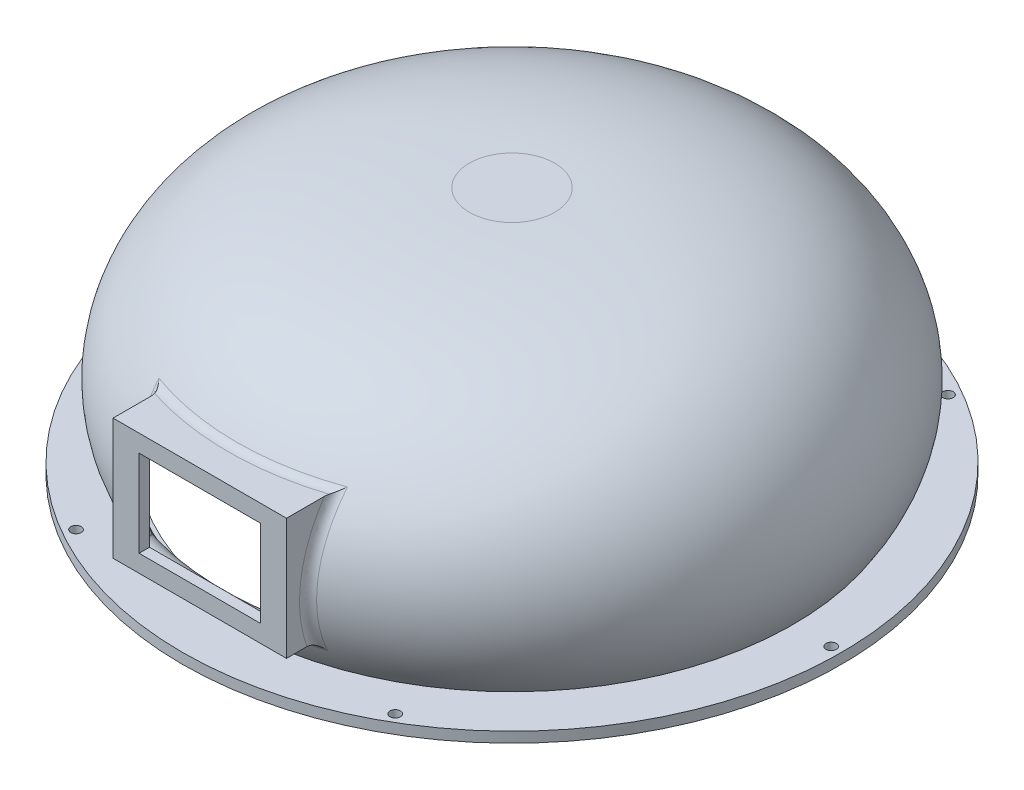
ISO-10303-21;
HEADER;
FILE_DESCRIPTION(('STEP AP214'),'2;1');
FILE_NAME('part.step','',(''),(''),'','','');
FILE_SCHEMA(('AUTOMOTIVE_DESIGN { 1 0 10303 214 1 1 1 1 }'));
ENDSEC;
DATA;
#1=APPLICATION_CONTEXT('core data for automotive mechanical design processes');
#2=APPLICATION_PROTOCOL_DEFINITION('international standard','automotive_design',2000,#1);
#3=PRODUCT_CONTEXT('',#1,'mechanical');
#4=PRODUCT('Part','Part','',(#3));
#5=PRODUCT_RELATED_PRODUCT_CATEGORY('part','',(#4));
#6=PRODUCT_DEFINITION_FORMATION('','',#4);
#7=PRODUCT_DEFINITION_CONTEXT('part definition',#1,'design');
#8=PRODUCT_DEFINITION('design','',#6,#7);
#9=PRODUCT_DEFINITION_SHAPE('','',#8);
#10=(LENGTH_UNIT() NAMED_UNIT(*) SI_UNIT(.MILLI.,.METRE.));
#11=(NAMED_UNIT(*) PLANE_ANGLE_UNIT() SI_UNIT($,.RADIAN.));
#12=(NAMED_UNIT(*) SI_UNIT($,.STERADIAN.) SOLID_ANGLE_UNIT());
#13=UNCERTAINTY_MEASURE_WITH_UNIT(LENGTH_MEASURE(1.E-05),#10,'distance_accuracy_value','');
#14=(GEOMETRIC_REPRESENTATION_CONTEXT(3) GLOBAL_UNCERTAINTY_ASSIGNED_CONTEXT((#13)) GLOBAL_UNIT_ASSIGNED_CONTEXT((#10,
#11,#12)) REPRESENTATION_CONTEXT('',''));
#15=CARTESIAN_POINT('',(0.,0.,0.));
#16=DIRECTION('',(0.,0.,1.));
#17=DIRECTION('',(1.,0.,0.));
#18=AXIS2_PLACEMENT_3D('',#15,#16,#17);
#19=CARTESIAN_POINT('',(22.,10.,-95.7131435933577));
#20=DIRECTION('',(1.,0.,0.));
#21=DIRECTION('',(0.,0.,-1.));
#22=AXIS2_PLACEMENT_3D('',#19,#20,#21);
#23=PLANE('',#22);
#24=DIRECTION('',(0.,1.,0.));
#25=VECTOR('',#24,1.);
#26=CARTESIAN_POINT('',(22.,13.,87.));
#27=LINE('',#26,#25);
#28=CARTESIAN_POINT('',(22.,13.,87.));
#29=VERTEX_POINT('',#28);
#30=CARTESIAN_POINT('',(22.,42.,87.));
#31=VERTEX_POINT('',#30);
#32=EDGE_CURVE('E202',#29,#31,#27,.T.);
#33=ORIENTED_EDGE('',*,*,#32,.T.);
#34=DIRECTION('',(0.,0.,1.));
#35=VECTOR('',#34,1.);
#36=CARTESIAN_POINT('',(22.,42.,-95.7131435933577));
#37=LINE('',#36,#35);
#38=CARTESIAN_POINT('',(22.,42.,80.930907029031));
#39=VERTEX_POINT('',#38);
#40=EDGE_CURVE('E316',#39,#31,#37,.T.);
#41=ORIENTED_EDGE('',*,*,#40,.F.);
#42=CARTESIAN_POINT('',(22.,2.68791630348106,80.62703957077));
#43=CARTESIAN_POINT('',(22.,5.01228502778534,76.7997871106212));
#44=CARTESIAN_POINT('',(26.2926717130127,5.67369510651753,75.7107243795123));
#45=CARTESIAN_POINT('',(22.,3.14500989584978,80.9046454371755));
#46=CARTESIAN_POINT('',(22.,5.41760516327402,77.0523473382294));
#47=CARTESIAN_POINT('',(26.2859345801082,6.06712473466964,75.9520037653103));
#48=CARTESIAN_POINT('',(22.,3.6073761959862,81.1734873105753));
#49=CARTESIAN_POINT('',(22.,5.82743286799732,77.2968324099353));
#50=CARTESIAN_POINT('',(26.2793347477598,6.4643753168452,76.1852471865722));
#51=CARTESIAN_POINT('',(22.,4.54231595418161,81.6928883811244));
#52=CARTESIAN_POINT('',(22.,6.65546346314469,77.7687817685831));
#53=CARTESIAN_POINT('',(26.2664606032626,7.26627969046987,76.6351679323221));
#54=CARTESIAN_POINT('',(22.,5.01489030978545,81.9434459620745));
#55=CARTESIAN_POINT('',(22.,7.07367806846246,77.9962689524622));
#56=CARTESIAN_POINT('',(26.260186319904,7.67093413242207,76.8518437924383));
#57=CARTESIAN_POINT('',(22.,6.44758402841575,82.6666343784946));
#58=CARTESIAN_POINT('',(22.,8.34015972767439,78.6521121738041));
#59=CARTESIAN_POINT('',(26.2419262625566,8.89578658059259,77.4763425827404));
#60=CARTESIAN_POINT('',(22.,7.42239730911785,83.110612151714));
#61=CARTESIAN_POINT('',(22.,9.20110319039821,79.0543589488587));
#62=CARTESIAN_POINT('',(26.2305074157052,9.72663558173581,77.8584902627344));
#63=CARTESIAN_POINT('',(22.,9.40624227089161,83.9161618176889));
#64=CARTESIAN_POINT('',(22.,10.9512779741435,79.7832739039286));
#65=CARTESIAN_POINT('',(26.2095709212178,11.4132939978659,78.550386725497));
#66=CARTESIAN_POINT('',(22.,10.4152970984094,84.2776766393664));
#67=CARTESIAN_POINT('',(22.,11.8407090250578,80.1100825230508));
#68=CARTESIAN_POINT('',(26.2000545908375,12.2691202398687,78.8600853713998));
#69=CARTESIAN_POINT('',(22.,12.4605061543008,84.9129533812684));
#70=CARTESIAN_POINT('',(22.,13.6422414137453,80.6838511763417));
#71=CARTESIAN_POINT('',(26.1832483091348,14.0008635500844,79.4035578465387));
#72=CARTESIAN_POINT('',(22.,13.4966542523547,85.186734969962));
#73=CARTESIAN_POINT('',(22.,14.5545706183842,80.9309968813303));
#74=CARTESIAN_POINT('',(26.175957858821,14.8767760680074,79.6373486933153));
#75=CARTESIAN_POINT('',(22.,15.5923878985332,85.6438271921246));
#76=CARTESIAN_POINT('',(22.,16.3994334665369,81.3433950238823));
#77=CARTESIAN_POINT('',(26.1637873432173,16.6470165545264,80.0274387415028));
#78=CARTESIAN_POINT('',(22.,16.6520404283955,85.8268311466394));
#79=CARTESIAN_POINT('',(22.,17.3323025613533,81.5084995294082));
#80=CARTESIAN_POINT('',(26.1589154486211,17.5413964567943,80.1834752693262));
#81=CARTESIAN_POINT('',(22.,18.7834983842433,86.0990203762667));
#82=CARTESIAN_POINT('',(22.,19.2090923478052,81.754013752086));
#83=CARTESIAN_POINT('',(26.1516997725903,19.340556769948,80.415579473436));
#84=CARTESIAN_POINT('',(22.,19.8553056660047,86.1881911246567));
#85=CARTESIAN_POINT('',(22.,20.15331250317,81.8344889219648));
#86=CARTESIAN_POINT('',(26.1493563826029,20.2453387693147,80.4916347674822));
#87=CARTESIAN_POINT('',(22.,22.0003509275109,86.2722634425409));
#88=CARTESIAN_POINT('',(22.,22.0440651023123,81.9103607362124));
#89=CARTESIAN_POINT('',(26.1471588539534,22.0576751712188,80.5633793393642));
#90=CARTESIAN_POINT('',(22.,23.0735812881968,86.2673608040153));
#91=CARTESIAN_POINT('',(22.,22.990885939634,81.9059578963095));
#92=CARTESIAN_POINT('',(26.1472995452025,22.9652198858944,80.5592355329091));
#93=CARTESIAN_POINT('',(22.,25.2152088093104,86.1650518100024));
#94=CARTESIAN_POINT('',(22.,24.8818589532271,81.8135198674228));
#95=CARTESIAN_POINT('',(26.1499138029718,24.7789418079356,80.4717407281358));
#96=CARTESIAN_POINT('',(22.,26.2836074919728,86.0676769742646));
#97=CARTESIAN_POINT('',(22.,25.8262924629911,81.7254855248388));
#98=CARTESIAN_POINT('',(26.1523865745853,25.6851193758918,80.3884167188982));
#99=CARTESIAN_POINT('',(22.,28.3986693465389,85.784369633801));
#100=CARTESIAN_POINT('',(22.,27.6978883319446,81.4690834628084));
#101=CARTESIAN_POINT('',(26.159422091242,27.4825727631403,80.1453579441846));
#102=CARTESIAN_POINT('',(22.,29.44544179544,85.5992494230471));
#103=CARTESIAN_POINT('',(22.,28.6253785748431,81.3013820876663));
#104=CARTESIAN_POINT('',(26.1639656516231,28.373909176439,79.9863239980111));
#105=CARTESIAN_POINT('',(22.,31.5200341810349,85.1444494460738));
#106=CARTESIAN_POINT('',(22.,30.4656491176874,80.8889430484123));
#107=CARTESIAN_POINT('',(26.1749024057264,30.1443963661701,79.5946032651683));
#108=CARTESIAN_POINT('',(22.,32.5478588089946,84.8747909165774));
#109=CARTESIAN_POINT('',(22.,31.3786413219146,80.6441219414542));
#110=CARTESIAN_POINT('',(26.181295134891,31.0235501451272,79.3619349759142));
#111=CARTESIAN_POINT('',(22.,34.9040018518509,84.1559362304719));
#112=CARTESIAN_POINT('',(22.,33.474251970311,79.9906711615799));
#113=CARTESIAN_POINT('',(26.1980075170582,33.0436775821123,78.7400622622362));
#114=CARTESIAN_POINT('',(22.,36.2232956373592,83.6769023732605));
#115=CARTESIAN_POINT('',(22.,34.6496560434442,79.5545619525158));
#116=CARTESIAN_POINT('',(26.208929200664,34.1784643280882,78.3245929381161));
#117=CARTESIAN_POINT('',(22.,38.8082389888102,82.5894463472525));
#118=CARTESIAN_POINT('',(22.,36.9557598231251,78.5631859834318));
#119=CARTESIAN_POINT('',(26.2331541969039,36.408803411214,77.3781521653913));
#120=CARTESIAN_POINT('',(22.,40.0738460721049,81.9809239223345));
#121=CARTESIAN_POINT('',(22.,38.0867084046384,78.0074885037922));
#122=CARTESIAN_POINT('',(26.246459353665,37.5043245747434,76.8470912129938));
#123=CARTESIAN_POINT('',(22.,42.5472433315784,80.6429172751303));
#124=CARTESIAN_POINT('',(22.,40.2993226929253,76.7840811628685));
#125=CARTESIAN_POINT('',(26.2752041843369,39.651476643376,75.6756707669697));
#126=CARTESIAN_POINT('',(22.,43.7547203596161,79.9128558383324));
#127=CARTESIAN_POINT('',(22.,41.3809116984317,76.1154690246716));
#128=CARTESIAN_POINT('',(26.2906539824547,40.7028666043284,75.0347892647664));
#129=CARTESIAN_POINT('',(22.,46.09736902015,78.3456279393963));
#130=CARTESIAN_POINT('',(22.,43.480773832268,74.6785635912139));
#131=CARTESIAN_POINT('',(26.32347335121,42.7478747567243,73.655068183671));
#132=CARTESIAN_POINT('',(22.,47.2325611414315,77.5084920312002));
#133=CARTESIAN_POINT('',(22.,44.4992011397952,73.9098999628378));
#134=CARTESIAN_POINT('',(26.3408423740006,43.7415093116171,72.9162565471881));
#135=CARTESIAN_POINT('',(22.,49.2904008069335,75.8468711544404));
#136=CARTESIAN_POINT('',(22.,46.3454909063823,72.3830099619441));
#137=CARTESIAN_POINT('',(26.3752416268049,45.5466090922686,71.4461443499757));
#138=CARTESIAN_POINT('',(22.,50.222031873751,75.0334519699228));
#139=CARTESIAN_POINT('',(22.,47.1817007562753,71.6345843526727));
#140=CARTESIAN_POINT('',(26.3920516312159,46.3654623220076,70.7250584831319));
#141=CARTESIAN_POINT('',(22.,52.0223598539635,73.3396890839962));
#142=CARTESIAN_POINT('',(22.,48.797228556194,70.0750957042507));
#143=CARTESIAN_POINT('',(26.4272235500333,47.9503734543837,69.220687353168));
#144=CARTESIAN_POINT('',(22.,52.8910543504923,72.4593428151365));
#145=CARTESIAN_POINT('',(22.,49.5765840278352,69.2637189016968));
#146=CARTESIAN_POINT('',(26.4455855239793,48.716429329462,68.4373997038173));
#147=CARTESIAN_POINT('',(22.,54.5554937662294,70.6466211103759));
#148=CARTESIAN_POINT('',(22.,51.0686791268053,67.5921110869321));
#149=CARTESIAN_POINT('',(26.4838298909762,50.1861293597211,66.8217969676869));
#150=CARTESIAN_POINT('',(22.,55.3518147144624,69.714773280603));
#151=CARTESIAN_POINT('',(22.,51.781984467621,66.7320224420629));
#152=CARTESIAN_POINT('',(26.5036974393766,50.8902645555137,65.9899754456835));
#153=CARTESIAN_POINT('',(22.,56.8779551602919,67.798647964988));
#154=CARTESIAN_POINT('',(22.,53.1471736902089,64.9627382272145));
#155=CARTESIAN_POINT('',(26.5452852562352,52.2411753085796,64.2769371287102));
#156=CARTESIAN_POINT('',(22.,57.6077988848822,66.8143897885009));
#157=CARTESIAN_POINT('',(22.,53.7990883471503,64.0531910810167));
#158=CARTESIAN_POINT('',(26.5670048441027,52.8879717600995,63.3957385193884));
#159=CARTESIAN_POINT('',(22.,58.3036566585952,65.8068704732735));
#160=CARTESIAN_POINT('',(22.,54.418344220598,63.1232151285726));
#161=CARTESIAN_POINT('',(26.5897538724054,53.5051364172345,62.4924460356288));
#162=(BOUNDED_SURFACE() B_SPLINE_SURFACE(3,2,((#42,#43,#44),(#45,#46,#47),(#48,#49,#50),(#51,
#52,#53),(#54,#55,#56),(#57,#58,#59),(#60,#61,#62),(#63,#64,#65),(#66,#67,#68),(#69,#70,#71),
(#72,#73,#74),(#75,#76,#77),(#78,#79,#80),(#81,#82,#83),(#84,#85,#86),(#87,#88,#89),(#90,#91,
#92),(#93,#94,#95),(#96,#97,#98),(#99,#100,#101),(#102,#103,#104),(#105,#106,#107),(#108,#109,
#110),(#111,#112,#113),(#114,#115,#116),(#117,#118,#119),(#120,#121,#122),(#123,#124,#125),
(#126,#127,#128),(#129,#130,#131),(#132,#133,#134),(#135,#136,#137),(#138,#139,#140),(#141,#142,
#143),(#144,#145,#146),(#147,#148,#149),(#150,#151,#152),(#153,#154,#155),(#156,#157,#158),
(#159,#160,#161)),.UNSPECIFIED.,.F.,.F.,.F.) B_SPLINE_SURFACE_WITH_KNOTS((4,2,2,2,2,2,2,2,2,2,2,
2,2,2,2,2,2,2,2,4),(3,3),(0.,1.60417377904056,3.20848918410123,6.41808959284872,
9.62990461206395,12.8409990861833,16.0628691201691,19.2852378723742,22.500900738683,
25.7154679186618,28.9008410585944,32.0854146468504,36.2884578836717,40.4947672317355,
44.7216550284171,48.9473393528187,52.6542094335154,56.3612217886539,60.0355259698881,
63.7084856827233),(0.,1.),
.UNSPECIFIED.) GEOMETRIC_REPRESENTATION_ITEM() RATIONAL_B_SPLINE_SURFACE(((1.,0.801422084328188,
1.),(1.,0.80177235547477,1.),(1.,0.802115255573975,1.),(1.,0.80278373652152,1.),(1.,
0.803109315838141,1.),(1.,0.8040563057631,1.),(1.,0.804647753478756,1.),(1.,0.805731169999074,
1.),(1.,0.80622306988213,1.),(1.,0.807091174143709,1.),(1.,0.807467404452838,1.),(1.,
0.808095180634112,1.),(1.,0.808346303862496,1.),(1.,0.80871815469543,1.),(1.,0.808838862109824,
1.),(1.,0.808952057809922,1.),(1.,0.808944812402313,1.),(1.,0.808810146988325,1.),(1.,
0.808682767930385,1.),(1.,0.808320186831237,1.),(1.,0.808085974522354,1.),(1.,0.807521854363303,
1.),(1.,0.807191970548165,1.),(1.,0.806328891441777,1.),(1.,0.805764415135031,1.),(1.,
0.804510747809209,1.),(1.,0.803821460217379,1.),(1.,0.802330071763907,1.),(1.,0.801527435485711,
1.),(1.,0.799819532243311,1.),(1.,0.798914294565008,1.),(1.,0.797118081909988,1.),(1.,
0.796239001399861,1.),(1.,0.794396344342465,1.),(1.,0.793432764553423,1.),(1.,0.791421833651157,
1.),(1.,0.790375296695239,1.),(1.,0.788179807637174,1.),(1.,0.78703089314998,1.),(1.,
0.785824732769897,1.))) REPRESENTATION_ITEM('') SURFACE());
#163=CARTESIAN_POINT('',(22.,2.68791630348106,80.62703957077));
#164=CARTESIAN_POINT('',(22.,3.14500989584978,80.9046454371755));
#165=CARTESIAN_POINT('',(22.,3.6073761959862,81.1734873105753));
#166=CARTESIAN_POINT('',(22.,4.54231595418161,81.6928883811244));
#167=CARTESIAN_POINT('',(22.,5.01489030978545,81.9434459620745));
#168=CARTESIAN_POINT('',(22.,6.44758402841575,82.6666343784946));
#169=CARTESIAN_POINT('',(22.,7.42239730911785,83.110612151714));
#170=CARTESIAN_POINT('',(22.,9.40624227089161,83.9161618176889));
#171=CARTESIAN_POINT('',(22.,10.4152970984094,84.2776766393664));
#172=CARTESIAN_POINT('',(22.,12.4605061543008,84.9129533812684));
#173=CARTESIAN_POINT('',(22.,13.4966542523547,85.186734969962));
#174=CARTESIAN_POINT('',(22.,15.5923878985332,85.6438271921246));
#175=CARTESIAN_POINT('',(22.,16.6520404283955,85.8268311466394));
#176=CARTESIAN_POINT('',(22.,18.7834983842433,86.0990203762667));
#177=CARTESIAN_POINT('',(22.,19.8553056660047,86.1881911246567));
#178=CARTESIAN_POINT('',(22.,22.0003509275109,86.2722634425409));
#179=CARTESIAN_POINT('',(22.,23.0735812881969,86.2673608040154));
#180=CARTESIAN_POINT('',(22.,25.2152088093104,86.1650518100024));
#181=CARTESIAN_POINT('',(22.,26.2836074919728,86.0676769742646));
#182=CARTESIAN_POINT('',(22.,28.3986693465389,85.784369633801));
#183=CARTESIAN_POINT('',(22.,29.44544179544,85.5992494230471));
#184=CARTESIAN_POINT('',(22.,31.5200341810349,85.1444494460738));
#185=CARTESIAN_POINT('',(22.,32.5478588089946,84.8747909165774));
#186=CARTESIAN_POINT('',(22.,34.9040018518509,84.1559362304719));
#187=CARTESIAN_POINT('',(22.,36.2232956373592,83.6769023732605));
#188=CARTESIAN_POINT('',(22.,38.8082389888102,82.5894463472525));
#189=CARTESIAN_POINT('',(22.,40.0738460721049,81.9809239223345));
#190=CARTESIAN_POINT('',(22.,42.5472433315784,80.6429172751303));
#191=CARTESIAN_POINT('',(22.,43.7547203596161,79.9128558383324));
#192=CARTESIAN_POINT('',(22.,46.09736902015,78.3456279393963));
#193=CARTESIAN_POINT('',(22.,47.2325611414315,77.5084920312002));
#194=CARTESIAN_POINT('',(22.,49.2904008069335,75.8468711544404));
#195=CARTESIAN_POINT('',(22.,50.222031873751,75.0334519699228));
#196=CARTESIAN_POINT('',(22.,52.0223598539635,73.3396890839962));
#197=CARTESIAN_POINT('',(22.,52.8910543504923,72.4593428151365));
#198=CARTESIAN_POINT('',(22.,54.5554937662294,70.6466211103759));
#199=CARTESIAN_POINT('',(22.,55.3518147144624,69.714773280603));
#200=CARTESIAN_POINT('',(22.,56.8779551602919,67.798647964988));
#201=CARTESIAN_POINT('',(22.,57.6077988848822,66.8143897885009));
#202=CARTESIAN_POINT('',(22.,58.3036566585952,65.8068704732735));
#203=B_SPLINE_CURVE_WITH_KNOTS('',3,(#163,#164,#165,#166,#167,#168,#169,#170,#171,#172,#173,
#174,#175,#176,#177,#178,#179,#180,#181,#182,#183,#184,#185,#186,#187,#188,#189,#190,#191,#192,
#193,#194,#195,#196,#197,#198,#199,#200,#201,#202),.UNSPECIFIED.,.F.,.F.,(4,2,2,2,2,2,2,2,2,2,2,
2,2,2,2,2,2,2,2,4),(0.,1.60417377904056,3.20848918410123,6.41808959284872,9.62990461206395,
12.8409990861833,16.0628691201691,19.2852378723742,22.500900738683,25.7154679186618,
28.9008410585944,32.0854146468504,36.2884578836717,40.4947672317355,44.7216550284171,
48.9473393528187,52.6542094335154,56.3612217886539,60.0355259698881,63.7084856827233),.UNSPECIFIED.);
#204=CARTESIAN_POINT('',(22.,13.,85.0435499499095));
#205=VERTEX_POINT('',#204);
#206=EDGE_CURVE('E319',#205,#39,#203,.T.);
#207=ORIENTED_EDGE('',*,*,#206,.F.);
#208=DIRECTION('',(0.,0.,1.));
#209=VECTOR('',#208,1.);
#210=CARTESIAN_POINT('',(22.,13.,-95.7131435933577));
#211=LINE('',#210,#209);
#212=EDGE_CURVE('E390',#205,#29,#211,.T.);
#213=ORIENTED_EDGE('',*,*,#212,.T.);
#214=EDGE_LOOP('',(#33,#41,#207,#213));
#215=FACE_BOUND('',#214,.T.);
#216=ADVANCED_FACE('F16',(#215),#23,.F.);
#217=CARTESIAN_POINT('',(-25.,13.,-95.7131435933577));
#218=DIRECTION('',(0.,-1.,0.));
#219=DIRECTION('',(0.,0.,-1.));
#220=AXIS2_PLACEMENT_3D('',#217,#218,#219);
#221=PLANE('',#220);
#222=DIRECTION('',(1.,0.,0.));
#223=VECTOR('',#222,1.);
#224=CARTESIAN_POINT('',(-22.,13.,87.));
#225=LINE('',#224,#223);
#226=CARTESIAN_POINT('',(9.40368424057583,13.,87.));
#227=VERTEX_POINT('',#226);
#228=EDGE_CURVE('E220',#227,#29,#225,.T.);
#229=ORIENTED_EDGE('',*,*,#228,.T.);
#230=ORIENTED_EDGE('',*,*,#212,.F.);
#231=CARTESIAN_POINT('',(22.0095433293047,13.,84.6936200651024));
#232=CARTESIAN_POINT('',(22.0063626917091,13.,84.751898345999));
#233=CARTESIAN_POINT('',(22.0039770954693,13.,84.810198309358));
#234=CARTESIAN_POINT('',(22.0007959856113,13.,84.9268416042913));
#235=CARTESIAN_POINT('',(22.0000004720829,13.,84.9851849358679));
#236=CARTESIAN_POINT('',(22.,13.,85.0435499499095));
#237=B_SPLINE_CURVE_WITH_KNOTS('',3,(#231,#232,#233,#234,#235,#236),.UNSPECIFIED.,.F.,.F.,(4,2,
4),(0.,0.175046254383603,0.350092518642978),.UNSPECIFIED.);
#238=CARTESIAN_POINT('',(22.0095433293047,13.,84.6936200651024));
#239=VERTEX_POINT('',#238);
#240=EDGE_CURVE('E327',#239,#205,#237,.T.);
#241=ORIENTED_EDGE('',*,*,#240,.F.);
#242=CARTESIAN_POINT('',(0.,13.,0.));
#243=DIRECTION('',(0.,-1.,0.));
#244=DIRECTION('',(0.,0.,-1.));
#245=AXIS2_PLACEMENT_3D('',#242,#243,#244);
#246=CIRCLE('',#245,87.50673846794);
#247=EDGE_CURVE('E413',#227,#239,#246,.F.);
#248=ORIENTED_EDGE('',*,*,#247,.F.);
#249=EDGE_LOOP('',(#229,#230,#241,#248));
#250=FACE_BOUND('',#249,.T.);
#251=ADVANCED_FACE('F369',(#250),#221,.F.);
#252=CARTESIAN_POINT('',(-22.,13.,87.));
#253=VERTEX_POINT('',#252);
#254=CARTESIAN_POINT('',(-9.40368424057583,13.,87.));
#255=VERTEX_POINT('',#254);
#256=EDGE_CURVE('E217',#253,#255,#225,.T.);
#257=ORIENTED_EDGE('',*,*,#256,.T.);
#258=CARTESIAN_POINT('',(-22.0095433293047,13.,84.6936200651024));
#259=VERTEX_POINT('',#258);
#260=EDGE_CURVE('E358',#259,#255,#246,.F.);
#261=ORIENTED_EDGE('',*,*,#260,.F.);
#262=CARTESIAN_POINT('',(-26.2954425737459,5.51254478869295,75.61131497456));
#263=CARTESIAN_POINT('',(-22.,4.84621126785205,76.695695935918));
#264=CARTESIAN_POINT('',(-22.,2.50073374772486,80.5126901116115));
#265=CARTESIAN_POINT('',(-26.2892493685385,5.87127504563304,75.8339041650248));
#266=CARTESIAN_POINT('',(-22.,5.21570246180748,76.9286462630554));
#267=CARTESIAN_POINT('',(-22.,2.91730723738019,80.7686704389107));
#268=CARTESIAN_POINT('',(-26.2831678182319,6.23322182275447,76.0498126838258));
#269=CARTESIAN_POINT('',(-22.,5.58898310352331,77.1548892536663));
#270=CARTESIAN_POINT('',(-22.,3.33831472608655,81.0173770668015));
#271=CARTESIAN_POINT('',(-26.2712671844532,6.96336076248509,76.4678812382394));
#272=CARTESIAN_POINT('',(-22.,6.34260677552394,77.5932679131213));
#273=CARTESIAN_POINT('',(-22.,4.1889385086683,81.4996561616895));
#274=CARTESIAN_POINT('',(-26.2654481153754,7.33155326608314,76.6700405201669));
#275=CARTESIAN_POINT('',(-22.,6.72295793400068,77.8054213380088));
#276=CARTESIAN_POINT('',(-22.,4.61855527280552,81.7332277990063));
#277=CARTESIAN_POINT('',(-26.248414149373,8.44713786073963,77.2563185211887));
#278=CARTESIAN_POINT('',(-22.,7.87587478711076,78.4208508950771));
#279=CARTESIAN_POINT('',(-22.,5.92217459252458,82.4115226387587));
#280=CARTESIAN_POINT('',(-26.2376559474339,9.20362180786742,77.6190458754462));
#281=CARTESIAN_POINT('',(-22.,8.65924156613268,78.8024139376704));
#282=CARTESIAN_POINT('',(-22.,6.80872170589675,82.8324540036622));
#283=CARTESIAN_POINT('',(-26.216875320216,10.7987103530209,78.3106381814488));
#284=CARTESIAN_POINT('',(-22.,10.3131579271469,79.5305323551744));
#285=CARTESIAN_POINT('',(-22.,8.68262181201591,83.6367159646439));
#286=CARTESIAN_POINT('',(-26.2069788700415,11.6390703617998,78.6345377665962));
#287=CARTESIAN_POINT('',(-22.,11.1859403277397,79.8721347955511));
#288=CARTESIAN_POINT('',(-22.,9.67239407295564,84.0144188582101));
#289=CARTESIAN_POINT('',(-26.1892886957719,13.3409302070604,79.2090032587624));
#290=CARTESIAN_POINT('',(-22.,12.9553811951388,80.478343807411));
#291=CARTESIAN_POINT('',(-22.,11.6805690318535,84.685351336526));
#292=CARTESIAN_POINT('',(-26.1814956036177,14.2024363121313,79.4595471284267));
#293=CARTESIAN_POINT('',(-22.,13.8522606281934,80.7430970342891));
#294=CARTESIAN_POINT('',(-22.,12.6989802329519,84.9785555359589));
#295=CARTESIAN_POINT('',(-26.1682451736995,15.941829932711,79.8847113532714));
#296=CARTESIAN_POINT('',(-22.,15.6642803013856,81.1924506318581));
#297=CARTESIAN_POINT('',(-22.,14.7572416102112,85.4765096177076));
#298=CARTESIAN_POINT('',(-26.1627878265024,16.8197173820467,80.0593320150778));
#299=CARTESIAN_POINT('',(-22.,16.5796761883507,81.3771863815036));
#300=CARTESIAN_POINT('',(-22.,15.7970916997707,85.6812598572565));
#301=CARTESIAN_POINT('',(-26.1543197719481,18.5868694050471,80.3311288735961));
#302=CARTESIAN_POINT('',(-22.,18.4227527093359,81.6646668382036));
#303=CARTESIAN_POINT('',(-22.,17.8905849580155,85.9999783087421));
#304=CARTESIAN_POINT('',(-26.1513090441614,19.4761338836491,80.4283057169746));
#305=CARTESIAN_POINT('',(-22.,19.3507143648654,81.767501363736));
#306=CARTESIAN_POINT('',(-22.,18.9442280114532,86.1139472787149));
#307=CARTESIAN_POINT('',(-26.147549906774,21.3488330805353,80.5503940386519));
#308=CARTESIAN_POINT('',(-22.,21.3045152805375,81.8966277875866));
#309=CARTESIAN_POINT('',(-22.,21.1616674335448,86.2570635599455));
#310=CARTESIAN_POINT('',(-26.1470537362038,22.3329103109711,80.56723846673));
#311=CARTESIAN_POINT('',(-22.,22.3313751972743,81.9144249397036));
#312=CARTESIAN_POINT('',(-22.,22.326084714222,86.2767430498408));
#313=CARTESIAN_POINT('',(-26.1488516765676,24.3012481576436,80.5073901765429));
#314=CARTESIAN_POINT('',(-22.,24.3839359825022,81.851181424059));
#315=CARTESIAN_POINT('',(-22.,24.6516353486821,86.206726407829));
#316=CARTESIAN_POINT('',(-26.1511460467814,25.285508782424,80.4306887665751));
#317=CARTESIAN_POINT('',(-22.,25.4100013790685,81.7701090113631));
#318=CARTESIAN_POINT('',(-22.,25.8127683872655,86.1170201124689));
#319=CARTESIAN_POINT('',(-26.1582717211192,27.2482090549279,80.1855112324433));
#320=CARTESIAN_POINT('',(-22.,27.4540362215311,81.5114186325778));
#321=CARTESIAN_POINT('',(-22.,28.1233370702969,85.831121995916));
#322=CARTESIAN_POINT('',(-26.1631063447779,28.2266393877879,80.0169150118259));
#323=CARTESIAN_POINT('',(-22.,28.4723196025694,81.3335885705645));
#324=CARTESIAN_POINT('',(-22.,29.2727553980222,85.6347908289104));
#325=CARTESIAN_POINT('',(-26.1750091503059,30.1693429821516,79.5909551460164));
#326=CARTESIAN_POINT('',(-22.,30.4916856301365,80.8850787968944));
#327=CARTESIAN_POINT('',(-22.,31.5493795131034,85.140191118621));
#328=CARTESIAN_POINT('',(-26.1820775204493,31.1336150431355,79.3335840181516));
#329=CARTESIAN_POINT('',(-22.,31.4930426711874,80.6142564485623));
#330=CARTESIAN_POINT('',(-22.,32.6765834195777,84.8419139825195));
#331=CARTESIAN_POINT('',(-26.1998127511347,33.2393038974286,78.6717923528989));
#332=CARTESIAN_POINT('',(-22.,33.6769598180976,79.9190035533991));
#333=CARTESIAN_POINT('',(-22.,35.1316560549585,84.0771706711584));
#334=CARTESIAN_POINT('',(-26.2109218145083,34.3760092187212,78.24794934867));
#335=CARTESIAN_POINT('',(-22.,34.8541316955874,79.4741840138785));
#336=CARTESIAN_POINT('',(-22.,36.4526881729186,83.5886577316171));
#337=CARTESIAN_POINT('',(-26.2355108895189,36.6089169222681,77.284637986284));
#338=CARTESIAN_POINT('',(-22.,37.1624381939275,78.4653177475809));
#339=CARTESIAN_POINT('',(-22.,39.0396412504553,82.4822157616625));
#340=CARTESIAN_POINT('',(-26.2489917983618,37.7051037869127,76.745125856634));
#341=CARTESIAN_POINT('',(-22.,38.2938372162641,77.9008817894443));
#342=CARTESIAN_POINT('',(-22.,40.3055411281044,81.8642377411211));
#343=CARTESIAN_POINT('',(-26.2780102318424,39.8470699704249,75.559823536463));
#344=CARTESIAN_POINT('',(-22.,40.5006183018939,76.6632065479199));
#345=CARTESIAN_POINT('',(-22.,42.7720618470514,80.5108614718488));
#346=CARTESIAN_POINT('',(-26.2935469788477,40.8928681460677,74.914073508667));
#347=CARTESIAN_POINT('',(-22.,41.5762179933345,75.9896348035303));
#348=CARTESIAN_POINT('',(-22.,43.9727071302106,79.7755075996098));
#349=CARTESIAN_POINT('',(-26.3265239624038,42.9262968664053,73.5257345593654));
#350=CARTESIAN_POINT('',(-22.,43.663729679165,74.5439889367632));
#351=CARTESIAN_POINT('',(-22.,46.3013615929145,78.1989896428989));
#352=CARTESIAN_POINT('',(-26.3439630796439,43.9139610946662,72.7832025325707));
#353=CARTESIAN_POINT('',(-22.,44.6758116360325,73.7715744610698));
#354=CARTESIAN_POINT('',(-22.,47.4294128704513,77.3578877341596));
#355=CARTESIAN_POINT('',(-26.3722394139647,45.383129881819,71.5742251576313));
#356=CARTESIAN_POINT('',(-22.,46.1775506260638,72.5165960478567));
#357=CARTESIAN_POINT('',(-22.,49.1038578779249,75.9917861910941));
#358=CARTESIAN_POINT('',(-26.3824014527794,45.8875417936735,71.1388452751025));
#359=CARTESIAN_POINT('',(-22.,46.6928841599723,72.0646521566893));
#360=CARTESIAN_POINT('',(-22.,49.6780572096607,75.5004199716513));
#361=CARTESIAN_POINT('',(-26.4032617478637,46.8754415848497,70.2455701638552));
#362=CARTESIAN_POINT('',(-22.,47.7010643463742,71.1380551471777));
#363=CARTESIAN_POINT('',(-22.,50.8014595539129,74.4934758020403));
#364=CARTESIAN_POINT('',(-26.4139581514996,47.3589922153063,69.7877528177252));
#365=CARTESIAN_POINT('',(-22.,48.1939915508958,70.6634097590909));
#366=CARTESIAN_POINT('',(-22.,51.3507378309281,73.977981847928));
#367=CARTESIAN_POINT('',(-26.4249482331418,47.8326109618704,69.3186695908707));
#368=CARTESIAN_POINT('',(-22.,48.6758818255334,70.1777624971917));
#369=CARTESIAN_POINT('',(-22.,51.8882366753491,73.4503898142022));
#370=(BOUNDED_SURFACE() B_SPLINE_SURFACE(3,2,((#262,#263,#264),(#265,#266,#267),(#268,#269,
#270),(#271,#272,#273),(#274,#275,#276),(#277,#278,#279),(#280,#281,#282),(#283,#284,#285),
(#286,#287,#288),(#289,#290,#291),(#292,#293,#294),(#295,#296,#297),(#298,#299,#300),(#301,#302,
#303),(#304,#305,#306),(#307,#308,#309),(#310,#311,#312),(#313,#314,#315),(#316,#317,#318),
(#319,#320,#321),(#322,#323,#324),(#325,#326,#327),(#328,#329,#330),(#331,#332,#333),(#334,#335,
#336),(#337,#338,#339),(#340,#341,#342),(#343,#344,#345),(#346,#347,#348),(#349,#350,#351),
(#352,#353,#354),(#355,#356,#357),(#358,#359,#360),(#361,#362,#363),(#364,#365,#366),(#367,#368,
#369)),.UNSPECIFIED.,.F.,.F.,.F.) B_SPLINE_SURFACE_WITH_KNOTS((4,2,2,2,2,2,2,2,2,2,2,2,2,2,2,2,
2,4),(3,3),(0.,1.46666843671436,2.93341720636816,5.87473645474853,9.04927241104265,
12.2247610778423,15.400236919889,18.5756862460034,22.0641284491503,25.5528948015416,
29.0462315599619,32.5398628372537,36.7576553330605,40.9770467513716,45.1948466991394,
49.4101782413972,51.6767062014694,53.9358581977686),(0.,1.),
.UNSPECIFIED.) GEOMETRIC_REPRESENTATION_ITEM() RATIONAL_B_SPLINE_SURFACE(((1.,0.801278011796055,
1.),(1.,0.801600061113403,1.),(1.,0.801916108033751,1.),(1.,0.802534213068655,1.),(1.,
0.802836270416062,1.),(1.,0.803719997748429,1.),(1.,0.804277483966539,1.),(1.,0.80535336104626,
1.),(1.,0.805865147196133,1.),(1.,0.806779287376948,1.),(1.,0.807181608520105,1.),(1.,
0.807865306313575,1.),(1.,0.808146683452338,1.),(1.,0.808583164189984,1.),(1.,0.808738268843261,
1.),(1.,0.808931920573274,1.),(1.,0.808957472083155,1.),(1.,0.80886485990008,1.),(1.,
0.808746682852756,1.),(1.,0.808379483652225,1.),(1.,0.808130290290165,1.),(1.,0.80751635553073,
1.),(1.,0.807151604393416,1.),(1.,0.806235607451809,1.),(1.,0.805661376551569,1.),(1.,
0.804388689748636,1.),(1.,0.803690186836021,1.),(1.,0.802184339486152,1.),(1.,0.80137703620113,
1.),(1.,0.799660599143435,1.),(1.,0.798751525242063,1.),(1.,0.797274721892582,1.),(1.,
0.796743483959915,1.),(1.,0.795651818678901,1.),(1.,0.795091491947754,1.),(1.,0.794515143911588,1.))) REPRESENTATION_ITEM('') SURFACE());
#371=CARTESIAN_POINT('',(-22.,13.,85.0435499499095));
#372=CARTESIAN_POINT('',(-22.000000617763,13.,84.9851849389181));
#373=CARTESIAN_POINT('',(-22.0007962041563,13.,84.9268416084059));
#374=CARTESIAN_POINT('',(-22.0039773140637,13.,84.810198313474));
#375=CARTESIAN_POINT('',(-22.0063628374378,13.,84.7518983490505));
#376=CARTESIAN_POINT('',(-22.0095433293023,13.,84.6936200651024));
#377=B_SPLINE_CURVE_WITH_KNOTS('',3,(#371,#372,#373,#374,#375,#376),.UNSPECIFIED.,.F.,.F.,(4,2,
4),(0.,0.175046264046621,0.350092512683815),.UNSPECIFIED.);
#378=CARTESIAN_POINT('',(-22.,13.,85.0435499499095));
#379=VERTEX_POINT('',#378);
#380=EDGE_CURVE('E356',#379,#259,#377,.T.);
#381=ORIENTED_EDGE('',*,*,#380,.F.);
#382=DIRECTION('',(0.,0.,1.));
#383=VECTOR('',#382,1.);
#384=CARTESIAN_POINT('',(-22.,13.,-95.7131435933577));
#385=LINE('',#384,#383);
#386=EDGE_CURVE('E382',#379,#253,#385,.T.);
#387=ORIENTED_EDGE('',*,*,#386,.T.);
#388=EDGE_LOOP('',(#257,#261,#381,#387));
#389=FACE_BOUND('',#388,.T.);
#390=ADVANCED_FACE('F375',(#389),#221,.F.);
#391=CARTESIAN_POINT('',(-22.,10.,-95.7131435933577));
#392=DIRECTION('',(-1.,0.,0.));
#393=DIRECTION('',(0.,0.,1.));
#394=AXIS2_PLACEMENT_3D('',#391,#392,#393);
#395=PLANE('',#394);
#396=DIRECTION('',(0.,-1.,0.));
#397=VECTOR('',#396,1.);
#398=CARTESIAN_POINT('',(-22.,42.,87.));
#399=LINE('',#398,#397);
#400=CARTESIAN_POINT('',(-22.,42.,87.));
#401=VERTEX_POINT('',#400);
#402=EDGE_CURVE('E212',#401,#253,#399,.T.);
#403=ORIENTED_EDGE('',*,*,#402,.T.);
#404=ORIENTED_EDGE('',*,*,#386,.F.);
#405=CARTESIAN_POINT('',(-22.,51.8882366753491,73.4503898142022));
#406=CARTESIAN_POINT('',(-22.,51.3507378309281,73.977981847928));
#407=CARTESIAN_POINT('',(-22.,50.8014595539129,74.4934758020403));
#408=CARTESIAN_POINT('',(-22.,49.6780572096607,75.5004199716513));
#409=CARTESIAN_POINT('',(-22.,49.1038578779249,75.9917861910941));
#410=CARTESIAN_POINT('',(-22.,47.4294128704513,77.3578877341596));
#411=CARTESIAN_POINT('',(-22.,46.3013615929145,78.1989896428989));
#412=CARTESIAN_POINT('',(-22.,43.9727071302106,79.7755075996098));
#413=CARTESIAN_POINT('',(-22.,42.7720618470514,80.5108614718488));
#414=CARTESIAN_POINT('',(-22.,40.3055411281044,81.8642377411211));
#415=CARTESIAN_POINT('',(-22.,39.0396412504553,82.4822157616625));
#416=CARTESIAN_POINT('',(-22.,36.4526881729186,83.5886577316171));
#417=CARTESIAN_POINT('',(-22.,35.1316560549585,84.0771706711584));
#418=CARTESIAN_POINT('',(-22.,32.6765834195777,84.8419139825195));
#419=CARTESIAN_POINT('',(-22.,31.5493795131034,85.140191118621));
#420=CARTESIAN_POINT('',(-22.,29.2727553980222,85.6347908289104));
#421=CARTESIAN_POINT('',(-22.,28.1233370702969,85.831121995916));
#422=CARTESIAN_POINT('',(-22.,25.8127683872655,86.1170201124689));
#423=CARTESIAN_POINT('',(-22.,24.6516353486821,86.206726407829));
#424=CARTESIAN_POINT('',(-22.,22.326084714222,86.2767430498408));
#425=CARTESIAN_POINT('',(-22.,21.1616674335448,86.2570635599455));
#426=CARTESIAN_POINT('',(-22.,18.9442280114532,86.1139472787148));
#427=CARTESIAN_POINT('',(-22.,17.8905849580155,85.9999783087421));
#428=CARTESIAN_POINT('',(-22.,15.7970916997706,85.6812598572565));
#429=CARTESIAN_POINT('',(-22.,14.7572416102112,85.4765096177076));
#430=CARTESIAN_POINT('',(-22.,12.6989802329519,84.9785555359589));
#431=CARTESIAN_POINT('',(-22.,11.6805690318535,84.685351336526));
#432=CARTESIAN_POINT('',(-22.,9.67239407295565,84.0144188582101));
#433=CARTESIAN_POINT('',(-22.,8.68262181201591,83.6367159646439));
#434=CARTESIAN_POINT('',(-22.,6.80872170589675,82.8324540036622));
#435=CARTESIAN_POINT('',(-22.,5.92217459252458,82.4115226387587));
#436=CARTESIAN_POINT('',(-22.,4.61855527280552,81.7332277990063));
#437=CARTESIAN_POINT('',(-22.,4.1889385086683,81.4996561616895));
#438=CARTESIAN_POINT('',(-22.,3.33831472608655,81.0173770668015));
#439=CARTESIAN_POINT('',(-22.,2.9173072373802,80.7686704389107));
#440=CARTESIAN_POINT('',(-22.,2.50073374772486,80.5126901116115));
#441=B_SPLINE_CURVE_WITH_KNOTS('',3,(#405,#406,#407,#408,#409,#410,#411,#412,#413,#414,#415,
#416,#417,#418,#419,#420,#421,#422,#423,#424,#425,#426,#427,#428,#429,#430,#431,#432,#433,#434,
#435,#436,#437,#438,#439,#440),.UNSPECIFIED.,.F.,.F.,(4,2,2,2,2,2,2,2,2,2,2,2,2,2,2,2,2,4),(0.,
2.25915199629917,4.52567995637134,8.74101149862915,12.9588114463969,17.1782028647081,
21.3959953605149,24.8896266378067,28.382963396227,31.8717297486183,35.3601719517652,
38.5356212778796,41.7110971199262,44.8865857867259,48.0611217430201,51.0024409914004,
52.4691897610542,53.9358581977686),.UNSPECIFIED.);
#442=CARTESIAN_POINT('',(-22.,42.,80.9309070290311));
#443=VERTEX_POINT('',#442);
#444=EDGE_CURVE('E317',#443,#379,#441,.T.);
#445=ORIENTED_EDGE('',*,*,#444,.F.);
#446=DIRECTION('',(0.,0.,1.));
#447=VECTOR('',#446,1.);
#448=CARTESIAN_POINT('',(-22.,42.,-95.7131435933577));
#449=LINE('',#448,#447);
#450=EDGE_CURVE('E387',#443,#401,#449,.T.);
#451=ORIENTED_EDGE('',*,*,#450,.T.);
#452=EDGE_LOOP('',(#403,#404,#445,#451));
#453=FACE_BOUND('',#452,.T.);
#454=ADVANCED_FACE('F372',(#453),#395,.F.);
#455=CARTESIAN_POINT('',(-25.,42.,-95.7131435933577));
#456=DIRECTION('',(0.,1.,0.));
#457=DIRECTION('',(0.,0.,1.));
#458=AXIS2_PLACEMENT_3D('',#455,#456,#457);
#459=PLANE('',#458);
#460=DIRECTION('',(-1.,0.,0.));
#461=VECTOR('',#460,1.);
#462=CARTESIAN_POINT('',(22.,42.,87.));
#463=LINE('',#462,#461);
#464=EDGE_CURVE('E211',#31,#401,#463,.T.);
#465=ORIENTED_EDGE('',*,*,#464,.T.);
#466=ORIENTED_EDGE('',*,*,#450,.F.);
#467=CARTESIAN_POINT('',(-22.3110405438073,42.,78.7257485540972));
#468=CARTESIAN_POINT('',(-22.2594487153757,42.,78.9051145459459));
#469=CARTESIAN_POINT('',(-22.2141823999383,42.,79.0862941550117));
#470=CARTESIAN_POINT('',(-22.1366278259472,42.,79.4504898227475));
#471=CARTESIAN_POINT('',(-22.1042775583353,42.,79.6334926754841));
#472=CARTESIAN_POINT('',(-22.0523762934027,42.,80.001318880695));
#473=CARTESIAN_POINT('',(-22.0328262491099,42.,80.1861423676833));
#474=CARTESIAN_POINT('',(-22.0066062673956,42.,80.5576074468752));
#475=CARTESIAN_POINT('',(-21.9999997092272,42.,80.744253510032));
#476=CARTESIAN_POINT('',(-22.,42.,80.9309070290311));
#477=B_SPLINE_CURVE_WITH_KNOTS('',3,(#467,#468,#469,#470,#471,#472,#473,#474,#475,#476),
.UNSPECIFIED.,.F.,.F.,(4,2,2,2,4),(0.,0.55979116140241,1.11686152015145,1.67397335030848,
2.23380639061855),.UNSPECIFIED.);
#478=CARTESIAN_POINT('',(-22.3110405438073,42.,78.7257485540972));
#479=VERTEX_POINT('',#478);
#480=EDGE_CURVE('E328',#479,#443,#477,.T.);
#481=ORIENTED_EDGE('',*,*,#480,.F.);
#482=CARTESIAN_POINT('',(0.,42.,0.));
#483=DIRECTION('',(0.,-1.,0.));
#484=DIRECTION('',(0.,0.,-1.));
#485=AXIS2_PLACEMENT_3D('',#482,#483,#484);
#486=CIRCLE('',#485,81.8261939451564);
#487=CARTESIAN_POINT('',(22.3110405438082,41.9999999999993,78.7257485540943));
#488=VERTEX_POINT('',#487);
#489=EDGE_CURVE('E320',#488,#479,#486,.T.);
#490=ORIENTED_EDGE('',*,*,#489,.F.);
#491=CARTESIAN_POINT('',(22.,42.,80.930907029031));
#492=CARTESIAN_POINT('',(21.999999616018,42.,80.7442534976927));
#493=CARTESIAN_POINT('',(22.0066061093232,42.,80.5576074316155));
#494=CARTESIAN_POINT('',(22.0328259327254,42.,80.1861423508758));
#495=CARTESIAN_POINT('',(22.0523758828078,42.,80.0013188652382));
#496=CARTESIAN_POINT('',(22.1042768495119,42.,79.6334926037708));
#497=CARTESIAN_POINT('',(22.1366269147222,42.,79.4504896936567));
#498=CARTESIAN_POINT('',(22.2141814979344,42.,79.0862939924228));
#499=CARTESIAN_POINT('',(22.2594480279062,42.,78.9051144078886));
#500=CARTESIAN_POINT('',(22.3110405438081,42.,78.7257485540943));
#501=B_SPLINE_CURVE_WITH_KNOTS('',3,(#491,#492,#493,#494,#495,#496,#497,#498,#499,#500),
.UNSPECIFIED.,.F.,.F.,(4,2,2,2,4),(0.,0.559833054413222,1.11694485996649,1.67401526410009,
2.23380651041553),.UNSPECIFIED.);
#502=EDGE_CURVE('E321',#39,#488,#501,.T.);
#503=ORIENTED_EDGE('',*,*,#502,.F.);
#504=ORIENTED_EDGE('',*,*,#40,.T.);
#505=EDGE_LOOP('',(#465,#466,#481,#490,#503,#504));
#506=FACE_BOUND('',#505,.T.);
#507=ADVANCED_FACE('F296',(#506),#459,.F.);
#508=CARTESIAN_POINT('',(0.,70.,0.));
#509=CARTESIAN_POINT('',(12.2857541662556,70.,0.));
#510=CARTESIAN_POINT('',(76.2937587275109,72.3823843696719,0.));
#511=CARTESIAN_POINT('',(95.7121435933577,21.0855239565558,0.));
#512=CARTESIAN_POINT('',(80.,0.,0.));
#513=B_SPLINE_CURVE_WITH_KNOTS('',3,(#508,#509,#510,#511,#512),.UNSPECIFIED.,.F.,.F.,(4,1,4),
(0.,0.489357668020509,1.),.UNSPECIFIED.);
#514=CARTESIAN_POINT('',(0.,0.,0.));
#515=DIRECTION('',(0.,-1.,0.));
#516=AXIS1_PLACEMENT('',#514,#515);
#517=SURFACE_OF_REVOLUTION('',#513,#516);
#518=CARTESIAN_POINT('',(0.,70.0000000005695,0.));
#519=DIRECTION('',(0.,-1.,0.));
#520=DIRECTION('',(0.,0.,-1.));
#521=AXIS2_PLACEMENT_3D('',#518,#519,#520);
#522=CIRCLE('',#521,12.2870392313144);
#523=CARTESIAN_POINT('',(0.,70.0000000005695,-12.2870392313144));
#524=VERTEX_POINT('',#523);
#525=EDGE_CURVE('E548',#524,#524,#522,.T.);
#526=ORIENTED_EDGE('',*,*,#525,.T.);
#527=EDGE_LOOP('',(#526));
#528=FACE_BOUND('',#527,.T.);
#529=CARTESIAN_POINT('',(25.,2.68791630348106,80.62703957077));
#530=CARTESIAN_POINT('',(25.,3.85010067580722,78.7134133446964));
#531=CARTESIAN_POINT('',(27.1463358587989,4.18080571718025,78.1688819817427));
#532=CARTESIAN_POINT('',(25.,3.14500989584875,80.9046454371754));
#533=CARTESIAN_POINT('',(25.,4.28120618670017,78.9784351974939));
#534=CARTESIAN_POINT('',(27.1429672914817,4.6060673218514,78.4283246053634));
#535=CARTESIAN_POINT('',(25.,3.60737619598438,81.1734873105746));
#536=CARTESIAN_POINT('',(25.,4.71730689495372,79.2351056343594));
#537=CARTESIAN_POINT('',(27.1396673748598,5.03587576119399,78.6793672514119));
#538=CARTESIAN_POINT('',(25.,4.54231595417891,81.6928883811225));
#539=CARTESIAN_POINT('',(25.,5.59879263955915,79.7307811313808));
#540=CARTESIAN_POINT('',(27.1332303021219,5.90429782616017,79.1640281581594));
#541=CARTESIAN_POINT('',(25.,5.01489030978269,81.9434459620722));
#542=CARTESIAN_POINT('',(25.,6.04418987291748,79.9698100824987));
#543=CARTESIAN_POINT('',(27.130093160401,6.34291222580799,79.3976448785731));
#544=CARTESIAN_POINT('',(25.,6.44758402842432,82.6666343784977));
#545=CARTESIAN_POINT('',(25.,7.393497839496,80.6591840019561));
#546=CARTESIAN_POINT('',(27.1209631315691,7.67168530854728,80.0714884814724));
#547=CARTESIAN_POINT('',(25.,7.42239730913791,83.1106121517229));
#548=CARTESIAN_POINT('',(25.,8.31141709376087,81.0823505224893));
#549=CARTESIAN_POINT('',(27.1152537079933,8.57451644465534,80.484551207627));
#550=CARTESIAN_POINT('',(25.,9.40624227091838,83.9161618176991));
#551=CARTESIAN_POINT('',(25.,10.1784259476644,81.8495819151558));
#552=CARTESIAN_POINT('',(27.104785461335,10.4097681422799,81.2332742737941));
#553=CARTESIAN_POINT('',(25.,10.4152970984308,84.2776766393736));
#554=CARTESIAN_POINT('',(25.,11.1277279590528,82.1937943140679));
#555=CARTESIAN_POINT('',(27.1000272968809,11.3422086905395,81.568881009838));
#556=CARTESIAN_POINT('',(25.,12.4605061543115,84.9129533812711));
#557=CARTESIAN_POINT('',(25.,13.0510986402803,82.7983166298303));
#558=CARTESIAN_POINT('',(27.091624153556,13.230684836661,82.1582556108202));
#559=CARTESIAN_POINT('',(25.,13.4966542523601,85.1867349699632));
#560=CARTESIAN_POINT('',(25.0000000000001,14.0254098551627,83.0588218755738));
#561=CARTESIAN_POINT('',(27.0879789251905,14.1867150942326,82.4120418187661));
#562=CARTESIAN_POINT('',(25.,15.5923878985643,85.6438271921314));
#563=CARTESIAN_POINT('',(25.0000000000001,15.9957059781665,83.493566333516));
#564=CARTESIAN_POINT('',(27.0818936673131,16.1197021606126,82.8356329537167));
#565=CARTESIAN_POINT('',(25.,16.6520404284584,85.8268311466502));
#566=CARTESIAN_POINT('',(25.,16.9920493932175,83.667649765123));
#567=CARTESIAN_POINT('',(27.0794577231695,17.0967184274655,83.0051532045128));
#568=CARTESIAN_POINT('',(25.,18.7834983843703,86.0990203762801));
#569=CARTESIAN_POINT('',(25.,18.9961724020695,83.9265013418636));
#570=CARTESIAN_POINT('',(27.0758498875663,19.0620275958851,83.2572999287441));
#571=CARTESIAN_POINT('',(25.,19.8553056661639,86.1881911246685));
#572=CARTESIAN_POINT('',(25.,20.0042718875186,84.011338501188));
#573=CARTESIAN_POINT('',(27.0746781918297,20.0503222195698,83.3399129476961));
#574=CARTESIAN_POINT('',(25.,22.0003509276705,86.2722634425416));
#575=CARTESIAN_POINT('',(25.,22.0221701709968,84.0913106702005));
#576=CARTESIAN_POINT('',(27.073579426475,22.0290130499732,83.4178213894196));
#577=CARTESIAN_POINT('',(25.,23.0735812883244,86.2673608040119));
#578=CARTESIAN_POINT('',(25.,23.0322784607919,84.0866570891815));
#579=CARTESIAN_POINT('',(27.0736497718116,23.0194006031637,83.4132981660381));
#580=CARTESIAN_POINT('',(25.,25.215208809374,86.1650518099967));
#581=CARTESIAN_POINT('',(25.,25.0485781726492,83.9892838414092));
#582=CARTESIAN_POINT('',(27.0749569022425,24.9970752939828,83.3183962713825));
#583=CARTESIAN_POINT('',(25.,26.2836074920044,86.0676769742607));
#584=CARTESIAN_POINT('',(25.,26.0550697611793,83.8965650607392));
#585=CARTESIAN_POINT('',(27.0761932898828,25.9843633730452,83.2280468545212));
#586=CARTESIAN_POINT('',(25.,28.3986693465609,85.7843696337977));
#587=CARTESIAN_POINT('',(25.,28.0483960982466,83.6267109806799));
#588=CARTESIAN_POINT('',(27.0797110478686,27.9406209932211,82.9648637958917));
#589=CARTESIAN_POINT('',(25.,29.4454417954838,85.599249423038));
#590=CARTESIAN_POINT('',(25.,29.0355909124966,83.4502758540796));
#591=CARTESIAN_POINT('',(27.0819828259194,28.9096754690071,82.7927867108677));
#592=CARTESIAN_POINT('',(25.,31.5200341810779,85.1444494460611));
#593=CARTESIAN_POINT('',(25.,30.993023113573,83.0166567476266));
#594=CARTESIAN_POINT('',(27.0874512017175,30.832215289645,82.3695263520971));
#595=CARTESIAN_POINT('',(25.,32.547858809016,84.8747909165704));
#596=CARTESIAN_POINT('',(25.,31.9634853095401,82.7593851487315));
#597=CARTESIAN_POINT('',(27.0906475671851,31.7857044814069,82.1183629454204));
#598=CARTESIAN_POINT('',(25.,34.9040018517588,84.1559362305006));
#599=CARTESIAN_POINT('',(25.,34.1895335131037,82.0731789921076));
#600=CARTESIAN_POINT('',(27.0990037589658,33.9738397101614,81.4479992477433));
#601=CARTESIAN_POINT('',(25.,36.2232956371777,83.6769023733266));
#602=CARTESIAN_POINT('',(25.,35.4369770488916,81.615520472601));
#603=CARTESIAN_POINT('',(27.1044646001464,35.2008799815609,81.0007476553));
#604=CARTESIAN_POINT('',(25.,38.808238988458,82.5894463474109));
#605=CARTESIAN_POINT('',(25.,37.882504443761,80.5761045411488));
#606=CARTESIAN_POINT('',(27.1165770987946,37.6085211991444,79.983799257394));
#607=CARTESIAN_POINT('',(25.,40.0738460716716,81.9809239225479));
#608=CARTESIAN_POINT('',(25.,39.0808476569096,79.9938974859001));
#609=CARTESIAN_POINT('',(27.1232296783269,38.7890853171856,79.414007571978));
#610=CARTESIAN_POINT('',(25.,42.5472433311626,80.6429172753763));
#611=CARTESIAN_POINT('',(25.,41.4238609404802,78.7131867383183));
#612=CARTESIAN_POINT('',(27.1376020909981,41.0993599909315,78.1592940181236));
#613=CARTESIAN_POINT('',(25.,43.75472035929,79.9128558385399));
#614=CARTESIAN_POINT('',(25.,42.5684397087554,78.0137450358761));
#615=CARTESIAN_POINT('',(27.1453269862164,42.2287935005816,77.4738225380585));
#616=CARTESIAN_POINT('',(25.,46.0973690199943,78.3456279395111));
#617=CARTESIAN_POINT('',(25.,44.7896970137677,76.5116774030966));
#618=CARTESIAN_POINT('',(27.1617366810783,44.4226218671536,76.0003480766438));
#619=CARTESIAN_POINT('',(25.,47.2325611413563,77.5084920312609));
#620=CARTESIAN_POINT('',(25.,45.8665369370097,75.7086662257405));
#621=CARTESIAN_POINT('',(27.1704212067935,45.4870351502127,75.2123743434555));
#622=CARTESIAN_POINT('',(25.,49.2904008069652,75.8468711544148));
#623=CARTESIAN_POINT('',(25.,47.818452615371,74.1145315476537));
#624=CARTESIAN_POINT('',(27.1876208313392,47.4185048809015,73.6465078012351));
#625=CARTESIAN_POINT('',(25.,50.2220318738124,75.0334519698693));
#626=CARTESIAN_POINT('',(25.,48.7023870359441,73.3335279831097));
#627=CARTESIAN_POINT('',(27.1960258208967,48.2937470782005,72.8792552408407));
#628=CARTESIAN_POINT('',(25.,52.0223598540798,73.3396890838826));
#629=CARTESIAN_POINT('',(25.,50.4103162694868,71.7069015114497));
#630=CARTESIAN_POINT('',(27.2136117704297,49.9863666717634,71.2801882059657));
#631=CARTESIAN_POINT('',(25.,52.8910543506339,72.4593428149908));
#632=CARTESIAN_POINT('',(25.,51.2343512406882,70.860953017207));
#633=CARTESIAN_POINT('',(27.2227927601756,50.8037418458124,70.448371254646));
#634=CARTESIAN_POINT('',(25.,54.5554937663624,70.6466211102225));
#635=CARTESIAN_POINT('',(25.,52.8126103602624,69.1187939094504));
#636=CARTESIAN_POINT('',(27.2419149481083,52.3708115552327,68.7342090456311));
#637=CARTESIAN_POINT('',(25.,55.3518147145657,69.7147732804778));
#638=CARTESIAN_POINT('',(25.,53.5674287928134,68.2227275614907));
#639=CARTESIAN_POINT('',(27.2518487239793,53.1210396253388,67.8523743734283));
#640=CARTESIAN_POINT('',(25.,56.8779551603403,67.7986479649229));
#641=CARTESIAN_POINT('',(25.,55.013096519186,66.3800309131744));
#642=CARTESIAN_POINT('',(27.2726426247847,54.5595652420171,66.0377925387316));
#643=CARTESIAN_POINT('',(25.,57.6077988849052,66.8143897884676));
#644=CARTESIAN_POINT('',(25.,55.7039809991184,65.4330358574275));
#645=CARTESIAN_POINT('',(27.2835024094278,55.2478853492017,65.1050641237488));
#646=CARTESIAN_POINT('',(25.,58.3036566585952,65.8068704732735));
#647=CARTESIAN_POINT('',(25.,56.3610005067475,64.4650427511));
#648=CARTESIAN_POINT('',(27.2948769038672,55.9043965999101,64.1496581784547));
#649=(BOUNDED_SURFACE() B_SPLINE_SURFACE(3,2,((#529,#530,#531),(#532,#533,#534),(#535,#536,
#537),(#538,#539,#540),(#541,#542,#543),(#544,#545,#546),(#547,#548,#549),(#550,#551,#552),
(#553,#554,#555),(#556,#557,#558),(#559,#560,#561),(#562,#563,#564),(#565,#566,#567),(#568,#569,
#570),(#571,#572,#573),(#574,#575,#576),(#577,#578,#579),(#580,#581,#582),(#583,#584,#585),
(#586,#587,#588),(#589,#590,#591),(#592,#593,#594),(#595,#596,#597),(#598,#599,#600),(#601,#602,
#603),(#604,#605,#606),(#607,#608,#609),(#610,#611,#612),(#613,#614,#615),(#616,#617,#618),
(#619,#620,#621),(#622,#623,#624),(#625,#626,#627),(#628,#629,#630),(#631,#632,#633),(#634,#635,
#636),(#637,#638,#639),(#640,#641,#642),(#643,#644,#645),(#646,#647,#648)),.UNSPECIFIED.,.F.,
.F.,.F.) B_SPLINE_SURFACE_WITH_KNOTS((4,2,2,2,2,2,2,2,2,2,2,2,2,2,2,2,2,2,2,4),(3,3),(0.,
1.60417377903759,3.20848918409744,6.41808959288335,9.62990461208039,12.8409990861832,
16.0628691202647,19.2852378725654,22.5009007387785,25.7154679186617,28.9008410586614,
32.0854146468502,36.2884578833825,40.4947672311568,44.7216550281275,48.9473393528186,
52.6542094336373,56.3612217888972,60.0355259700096,63.7084856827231),(0.,1.),
.UNSPECIFIED.) GEOMETRIC_REPRESENTATION_ITEM() RATIONAL_B_SPLINE_SURFACE(((1.,0.801422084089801,
1.),(1.,0.801772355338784,1.),(1.,0.802115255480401,1.),(1.,0.802783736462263,1.),(1.,
0.803109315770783,1.),(1.,0.8040563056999,1.),(1.,0.804647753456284,1.),(1.,0.805731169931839,
1.),(1.,0.806223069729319,1.),(1.,0.807091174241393,1.),(1.,0.8074674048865,1.),(1.,
0.808095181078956,1.),(1.,0.808346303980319,1.),(1.,0.808718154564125,1.),(1.,0.808838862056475,
1.),(1.,0.808952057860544,1.),(1.,0.808944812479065,1.),(1.,0.808810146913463,1.),(1.,
0.808682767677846,1.),(1.,0.808320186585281,1.),(1.,0.80808597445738,1.),(1.,0.807521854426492,
1.),(1.,0.807191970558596,1.),(1.,0.806328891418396,1.),(1.,0.805764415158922,1.),(1.,
0.804510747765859,1.),(1.,0.80382146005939,1.),(1.,0.802330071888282,1.),(1.,0.801527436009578,
1.),(1.,0.799819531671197,1.),(1.,0.798914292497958,1.),(1.,0.797118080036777,1.),(1.,
0.796239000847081,1.),(1.,0.794396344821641,1.),(1.,0.793432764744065,1.),(1.,0.791421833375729,
1.),(1.,0.790375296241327,1.),(1.,0.788179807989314,1.),(1.,0.787030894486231,1.),(1.,
0.78582473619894,1.))) REPRESENTATION_ITEM('') SURFACE());
#650=CARTESIAN_POINT('',(27.2948769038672,55.9043965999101,64.1496581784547));
#651=CARTESIAN_POINT('',(27.2835024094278,55.2478853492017,65.1050641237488));
#652=CARTESIAN_POINT('',(27.2726426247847,54.5595652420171,66.0377925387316));
#653=CARTESIAN_POINT('',(27.2518487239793,53.1210396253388,67.8523743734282));
#654=CARTESIAN_POINT('',(27.2419149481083,52.3708115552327,68.7342090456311));
#655=CARTESIAN_POINT('',(27.2227927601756,50.8037418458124,70.448371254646));
#656=CARTESIAN_POINT('',(27.2136117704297,49.9863666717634,71.2801882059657));
#657=CARTESIAN_POINT('',(27.1960258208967,48.2937470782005,72.8792552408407));
#658=CARTESIAN_POINT('',(27.1876208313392,47.4185048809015,73.6465078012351));
#659=CARTESIAN_POINT('',(27.1704212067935,45.4870351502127,75.2123743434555));
#660=CARTESIAN_POINT('',(27.1617366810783,44.4226218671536,76.0003480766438));
#661=CARTESIAN_POINT('',(27.1453269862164,42.2287935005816,77.4738225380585));
#662=CARTESIAN_POINT('',(27.1376020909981,41.0993599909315,78.1592940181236));
#663=CARTESIAN_POINT('',(27.1232296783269,38.7890853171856,79.414007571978));
#664=CARTESIAN_POINT('',(27.1165770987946,37.6085211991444,79.983799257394));
#665=CARTESIAN_POINT('',(27.1044646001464,35.2008799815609,81.0007476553));
#666=CARTESIAN_POINT('',(27.0990037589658,33.9738397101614,81.4479992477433));
#667=CARTESIAN_POINT('',(27.0906475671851,31.7857044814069,82.1183629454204));
#668=CARTESIAN_POINT('',(27.0874512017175,30.832215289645,82.369526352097));
#669=CARTESIAN_POINT('',(27.0819828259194,28.9096754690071,82.7927867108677));
#670=CARTESIAN_POINT('',(27.0797110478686,27.9406209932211,82.9648637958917));
#671=CARTESIAN_POINT('',(27.0761932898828,25.9843633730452,83.2280468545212));
#672=CARTESIAN_POINT('',(27.0749569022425,24.9970752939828,83.3183962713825));
#673=CARTESIAN_POINT('',(27.0736497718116,23.0194006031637,83.4132981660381));
#674=CARTESIAN_POINT('',(27.073579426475,22.0290130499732,83.4178213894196));
#675=CARTESIAN_POINT('',(27.0746781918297,20.0503222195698,83.3399129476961));
#676=CARTESIAN_POINT('',(27.0758498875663,19.0620275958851,83.2572999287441));
#677=CARTESIAN_POINT('',(27.0794577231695,17.0967184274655,83.0051532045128));
#678=CARTESIAN_POINT('',(27.0818936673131,16.1197021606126,82.8356329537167));
#679=CARTESIAN_POINT('',(27.0879789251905,14.1867150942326,82.4120418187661));
#680=CARTESIAN_POINT('',(27.091624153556,13.230684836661,82.1582556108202));
#681=CARTESIAN_POINT('',(27.1000272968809,11.3422086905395,81.568881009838));
#682=CARTESIAN_POINT('',(27.104785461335,10.4097681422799,81.2332742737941));
#683=CARTESIAN_POINT('',(27.1152537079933,8.57451644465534,80.484551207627));
#684=CARTESIAN_POINT('',(27.1209631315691,7.67168530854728,80.0714884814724));
#685=CARTESIAN_POINT('',(27.130093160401,6.34291222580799,79.3976448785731));
#686=CARTESIAN_POINT('',(27.1332303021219,5.90429782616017,79.1640281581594));
#687=CARTESIAN_POINT('',(27.1396673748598,5.03587576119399,78.6793672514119));
#688=CARTESIAN_POINT('',(27.1429672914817,4.6060673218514,78.4283246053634));
#689=CARTESIAN_POINT('',(27.1463358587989,4.18080571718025,78.1688819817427));
#690=B_SPLINE_CURVE_WITH_KNOTS('',3,(#650,#651,#652,#653,#654,#655,#656,#657,#658,#659,#660,
#661,#662,#663,#664,#665,#666,#667,#668,#669,#670,#671,#672,#673,#674,#675,#676,#677,#678,#679,
#680,#681,#682,#683,#684,#685,#686,#687,#688,#689),.UNSPECIFIED.,.F.,.F.,(4,2,2,2,2,2,2,2,2,2,2,
2,2,2,2,2,2,2,2,4),(0.,3.67295971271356,7.3472638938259,11.0542762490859,14.7611463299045,
18.9868306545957,23.2137184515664,27.4200277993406,31.6230710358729,34.8076446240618,
37.9930177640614,41.2075849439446,44.4232478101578,47.6456165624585,50.8674865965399,
54.0785810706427,57.2903960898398,60.4999964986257,62.1043119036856,63.7084856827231),.UNSPECIFIED.);
#691=CARTESIAN_POINT('',(27.1768594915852,46.2073785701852,74.6261506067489));
#692=VERTEX_POINT('',#691);
#693=CARTESIAN_POINT('',(27.1178627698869,8.18302630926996,80.2941974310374));
#694=VERTEX_POINT('',#693);
#695=EDGE_CURVE('E571',#692,#694,#690,.T.);
#696=ORIENTED_EDGE('',*,*,#695,.T.);
#697=CARTESIAN_POINT('',(0.,8.18302630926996,0.));
#698=DIRECTION('',(0.,-1.,0.));
#699=DIRECTION('',(0.,0.,-1.));
#700=AXIS2_PLACEMENT_3D('',#697,#698,#699);
#701=CIRCLE('',#700,84.7498473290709);
#702=CARTESIAN_POINT('',(-27.117862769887,8.18302630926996,80.2941974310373));
#703=VERTEX_POINT('',#702);
#704=EDGE_CURVE('E580',#694,#703,#701,.T.);
#705=ORIENTED_EDGE('',*,*,#704,.T.);
#706=CARTESIAN_POINT('',(-27.0264979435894,-17.7358896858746,61.0709001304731));
#707=CARTESIAN_POINT('',(-25.,-18.1750602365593,61.6098456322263));
#708=CARTESIAN_POINT('',(-25.,-19.5284334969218,63.2706911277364));
#709=CARTESIAN_POINT('',(-27.0418961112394,-16.2668014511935,62.2611555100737));
#710=CARTESIAN_POINT('',(-25.,-16.6979107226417,62.7975866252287));
#711=CARTESIAN_POINT('',(-25.,-18.05934526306,64.4677564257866));
#712=CARTESIAN_POINT('',(-27.0566003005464,-14.795042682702,63.4486177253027));
#713=CARTESIAN_POINT('',(-25.,-15.2212654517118,63.9801627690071));
#714=CARTESIAN_POINT('',(-25.,-16.5875864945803,65.6615370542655));
#715=CARTESIAN_POINT('',(-27.0847701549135,-11.8468867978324,65.8186031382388));
#716=CARTESIAN_POINT('',(-25.,-12.2632647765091,66.3408266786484));
#717=CARTESIAN_POINT('',(-25.,-13.6394306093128,68.0433231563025));
#718=CARTESIAN_POINT('',(-27.098235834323,-10.370489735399,67.0011263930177));
#719=CARTESIAN_POINT('',(-25.,-10.7823313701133,67.5185480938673));
#720=CARTESIAN_POINT('',(-25.,-12.1630335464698,69.2313286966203));
#721=CARTESIAN_POINT('',(-27.1240784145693,-7.41373010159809,69.3619053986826));
#722=CARTESIAN_POINT('',(-25.,-7.81637690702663,69.8702195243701));
#723=CARTESIAN_POINT('',(-25.,-9.20627391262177,71.6023831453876));
#724=CARTESIAN_POINT('',(-27.1364553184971,-5.93336754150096,70.540161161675));
#725=CARTESIAN_POINT('',(-25.,-6.33173433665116,71.0438460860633));
#726=CARTESIAN_POINT('',(-25.,-7.72591135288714,72.7854320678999));
#727=CARTESIAN_POINT('',(-27.1602391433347,-2.96916278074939,72.8929253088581));
#728=CARTESIAN_POINT('',(-25.,-3.35891827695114,73.3877691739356));
#729=CARTESIAN_POINT('',(-25.,-4.76170659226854,75.1471984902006));
#730=CARTESIAN_POINT('',(-27.1716460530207,-1.48532054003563,74.067433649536));
#731=CARTESIAN_POINT('',(-25.,-1.87108803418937,74.5577760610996));
#732=CARTESIAN_POINT('',(-25.,-3.27786435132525,76.3259159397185));
#733=CARTESIAN_POINT('',(-27.182627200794,-6.16346041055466E-07,75.2403130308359));
#734=CARTESIAN_POINT('',(-25.,-0.38381865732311,75.7247474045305));
#735=CARTESIAN_POINT('',(-25.,-1.79254442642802,77.5027648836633));
#736=CARTESIAN_POINT('',(-27.1762560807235,0.678633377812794,75.7803816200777));
#737=CARTESIAN_POINT('',(-25.,0.301770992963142,76.2746669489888));
#738=CARTESIAN_POINT('',(-25.,-1.06760117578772,78.077232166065));
#739=CARTESIAN_POINT('',(-27.1699571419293,1.37245609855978,76.2991529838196));
#740=CARTESIAN_POINT('',(-25.,1.00388812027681,76.8038364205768));
#741=CARTESIAN_POINT('',(-25.,-0.325201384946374,78.6299724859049));
#742=CARTESIAN_POINT('',(-27.1576352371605,2.78929353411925,77.2904848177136));
#743=CARTESIAN_POINT('',(-25.,2.43875952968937,77.8155982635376));
#744=CARTESIAN_POINT('',(-25.,1.19325431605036,79.6877320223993));
#745=CARTESIAN_POINT('',(-27.1516123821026,3.51231976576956,77.7630268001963));
#746=CARTESIAN_POINT('',(-25.,3.17153243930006,78.2982860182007));
#747=CARTESIAN_POINT('',(-25.,1.96932351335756,80.192732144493));
#748=CARTESIAN_POINT('',(-27.1399609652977,4.98818916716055,78.6592762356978));
#749=CARTESIAN_POINT('',(-25.,4.66840981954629,79.214245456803));
#750=CARTESIAN_POINT('',(-25.,3.55581081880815,81.1518086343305));
#751=CARTESIAN_POINT('',(-27.1343337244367,5.74112020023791,79.0828228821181));
#752=CARTESIAN_POINT('',(-25.,5.4326497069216,79.6474847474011));
#753=CARTESIAN_POINT('',(-25.,4.36633072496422,81.6057171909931));
#754=CARTESIAN_POINT('',(-27.1236339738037,7.27235273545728,79.875651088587));
#755=CARTESIAN_POINT('',(-25.,6.98789937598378,80.4587873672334));
#756=CARTESIAN_POINT('',(-25.,6.01681484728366,82.456353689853));
#757=CARTESIAN_POINT('',(-27.1185614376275,8.05065302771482,80.2449352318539));
#758=CARTESIAN_POINT('',(-25.,7.77898429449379,80.8369886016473));
#759=CARTESIAN_POINT('',(-25.,6.85677765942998,82.8530843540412));
#760=CARTESIAN_POINT('',(-27.1084336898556,9.74134341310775,80.9739638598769));
#761=CARTESIAN_POINT('',(-25.,9.49824141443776,81.5837725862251));
#762=CARTESIAN_POINT('',(-25.,8.68335401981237,83.6370243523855));
#763=CARTESIAN_POINT('',(-27.1034816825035,10.6571718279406,81.3250282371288));
#764=CARTESIAN_POINT('',(-25.,10.4303474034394,81.9437455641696));
#765=CARTESIAN_POINT('',(-25.,9.67395135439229,84.0150109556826));
#766=CARTESIAN_POINT('',(-27.094632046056,12.5135163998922,81.9480392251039));
#767=CARTESIAN_POINT('',(-25.,12.3205074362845,82.5826361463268));
#768=CARTESIAN_POINT('',(-25.,11.6835654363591,84.6862804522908));
#769=CARTESIAN_POINT('',(-27.0907345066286,13.4540346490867,82.2199791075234));
#770=CARTESIAN_POINT('',(-25.,13.2787915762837,82.861725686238));
#771=CARTESIAN_POINT('',(-25.,12.7025845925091,84.9795561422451));
#772=CARTESIAN_POINT('',(-27.0841129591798,15.3527805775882,82.6812796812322));
#773=CARTESIAN_POINT('',(-25.,15.213851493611,83.3351143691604));
#774=CARTESIAN_POINT('',(-25.,14.760760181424,85.4772319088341));
#775=CARTESIAN_POINT('',(-27.0813874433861,16.3109838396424,82.8707464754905));
#776=CARTESIAN_POINT('',(-25.,16.1908732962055,83.5296642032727));
#777=CARTESIAN_POINT('',(-25.,15.79988893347,85.6817461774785));
#778=CARTESIAN_POINT('',(-27.077157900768,18.2400035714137,83.165692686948));
#779=CARTESIAN_POINT('',(-25.,18.1578293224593,83.8324439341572));
#780=CARTESIAN_POINT('',(-25.,17.8919693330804,86.0001284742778));
#781=CARTESIAN_POINT('',(-27.0756539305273,19.2108206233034,83.2711682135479));
#782=CARTESIAN_POINT('',(-25.,19.1480639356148,83.9407635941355));
#783=CARTESIAN_POINT('',(-25.,18.9449216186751,86.1139923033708));
#784=CARTESIAN_POINT('',(-27.0737748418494,21.2553753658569,83.4037366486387));
#785=CARTESIAN_POINT('',(-25.,21.2331456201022,84.0768486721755));
#786=CARTESIAN_POINT('',(-25.,21.1618031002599,86.2570720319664));
#787=CARTESIAN_POINT('',(-27.0735268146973,22.3297498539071,83.4219945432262));
#788=CARTESIAN_POINT('',(-25.,22.3290210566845,84.0955865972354));
#789=CARTESIAN_POINT('',(-25.,22.3263582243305,86.2767471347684));
#790=CARTESIAN_POINT('',(-27.0744261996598,24.4769244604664,83.3570322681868));
#791=CARTESIAN_POINT('',(-25.,24.5183106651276,84.028926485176));
#792=CARTESIAN_POINT('',(-25.,24.652158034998,86.2066983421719));
#793=CARTESIAN_POINT('',(-27.0755737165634,25.5497244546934,83.2738044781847));
#794=CARTESIAN_POINT('',(-25.,25.6121135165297,83.9434968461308));
#795=CARTESIAN_POINT('',(-25.,25.8134024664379,86.1169662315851));
#796=CARTESIAN_POINT('',(-27.0791370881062,27.6863381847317,83.0082234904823));
#797=CARTESIAN_POINT('',(-25.,27.7893933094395,83.6711588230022));
#798=CARTESIAN_POINT('',(-25.,28.1239476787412,85.8310218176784));
#799=CARTESIAN_POINT('',(-27.0815543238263,28.7501408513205,82.8257623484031));
#800=CARTESIAN_POINT('',(-25.,28.8732046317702,83.4840497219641));
#801=CARTESIAN_POINT('',(-25.,29.2732340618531,85.6346935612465));
#802=CARTESIAN_POINT('',(-27.0875052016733,30.8595479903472,82.3655262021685));
#803=CARTESIAN_POINT('',(-25.,31.0209394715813,83.0125401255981));
#804=CARTESIAN_POINT('',(-25.,31.5495809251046,85.1401406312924));
#805=CARTESIAN_POINT('',(-27.0910389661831,31.9051504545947,82.087740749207));
#806=CARTESIAN_POINT('',(-25.,32.0851528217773,82.7279875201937));
#807=CARTESIAN_POINT('',(-25.,32.6766389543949,84.8419047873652));
#808=CARTESIAN_POINT('',(-27.0998996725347,34.1837577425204,81.3750108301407));
#809=CARTESIAN_POINT('',(-25.,34.4029691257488,81.9984997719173));
#810=CARTESIAN_POINT('',(-25.,35.1298014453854,84.0777386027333));
#811=CARTESIAN_POINT('',(-27.1054459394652,35.4110757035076,80.91949370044));
#812=CARTESIAN_POINT('',(-25.,35.6505863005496,81.5324216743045));
#813=CARTESIAN_POINT('',(-25.,36.4491682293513,83.5899338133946));
#814=CARTESIAN_POINT('',(-27.1146494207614,37.2156160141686,80.1449071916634));
#815=CARTESIAN_POINT('',(-25.,37.4826433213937,80.7410968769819));
#816=CARTESIAN_POINT('',(-25.,38.386271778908,82.7617765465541));
#817=CARTESIAN_POINT('',(-27.1178654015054,37.811184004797,79.8714228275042));
#818=CARTESIAN_POINT('',(-25.,38.0873130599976,80.4616601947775));
#819=CARTESIAN_POINT('',(-25.,39.025118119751,82.4695740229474));
#820=CARTESIAN_POINT('',(-27.1245735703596,38.9893342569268,79.2951501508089));
#821=CARTESIAN_POINT('',(-25.,39.2829791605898,79.873103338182));
#822=CARTESIAN_POINT('',(-25.,40.2879990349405,81.8543069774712));
#823=CARTESIAN_POINT('',(-27.1280658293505,39.5719131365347,78.9923543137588));
#824=CARTESIAN_POINT('',(-25.,39.8740030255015,79.5639287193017));
#825=CARTESIAN_POINT('',(-25.,40.912029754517,81.5312345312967));
#826=CARTESIAN_POINT('',(-27.1389441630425,41.3005948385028,78.0406985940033));
#827=CARTESIAN_POINT('',(-25.,41.6278258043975,78.5921806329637));
#828=CARTESIAN_POINT('',(-25.,42.7624677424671,80.5165682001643));
#829=CARTESIAN_POINT('',(-27.1467202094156,42.4253889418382,77.349543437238));
#830=CARTESIAN_POINT('',(-25.,42.7675936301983,77.8869944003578));
#831=CARTESIAN_POINT('',(-25.,43.9648020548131,79.7805660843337));
#832=CARTESIAN_POINT('',(-27.1632305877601,44.6100255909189,75.8652218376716));
#833=CARTESIAN_POINT('',(-25.,44.979328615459,76.3739765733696));
#834=CARTESIAN_POINT('',(-25.,46.2973061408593,78.2020269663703));
#835=CARTESIAN_POINT('',(-27.1719650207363,45.6698612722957,75.0720446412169));
#836=CARTESIAN_POINT('',(-25.,46.0514258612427,75.5657195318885));
#837=CARTESIAN_POINT('',(-25.,47.4274682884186,77.3594787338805));
#838=CARTESIAN_POINT('',(-27.1852267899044,47.1442182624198,73.8643251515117));
#839=CARTESIAN_POINT('',(-25.,47.5404452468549,74.3369283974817));
#840=CARTESIAN_POINT('',(-25.,48.9980995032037,76.078067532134));
#841=CARTESIAN_POINT('',(-27.1893697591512,47.5876323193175,73.4865994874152));
#842=CARTESIAN_POINT('',(-25.,47.9883910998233,73.9524262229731));
#843=CARTESIAN_POINT('',(-25.,49.4702514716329,75.6774823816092));
#844=CARTESIAN_POINT('',(-27.1978443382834,48.4601542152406,72.7143666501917));
#845=CARTESIAN_POINT('',(-25.,48.8694593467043,73.1665688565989));
#846=CARTESIAN_POINT('',(-25.,50.3989411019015,74.8588934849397));
#847=CARTESIAN_POINT('',(-27.2021758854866,48.8892667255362,72.3198650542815));
#848=CARTESIAN_POINT('',(-25.,49.3025932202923,72.7651798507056));
#849=CARTESIAN_POINT('',(-25.,50.8554838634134,74.4408955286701));
#850=CARTESIAN_POINT('',(-27.2154650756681,50.1548474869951,71.1121453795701));
#851=CARTESIAN_POINT('',(-25.,50.5802133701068,71.5360033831));
#852=CARTESIAN_POINT('',(-25.,52.2014596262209,73.1618037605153));
#853=CARTESIAN_POINT('',(-27.2247173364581,50.9695667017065,70.2747060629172));
#854=CARTESIAN_POINT('',(-25.,51.4014652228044,70.6843876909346));
#855=CARTESIAN_POINT('',(-25.,53.0672483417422,72.2756053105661));
#856=CARTESIAN_POINT('',(-27.2440062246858,52.5322728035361,68.5481420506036));
#857=CARTESIAN_POINT('',(-25.,52.9751129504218,68.9297233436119));
#858=CARTESIAN_POINT('',(-25.,54.7269066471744,70.4499624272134));
#859=CARTESIAN_POINT('',(-27.2540368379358,53.2806911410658,67.6594250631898));
#860=CARTESIAN_POINT('',(-25.,53.7279928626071,68.0267145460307));
#861=CARTESIAN_POINT('',(-25.,55.5212418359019,69.5109391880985));
#862=CARTESIAN_POINT('',(-27.2750390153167,54.7150635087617,65.8311256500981));
#863=CARTESIAN_POINT('',(-25.,55.1692337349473,66.1701978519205));
#864=CARTESIAN_POINT('',(-25.,57.0428610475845,67.5805248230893));
#865=CARTESIAN_POINT('',(-27.2860102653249,55.4010382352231,64.8915602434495));
#866=CARTESIAN_POINT('',(-25.,55.8576268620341,65.2163165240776));
#867=CARTESIAN_POINT('',(-25.,57.7701672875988,66.5891512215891));
#868=CARTESIAN_POINT('',(-27.2975051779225,56.0549690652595,63.9293398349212));
#869=CARTESIAN_POINT('',(-25.,56.5119047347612,64.2414939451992));
#870=CARTESIAN_POINT('',(-25.,58.4632458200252,65.5745462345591));
#871=(BOUNDED_SURFACE() B_SPLINE_SURFACE(3,2,((#706,#707,#708),(#709,#710,#711),(#712,#713,
#714),(#715,#716,#717),(#718,#719,#720),(#721,#722,#723),(#724,#725,#726),(#727,#728,#729),
(#730,#731,#732),(#733,#734,#735),(#736,#737,#738),(#739,#740,#741),(#742,#743,#744),(#745,#746,
#747),(#748,#749,#750),(#751,#752,#753),(#754,#755,#756),(#757,#758,#759),(#760,#761,#762),
(#763,#764,#765),(#766,#767,#768),(#769,#770,#771),(#772,#773,#774),(#775,#776,#777),(#778,#779,
#780),(#781,#782,#783),(#784,#785,#786),(#787,#788,#789),(#790,#791,#792),(#793,#794,#795),
(#796,#797,#798),(#799,#800,#801),(#802,#803,#804),(#805,#806,#807),(#808,#809,#810),(#811,#812,
#813),(#814,#815,#816),(#817,#818,#819),(#820,#821,#822),(#823,#824,#825),(#826,#827,#828),
(#829,#830,#831),(#832,#833,#834),(#835,#836,#837),(#838,#839,#840),(#841,#842,#843),(#844,#845,
#846),(#847,#848,#849),(#850,#851,#852),(#853,#854,#855),(#856,#857,#858),(#859,#860,#861),
(#862,#863,#864),(#865,#866,#867),(#868,#869,#870)),.UNSPECIFIED.,.F.,.F.,
.F.) B_SPLINE_SURFACE_WITH_KNOTS((4,2,2,2,3,2,2,2,2,2,2,2,2,2,2,2,2,2,2,2,2,2,2,2,2,2,4),(3,3),
(0.,5.68511576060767,11.3701656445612,17.0551993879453,22.7402989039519,25.5150459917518,
28.2908982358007,31.0756170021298,33.8602031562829,37.037251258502,40.21456944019,
43.3877877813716,46.5611531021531,50.0500034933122,53.5391158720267,57.0320312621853,
60.5253296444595,64.7371057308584,66.84392325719,68.9512830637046,73.1738686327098,
77.3968996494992,79.2541073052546,81.1107022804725,84.8238603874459,88.5107411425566,
92.196395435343),(0.,1.),
.UNSPECIFIED.) GEOMETRIC_REPRESENTATION_ITEM() RATIONAL_B_SPLINE_SURFACE(((1.,0.813787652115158,
1.),(1.,0.812210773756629,1.),(1.,0.81070053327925,1.),(1.,0.807799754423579,1.),(1.,
0.806409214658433,1.),(1.,0.803734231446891,1.),(1.,0.802449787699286,1.),(1.,0.799976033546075,
1.),(1.,0.798786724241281,1.),(1.,0.797639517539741,1.),(1.,0.798305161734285,1.),(1.,
0.798962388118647,1.),(1.,0.800246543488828,1.),(1.,0.800873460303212,1.),(1.,0.802084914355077,
1.),(1.,0.802669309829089,1.),(1.,0.803779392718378,1.),(1.,0.804305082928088,1.),(1.,
0.805353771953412,1.),(1.,0.805865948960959,1.),(1.,0.806780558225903,1.),(1.,0.807182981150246,
1.),(1.,0.807866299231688,1.),(1.,0.808147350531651,1.),(1.,0.808583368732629,1.),(1.,
0.808738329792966,1.),(1.,0.808931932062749,1.),(1.,0.808957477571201,1.),(1.,0.808864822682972,
1.),(1.,0.808746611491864,1.),(1.,0.808379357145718,1.),(1.,0.808130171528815,1.),(1.,
0.807516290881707,1.),(1.,0.807151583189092,1.),(1.,0.806236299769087,1.),(1.,0.805662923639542,
1.),(1.,0.804710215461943,1.),(1.,0.804377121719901,1.),(1.,0.803681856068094,1.),(1.,
0.803319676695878,1.),(1.,0.802190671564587,1.),(1.,0.801382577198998,1.),(1.,0.799663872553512,
1.),(1.,0.798753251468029,1.),(1.,0.797367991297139,1.),(1.,0.796934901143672,1.),(1.,
0.796048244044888,1.),(1.,0.795594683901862,1.),(1.,0.794201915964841,1.),(1.,0.793230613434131,
1.),(1.,0.791201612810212,1.),(1.,0.790144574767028,1.),(1.,0.787926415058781,1.),(1.,
0.786765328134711,1.),(1.,0.785545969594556,1.))) REPRESENTATION_ITEM('') SURFACE());
#872=CARTESIAN_POINT('',(-27.0264979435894,-17.7358896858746,61.0709001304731));
#873=CARTESIAN_POINT('',(-27.0418961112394,-16.2668014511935,62.2611555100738));
#874=CARTESIAN_POINT('',(-27.0566003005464,-14.795042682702,63.4486177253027));
#875=CARTESIAN_POINT('',(-27.0847701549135,-11.8468867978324,65.8186031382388));
#876=CARTESIAN_POINT('',(-27.098235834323,-10.370489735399,67.0011263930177));
#877=CARTESIAN_POINT('',(-27.1240784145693,-7.41373010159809,69.3619053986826));
#878=CARTESIAN_POINT('',(-27.1364553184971,-5.93336754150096,70.540161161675));
#879=CARTESIAN_POINT('',(-27.1602391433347,-2.96916278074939,72.8929253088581));
#880=CARTESIAN_POINT('',(-27.1716460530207,-1.48532054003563,74.067433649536));
#881=CARTESIAN_POINT('',(-27.182627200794,-6.16346041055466E-07,75.2403130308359));
#882=CARTESIAN_POINT('',(-27.1762560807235,0.678633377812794,75.7803816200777));
#883=CARTESIAN_POINT('',(-27.1699571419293,1.37245609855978,76.2991529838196));
#884=CARTESIAN_POINT('',(-27.1576352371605,2.78929353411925,77.2904848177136));
#885=CARTESIAN_POINT('',(-27.1516123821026,3.51231976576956,77.7630268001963));
#886=CARTESIAN_POINT('',(-27.1399609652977,4.98818916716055,78.6592762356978));
#887=CARTESIAN_POINT('',(-27.1343337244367,5.74112020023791,79.0828228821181));
#888=CARTESIAN_POINT('',(-27.1236339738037,7.27235273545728,79.875651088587));
#889=CARTESIAN_POINT('',(-27.1185614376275,8.05065302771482,80.2449352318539));
#890=CARTESIAN_POINT('',(-27.1084336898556,9.74134341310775,80.9739638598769));
#891=CARTESIAN_POINT('',(-27.1034816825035,10.6571718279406,81.3250282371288));
#892=CARTESIAN_POINT('',(-27.094632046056,12.5135163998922,81.9480392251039));
#893=CARTESIAN_POINT('',(-27.0907345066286,13.4540346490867,82.2199791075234));
#894=CARTESIAN_POINT('',(-27.0841129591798,15.3527805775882,82.6812796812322));
#895=CARTESIAN_POINT('',(-27.0813874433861,16.3109838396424,82.8707464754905));
#896=CARTESIAN_POINT('',(-27.077157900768,18.2400035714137,83.165692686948));
#897=CARTESIAN_POINT('',(-27.0756539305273,19.2108206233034,83.2711682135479));
#898=CARTESIAN_POINT('',(-27.0737748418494,21.2553753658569,83.4037366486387));
#899=CARTESIAN_POINT('',(-27.0735268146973,22.3297498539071,83.4219945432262));
#900=CARTESIAN_POINT('',(-27.0744261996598,24.4769244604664,83.3570322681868));
#901=CARTESIAN_POINT('',(-27.0755737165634,25.5497244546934,83.2738044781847));
#902=CARTESIAN_POINT('',(-27.0791370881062,27.6863381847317,83.0082234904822));
#903=CARTESIAN_POINT('',(-27.0815543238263,28.7501408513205,82.8257623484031));
#904=CARTESIAN_POINT('',(-27.0875052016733,30.8595479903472,82.3655262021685));
#905=CARTESIAN_POINT('',(-27.0910389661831,31.9051504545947,82.087740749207));
#906=CARTESIAN_POINT('',(-27.0998996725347,34.1837577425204,81.3750108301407));
#907=CARTESIAN_POINT('',(-27.1054459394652,35.4110757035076,80.91949370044));
#908=CARTESIAN_POINT('',(-27.1146494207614,37.2156160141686,80.1449071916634));
#909=CARTESIAN_POINT('',(-27.1178654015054,37.811184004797,79.8714228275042));
#910=CARTESIAN_POINT('',(-27.1245735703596,38.9893342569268,79.2951501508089));
#911=CARTESIAN_POINT('',(-27.1280658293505,39.5719131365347,78.9923543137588));
#912=CARTESIAN_POINT('',(-27.1389441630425,41.3005948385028,78.0406985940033));
#913=CARTESIAN_POINT('',(-27.1467202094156,42.4253889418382,77.3495434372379));
#914=CARTESIAN_POINT('',(-27.1632305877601,44.6100255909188,75.8652218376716));
#915=CARTESIAN_POINT('',(-27.1719650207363,45.6698612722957,75.0720446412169));
#916=CARTESIAN_POINT('',(-27.1852267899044,47.1442182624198,73.8643251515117));
#917=CARTESIAN_POINT('',(-27.1893697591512,47.5876323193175,73.4865994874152));
#918=CARTESIAN_POINT('',(-27.1978443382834,48.4601542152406,72.7143666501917));
#919=CARTESIAN_POINT('',(-27.2021758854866,48.8892667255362,72.3198650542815));
#920=CARTESIAN_POINT('',(-27.2154650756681,50.1548474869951,71.1121453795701));
#921=CARTESIAN_POINT('',(-27.2247173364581,50.9695667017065,70.2747060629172));
#922=CARTESIAN_POINT('',(-27.2440062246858,52.5322728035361,68.5481420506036));
#923=CARTESIAN_POINT('',(-27.2540368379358,53.2806911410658,67.6594250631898));
#924=CARTESIAN_POINT('',(-27.2750390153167,54.7150635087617,65.8311256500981));
#925=CARTESIAN_POINT('',(-27.2860102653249,55.4010382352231,64.8915602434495));
#926=CARTESIAN_POINT('',(-27.2975051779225,56.0549690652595,63.9293398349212));
#927=B_SPLINE_CURVE_WITH_KNOTS('',3,(#872,#873,#874,#875,#876,#877,#878,#879,#880,#881,#882,
#883,#884,#885,#886,#887,#888,#889,#890,#891,#892,#893,#894,#895,#896,#897,#898,#899,#900,#901,
#902,#903,#904,#905,#906,#907,#908,#909,#910,#911,#912,#913,#914,#915,#916,#917,#918,#919,#920,
#921,#922,#923,#924,#925,#926),.UNSPECIFIED.,.F.,.F.,(4,2,2,2,3,2,2,2,2,2,2,2,2,2,2,2,2,2,2,2,2,
2,2,2,2,2,4),(0.,5.68511576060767,11.3701656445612,17.0551993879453,22.7402989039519,
25.5150459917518,28.2908982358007,31.0756170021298,33.8602031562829,37.037251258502,
40.21456944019,43.3877877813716,46.5611531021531,50.0500034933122,53.5391158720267,
57.0320312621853,60.5253296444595,64.7371057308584,66.84392325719,68.9512830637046,
73.1738686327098,77.3968996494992,79.2541073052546,81.1107022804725,84.8238603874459,
88.5107411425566,92.196395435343),.UNSPECIFIED.);
#928=CARTESIAN_POINT('',(-27.1768594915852,46.2073785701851,74.6261506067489));
#929=VERTEX_POINT('',#928);
#930=EDGE_CURVE('E559',#703,#929,#927,.T.);
#931=ORIENTED_EDGE('',*,*,#930,.T.);
#932=CARTESIAN_POINT('',(0.,46.2073785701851,0.));
#933=DIRECTION('',(0.,-1.,0.));
#934=DIRECTION('',(0.,0.,-1.));
#935=AXIS2_PLACEMENT_3D('',#932,#933,#934);
#936=CIRCLE('',#935,79.4206776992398);
#937=EDGE_CURVE('E565',#929,#692,#936,.F.);
#938=ORIENTED_EDGE('',*,*,#937,.T.);
#939=EDGE_LOOP('',(#696,#705,#931,#938));
#940=FACE_BOUND('',#939,.T.);
#941=CARTESIAN_POINT('',(0.,1.50000000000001,0.));
#942=DIRECTION('',(0.,-1.,0.));
#943=DIRECTION('',(0.,0.,-1.));
#944=AXIS2_PLACEMENT_3D('',#941,#942,#943);
#945=CIRCLE('',#944,81.0690063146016);
#946=CARTESIAN_POINT('',(0.,1.50000000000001,-81.0690063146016));
#947=VERTEX_POINT('',#946);
#948=EDGE_CURVE('E10',#947,#947,#945,.T.);
#949=ORIENTED_EDGE('',*,*,#948,.F.);
#950=EDGE_LOOP('',(#949));
#951=FACE_BOUND('',#950,.T.);
#952=ADVANCED_FACE('F444',(#528,#940,#951),#517,.T.);
#953=CARTESIAN_POINT('',(0.,70.,0.));
#954=CARTESIAN_POINT('',(12.2857541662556,70.,0.));
#955=CARTESIAN_POINT('',(76.2937587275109,72.3823843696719,0.));
#956=CARTESIAN_POINT('',(95.7121435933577,21.0855239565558,0.));
#957=CARTESIAN_POINT('',(79.5547544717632,-0.597514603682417,0.));
#958=CARTESIAN_POINT('',(79.1095089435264,-1.19502920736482,0.));
#959=CARTESIAN_POINT('',(78.6642634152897,-1.79254381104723,0.));
#960=B_SPLINE_CURVE_WITH_KNOTS('',3,(#953,#954,#955,#956,#957,#958,#959),.UNSPECIFIED.,.F.,.F.,
(4,1,2,4),(0.,0.489357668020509,1.,1.01447041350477),.UNSPECIFIED.);
#961=CARTESIAN_POINT('',(0.,0.,0.));
#962=DIRECTION('',(0.,-1.,0.));
#963=AXIS1_PLACEMENT('',#961,#962);
#964=SURFACE_OF_REVOLUTION('',#960,#963);
#965=OFFSET_SURFACE('',#964,-3.,.F.);
#966=CARTESIAN_POINT('',(0.,67.0000000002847,0.));
#967=DIRECTION('',(0.,-1.,0.));
#968=DIRECTION('',(0.,0.,-1.));
#969=AXIS2_PLACEMENT_3D('',#966,#967,#968);
#970=CIRCLE('',#969,12.2650968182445);
#971=CARTESIAN_POINT('',(0.,67.0000000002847,-12.2650968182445));
#972=VERTEX_POINT('',#971);
#973=EDGE_CURVE('E274',#972,#972,#970,.T.);
#974=ORIENTED_EDGE('',*,*,#973,.F.);
#975=EDGE_LOOP('',(#974));
#976=FACE_BOUND('',#975,.T.);
#977=CARTESIAN_POINT('',(26.5897538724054,53.5051364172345,62.4924460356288));
#978=CARTESIAN_POINT('',(26.5670048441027,52.8879717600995,63.3957385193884));
#979=CARTESIAN_POINT('',(26.5452852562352,52.2411753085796,64.2769371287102));
#980=CARTESIAN_POINT('',(26.5036974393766,50.8902645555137,65.9899754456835));
#981=CARTESIAN_POINT('',(26.4838298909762,50.1861293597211,66.8217969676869));
#982=CARTESIAN_POINT('',(26.4455855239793,48.716429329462,68.4373997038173));
#983=CARTESIAN_POINT('',(26.4272235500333,47.9503734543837,69.220687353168));
#984=CARTESIAN_POINT('',(26.3920516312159,46.3654623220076,70.7250584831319));
#985=CARTESIAN_POINT('',(26.3752416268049,45.5466090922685,71.4461443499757));
#986=CARTESIAN_POINT('',(26.3408423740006,43.7415093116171,72.9162565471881));
#987=CARTESIAN_POINT('',(26.32347335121,42.7478747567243,73.655068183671));
#988=CARTESIAN_POINT('',(26.2906539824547,40.7028666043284,75.0347892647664));
#989=CARTESIAN_POINT('',(26.2752041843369,39.651476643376,75.6756707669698));
#990=CARTESIAN_POINT('',(26.246459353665,37.5043245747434,76.8470912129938));
#991=CARTESIAN_POINT('',(26.2331541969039,36.408803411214,77.3781521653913));
#992=CARTESIAN_POINT('',(26.208929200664,34.1784643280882,78.3245929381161));
#993=CARTESIAN_POINT('',(26.1980075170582,33.0436775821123,78.7400622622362));
#994=CARTESIAN_POINT('',(26.181295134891,31.0235501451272,79.3619349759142));
#995=CARTESIAN_POINT('',(26.1749024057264,30.1443963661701,79.5946032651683));
#996=CARTESIAN_POINT('',(26.1639656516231,28.373909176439,79.9863239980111));
#997=CARTESIAN_POINT('',(26.159422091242,27.4825727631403,80.1453579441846));
#998=CARTESIAN_POINT('',(26.1523865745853,25.6851193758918,80.3884167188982));
#999=CARTESIAN_POINT('',(26.1499138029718,24.7789418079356,80.4717407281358));
#1000=CARTESIAN_POINT('',(26.1472995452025,22.9652198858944,80.5592355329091));
#1001=CARTESIAN_POINT('',(26.1471588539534,22.0576751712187,80.5633793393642));
#1002=CARTESIAN_POINT('',(26.1493563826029,20.2453387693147,80.4916347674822));
#1003=CARTESIAN_POINT('',(26.1516997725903,19.340556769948,80.415579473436));
#1004=CARTESIAN_POINT('',(26.1589154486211,17.5413964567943,80.1834752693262));
#1005=CARTESIAN_POINT('',(26.1637873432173,16.6470165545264,80.0274387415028));
#1006=CARTESIAN_POINT('',(26.175957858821,14.8767760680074,79.6373486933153));
#1007=CARTESIAN_POINT('',(26.1832483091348,14.0008635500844,79.4035578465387));
#1008=CARTESIAN_POINT('',(26.2000545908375,12.2691202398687,78.8600853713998));
#1009=CARTESIAN_POINT('',(26.2095709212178,11.4132939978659,78.550386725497));
#1010=CARTESIAN_POINT('',(26.2305074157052,9.72663558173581,77.8584902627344));
#1011=CARTESIAN_POINT('',(26.2419262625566,8.89578658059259,77.4763425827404));
#1012=CARTESIAN_POINT('',(26.260186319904,7.67093413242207,76.8518437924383));
#1013=CARTESIAN_POINT('',(26.2664606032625,7.26627969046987,76.6351679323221));
#1014=CARTESIAN_POINT('',(26.2793347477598,6.4643753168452,76.1852471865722));
#1015=CARTESIAN_POINT('',(26.2859345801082,6.06712473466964,75.9520037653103));
#1016=CARTESIAN_POINT('',(26.2926717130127,5.67369510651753,75.7107243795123));
#1017=B_SPLINE_CURVE_WITH_KNOTS('',3,(#977,#978,#979,#980,#981,#982,#983,#984,#985,#986,#987,
#988,#989,#990,#991,#992,#993,#994,#995,#996,#997,#998,#999,#1000,#1001,#1002,#1003,#1004,#1005,
#1006,#1007,#1008,#1009,#1010,#1011,#1012,#1013,#1014,#1015,#1016),.UNSPECIFIED.,.F.,.F.,(4,2,2,
2,2,2,2,2,2,2,2,2,2,2,2,2,2,2,2,4),(0.,3.67295971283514,7.34726389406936,11.0542762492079,
14.7611463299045,18.9868306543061,23.2137184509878,27.4200277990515,31.6230710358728,
34.8076446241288,37.9930177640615,41.2075849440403,44.4232478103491,47.6456165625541,
50.86748659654,54.0785810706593,57.2903960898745,60.499996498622,62.1043119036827,
63.7084856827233),.UNSPECIFIED.);
#1018=CARTESIAN_POINT('',(26.3537189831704,44.4147571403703,72.3658523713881));
#1019=VERTEX_POINT('',#1018);
#1020=CARTESIAN_POINT('',(26.2357255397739,9.36605261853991,77.682247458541));
#1021=VERTEX_POINT('',#1020);
#1022=EDGE_CURVE('E435',#1019,#1021,#1017,.T.);
#1023=ORIENTED_EDGE('',*,*,#1022,.F.);
#1024=CARTESIAN_POINT('',(0.,44.4147571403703,0.));
#1025=DIRECTION('',(0.,-1.,0.));
#1026=DIRECTION('',(1.,0.,0.));
#1027=AXIS2_PLACEMENT_3D('',#1024,#1025,#1026);
#1028=CIRCLE('',#1027,77.0151614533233);
#1029=CARTESIAN_POINT('',(-26.3537189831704,44.4147571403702,72.3658523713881));
#1030=VERTEX_POINT('',#1029);
#1031=EDGE_CURVE('E430',#1030,#1019,#1028,.F.);
#1032=ORIENTED_EDGE('',*,*,#1031,.F.);
#1033=CARTESIAN_POINT('',(-26.2954425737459,5.51254478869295,75.61131497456));
#1034=CARTESIAN_POINT('',(-26.2892493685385,5.87127504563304,75.8339041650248));
#1035=CARTESIAN_POINT('',(-26.2831678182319,6.23322182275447,76.0498126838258));
#1036=CARTESIAN_POINT('',(-26.2712671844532,6.96336076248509,76.4678812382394));
#1037=CARTESIAN_POINT('',(-26.2654481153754,7.33155326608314,76.6700405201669));
#1038=CARTESIAN_POINT('',(-26.248414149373,8.44713786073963,77.2563185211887));
#1039=CARTESIAN_POINT('',(-26.2376559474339,9.20362180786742,77.6190458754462));
#1040=CARTESIAN_POINT('',(-26.216875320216,10.7987103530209,78.3106381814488));
#1041=CARTESIAN_POINT('',(-26.2069788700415,11.6390703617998,78.6345377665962));
#1042=CARTESIAN_POINT('',(-26.1892886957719,13.3409302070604,79.2090032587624));
#1043=CARTESIAN_POINT('',(-26.1814956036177,14.2024363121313,79.4595471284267));
#1044=CARTESIAN_POINT('',(-26.1682451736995,15.941829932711,79.8847113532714));
#1045=CARTESIAN_POINT('',(-26.1627878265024,16.8197173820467,80.0593320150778));
#1046=CARTESIAN_POINT('',(-26.1543197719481,18.5868694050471,80.3311288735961));
#1047=CARTESIAN_POINT('',(-26.1513090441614,19.4761338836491,80.4283057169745));
#1048=CARTESIAN_POINT('',(-26.147549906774,21.3488330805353,80.5503940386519));
#1049=CARTESIAN_POINT('',(-26.1470537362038,22.3329103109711,80.56723846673));
#1050=CARTESIAN_POINT('',(-26.1488516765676,24.3012481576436,80.5073901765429));
#1051=CARTESIAN_POINT('',(-26.1511460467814,25.285508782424,80.4306887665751));
#1052=CARTESIAN_POINT('',(-26.1582717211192,27.2482090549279,80.1855112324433));
#1053=CARTESIAN_POINT('',(-26.1631063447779,28.2266393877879,80.0169150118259));
#1054=CARTESIAN_POINT('',(-26.1750091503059,30.1693429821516,79.5909551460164));
#1055=CARTESIAN_POINT('',(-26.1820775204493,31.1336150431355,79.3335840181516));
#1056=CARTESIAN_POINT('',(-26.1998127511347,33.2393038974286,78.6717923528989));
#1057=CARTESIAN_POINT('',(-26.2109218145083,34.3760092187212,78.24794934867));
#1058=CARTESIAN_POINT('',(-26.2355108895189,36.6089169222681,77.284637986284));
#1059=CARTESIAN_POINT('',(-26.2489917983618,37.7051037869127,76.745125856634));
#1060=CARTESIAN_POINT('',(-26.2780102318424,39.8470699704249,75.559823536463));
#1061=CARTESIAN_POINT('',(-26.2935469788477,40.8928681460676,74.914073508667));
#1062=CARTESIAN_POINT('',(-26.3265239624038,42.9262968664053,73.5257345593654));
#1063=CARTESIAN_POINT('',(-26.3439630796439,43.9139610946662,72.7832025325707));
#1064=CARTESIAN_POINT('',(-26.3722394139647,45.383129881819,71.5742251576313));
#1065=CARTESIAN_POINT('',(-26.3824014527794,45.8875417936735,71.1388452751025));
#1066=CARTESIAN_POINT('',(-26.4032617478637,46.8754415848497,70.2455701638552));
#1067=CARTESIAN_POINT('',(-26.4139581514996,47.3589922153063,69.7877528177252));
#1068=CARTESIAN_POINT('',(-26.4249482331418,47.8326109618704,69.3186695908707));
#1069=B_SPLINE_CURVE_WITH_KNOTS('',3,(#1033,#1034,#1035,#1036,#1037,#1038,#1039,#1040,#1041,
#1042,#1043,#1044,#1045,#1046,#1047,#1048,#1049,#1050,#1051,#1052,#1053,#1054,#1055,#1056,#1057,
#1058,#1059,#1060,#1061,#1062,#1063,#1064,#1065,#1066,#1067,#1068),.UNSPECIFIED.,.F.,.F.,(4,2,2,
2,2,2,2,2,2,2,2,2,2,2,2,2,2,4),(0.,1.46666843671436,2.93341720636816,5.87473645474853,
9.04927241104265,12.2247610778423,15.400236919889,18.5756862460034,22.0641284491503,
25.5528948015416,29.0462315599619,32.5398628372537,36.7576553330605,40.9770467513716,
45.1948466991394,49.4101782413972,51.6767062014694,53.9358581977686),.UNSPECIFIED.);
#1070=CARTESIAN_POINT('',(-26.2357255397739,9.36605261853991,77.682247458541));
#1071=VERTEX_POINT('',#1070);
#1072=EDGE_CURVE('E422',#1071,#1030,#1069,.T.);
#1073=ORIENTED_EDGE('',*,*,#1072,.F.);
#1074=CARTESIAN_POINT('',(0.,9.36605261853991,0.));
#1075=DIRECTION('',(0.,-1.,0.));
#1076=DIRECTION('',(1.,0.,0.));
#1077=AXIS2_PLACEMENT_3D('',#1074,#1075,#1076);
#1078=CIRCLE('',#1077,81.9929561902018);
#1079=EDGE_CURVE('E394',#1021,#1071,#1078,.T.);
#1080=ORIENTED_EDGE('',*,*,#1079,.F.);
#1081=EDGE_LOOP('',(#1023,#1032,#1073,#1080));
#1082=FACE_BOUND('',#1081,.T.);
#1083=CARTESIAN_POINT('',(0.,1.50000000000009,0.));
#1084=DIRECTION('',(0.,-1.,0.));
#1085=DIRECTION('',(0.,0.,-1.));
#1086=AXIS2_PLACEMENT_3D('',#1083,#1084,#1085);
#1087=CIRCLE('',#1086,77.3764332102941);
#1088=CARTESIAN_POINT('',(0.,1.50000000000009,-77.3764332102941));
#1089=VERTEX_POINT('',#1088);
#1090=EDGE_CURVE('E228',#1089,#1089,#1087,.T.);
#1091=ORIENTED_EDGE('',*,*,#1090,.T.);
#1092=EDGE_LOOP('',(#1091));
#1093=FACE_BOUND('',#1092,.T.);
#1094=ADVANCED_FACE('F438',(#976,#1082,#1093),#965,.F.);
#1095=CARTESIAN_POINT('',(0.,0.,90.));
#1096=DIRECTION('',(0.,0.,-1.));
#1097=DIRECTION('',(-1.,0.,0.));
#1098=AXIS2_PLACEMENT_3D('',#1095,#1096,#1097);
#1099=PLANE('',#1098);
#1100=DIRECTION('',(0.,1.,0.));
#1101=VECTOR('',#1100,1.);
#1102=CARTESIAN_POINT('',(25.,10.,90.));
#1103=LINE('',#1102,#1101);
#1104=CARTESIAN_POINT('',(25.,10.,90.));
#1105=VERTEX_POINT('',#1104);
#1106=CARTESIAN_POINT('',(25.,45.,90.));
#1107=VERTEX_POINT('',#1106);
#1108=EDGE_CURVE('E770',#1105,#1107,#1103,.T.);
#1109=ORIENTED_EDGE('',*,*,#1108,.T.);
#1110=DIRECTION('',(-1.,0.,0.));
#1111=VECTOR('',#1110,1.);
#1112=CARTESIAN_POINT('',(-25.,45.,90.));
#1113=LINE('',#1112,#1111);
#1114=CARTESIAN_POINT('',(-25.,45.,90.));
#1115=VERTEX_POINT('',#1114);
#1116=EDGE_CURVE('E654',#1107,#1115,#1113,.T.);
#1117=ORIENTED_EDGE('',*,*,#1116,.T.);
#1118=DIRECTION('',(0.,-1.,0.));
#1119=VECTOR('',#1118,1.);
#1120=CARTESIAN_POINT('',(-25.,10.,90.));
#1121=LINE('',#1120,#1119);
#1122=CARTESIAN_POINT('',(-25.,10.,90.));
#1123=VERTEX_POINT('',#1122);
#1124=EDGE_CURVE('E762',#1115,#1123,#1121,.T.);
#1125=ORIENTED_EDGE('',*,*,#1124,.T.);
#1126=DIRECTION('',(1.,0.,0.));
#1127=VECTOR('',#1126,1.);
#1128=CARTESIAN_POINT('',(-25.,10.,90.));
#1129=LINE('',#1128,#1127);
#1130=EDGE_CURVE('E556',#1123,#1105,#1129,.T.);
#1131=ORIENTED_EDGE('',*,*,#1130,.T.);
#1132=EDGE_LOOP('',(#1109,#1117,#1125,#1131));
#1133=FACE_BOUND('',#1132,.T.);
#1134=DIRECTION('',(0.,1.,0.));
#1135=VECTOR('',#1134,1.);
#1136=CARTESIAN_POINT('',(17.5,15.,90.));
#1137=LINE('',#1136,#1135);
#1138=CARTESIAN_POINT('',(17.5,15.,90.));
#1139=VERTEX_POINT('',#1138);
#1140=CARTESIAN_POINT('',(17.5,40.,90.));
#1141=VERTEX_POINT('',#1140);
#1142=EDGE_CURVE('E166',#1139,#1141,#1137,.T.);
#1143=ORIENTED_EDGE('',*,*,#1142,.F.);
#1144=DIRECTION('',(1.,0.,0.));
#1145=VECTOR('',#1144,1.);
#1146=CARTESIAN_POINT('',(-17.5,15.,90.));
#1147=LINE('',#1146,#1145);
#1148=CARTESIAN_POINT('',(-17.5,15.,90.));
#1149=VERTEX_POINT('',#1148);
#1150=EDGE_CURVE('E190',#1149,#1139,#1147,.T.);
#1151=ORIENTED_EDGE('',*,*,#1150,.F.);
#1152=DIRECTION('',(0.,-1.,0.));
#1153=VECTOR('',#1152,1.);
#1154=CARTESIAN_POINT('',(-17.5,15.,90.));
#1155=LINE('',#1154,#1153);
#1156=CARTESIAN_POINT('',(-17.5,40.,90.));
#1157=VERTEX_POINT('',#1156);
#1158=EDGE_CURVE('E189',#1157,#1149,#1155,.T.);
#1159=ORIENTED_EDGE('',*,*,#1158,.F.);
#1160=DIRECTION('',(-1.,0.,0.));
#1161=VECTOR('',#1160,1.);
#1162=CARTESIAN_POINT('',(-17.5,40.,90.));
#1163=LINE('',#1162,#1161);
#1164=EDGE_CURVE('E200',#1141,#1157,#1163,.T.);
#1165=ORIENTED_EDGE('',*,*,#1164,.F.);
#1166=EDGE_LOOP('',(#1143,#1151,#1159,#1165));
#1167=FACE_BOUND('',#1166,.T.);
#1168=ADVANCED_FACE('F445',(#1133,#1167),#1099,.F.);
#1169=CARTESIAN_POINT('',(0.,70.0000000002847,0.));
#1170=DIRECTION('',(0.,-1.,0.));
#1171=DIRECTION('',(0.,0.,-1.));
#1172=AXIS2_PLACEMENT_3D('',#1169,#1170,#1171);
#1173=PLANE('',#1172);
#1174=ORIENTED_EDGE('',*,*,#525,.F.);
#1175=EDGE_LOOP('',(#1174));
#1176=FACE_BOUND('',#1175,.T.);
#1177=ADVANCED_FACE('F538',(#1176),#1173,.F.);
#1178=CARTESIAN_POINT('',(25.,10.,-95.7131435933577));
#1179=DIRECTION('',(1.,0.,0.));
#1180=DIRECTION('',(0.,0.,-1.));
#1181=AXIS2_PLACEMENT_3D('',#1178,#1179,#1180);
#1182=PLANE('',#1181);
#1183=DIRECTION('',(0.,0.,1.));
#1184=VECTOR('',#1183,1.);
#1185=CARTESIAN_POINT('',(25.,10.,-95.7131435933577));
#1186=LINE('',#1185,#1184);
#1187=CARTESIAN_POINT('',(25.,10.,84.1167357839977));
#1188=VERTEX_POINT('',#1187);
#1189=EDGE_CURVE('E642',#1188,#1105,#1186,.T.);
#1190=ORIENTED_EDGE('',*,*,#1189,.F.);
#1191=CARTESIAN_POINT('',(25.,2.68791630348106,80.62703957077));
#1192=CARTESIAN_POINT('',(25.,3.14500989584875,80.9046454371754));
#1193=CARTESIAN_POINT('',(25.,3.60737619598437,81.1734873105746));
#1194=CARTESIAN_POINT('',(25.,4.54231595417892,81.6928883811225));
#1195=CARTESIAN_POINT('',(25.,5.01489030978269,81.9434459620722));
#1196=CARTESIAN_POINT('',(25.,6.44758402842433,82.6666343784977));
#1197=CARTESIAN_POINT('',(25.,7.42239730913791,83.1106121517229));
#1198=CARTESIAN_POINT('',(25.,9.40624227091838,83.9161618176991));
#1199=CARTESIAN_POINT('',(25.,10.4152970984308,84.2776766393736));
#1200=CARTESIAN_POINT('',(25.,12.4605061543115,84.9129533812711));
#1201=CARTESIAN_POINT('',(25.,13.4966542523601,85.1867349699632));
#1202=CARTESIAN_POINT('',(25.,15.5923878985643,85.6438271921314));
#1203=CARTESIAN_POINT('',(25.,16.6520404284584,85.8268311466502));
#1204=CARTESIAN_POINT('',(25.,18.7834983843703,86.0990203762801));
#1205=CARTESIAN_POINT('',(25.,19.8553056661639,86.1881911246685));
#1206=CARTESIAN_POINT('',(25.,22.0003509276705,86.2722634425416));
#1207=CARTESIAN_POINT('',(25.,23.0735812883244,86.2673608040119));
#1208=CARTESIAN_POINT('',(25.,25.215208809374,86.1650518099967));
#1209=CARTESIAN_POINT('',(25.,26.2836074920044,86.0676769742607));
#1210=CARTESIAN_POINT('',(25.,28.3986693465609,85.7843696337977));
#1211=CARTESIAN_POINT('',(25.,29.4454417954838,85.599249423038));
#1212=CARTESIAN_POINT('',(25.,31.5200341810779,85.1444494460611));
#1213=CARTESIAN_POINT('',(25.,32.547858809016,84.8747909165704));
#1214=CARTESIAN_POINT('',(25.,34.9040018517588,84.1559362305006));
#1215=CARTESIAN_POINT('',(25.,36.2232956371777,83.6769023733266));
#1216=CARTESIAN_POINT('',(25.,38.808238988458,82.5894463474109));
#1217=CARTESIAN_POINT('',(25.,40.0738460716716,81.9809239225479));
#1218=CARTESIAN_POINT('',(25.,42.5472433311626,80.6429172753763));
#1219=CARTESIAN_POINT('',(25.,43.75472035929,79.9128558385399));
#1220=CARTESIAN_POINT('',(25.,46.0973690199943,78.3456279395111));
#1221=CARTESIAN_POINT('',(25.,47.2325611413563,77.5084920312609));
#1222=CARTESIAN_POINT('',(25.,49.2904008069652,75.8468711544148));
#1223=CARTESIAN_POINT('',(25.,50.2220318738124,75.0334519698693));
#1224=CARTESIAN_POINT('',(25.,52.0223598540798,73.3396890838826));
#1225=CARTESIAN_POINT('',(25.,52.8910543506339,72.4593428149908));
#1226=CARTESIAN_POINT('',(25.,54.5554937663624,70.6466211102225));
#1227=CARTESIAN_POINT('',(25.,55.3518147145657,69.7147732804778));
#1228=CARTESIAN_POINT('',(25.,56.8779551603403,67.7986479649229));
#1229=CARTESIAN_POINT('',(25.,57.6077988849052,66.8143897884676));
#1230=CARTESIAN_POINT('',(25.,58.3036566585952,65.8068704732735));
#1231=B_SPLINE_CURVE_WITH_KNOTS('',3,(#1191,#1192,#1193,#1194,#1195,#1196,#1197,#1198,#1199,
#1200,#1201,#1202,#1203,#1204,#1205,#1206,#1207,#1208,#1209,#1210,#1211,#1212,#1213,#1214,#1215,
#1216,#1217,#1218,#1219,#1220,#1221,#1222,#1223,#1224,#1225,#1226,#1227,#1228,#1229,#1230),
.UNSPECIFIED.,.F.,.F.,(4,2,2,2,2,2,2,2,2,2,2,2,2,2,2,2,2,2,2,4),(0.,1.60417377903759,
3.20848918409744,6.41808959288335,9.62990461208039,12.8409990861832,16.0628691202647,
19.2852378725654,22.5009007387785,25.7154679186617,28.9008410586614,32.0854146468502,
36.2884578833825,40.4947672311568,44.7216550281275,48.9473393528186,52.6542094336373,
56.3612217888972,60.0355259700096,63.7084856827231),.UNSPECIFIED.);
#1232=CARTESIAN_POINT('',(25.,45.,79.0796629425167));
#1233=VERTEX_POINT('',#1232);
#1234=EDGE_CURVE('E578',#1188,#1233,#1231,.T.);
#1235=ORIENTED_EDGE('',*,*,#1234,.T.);
#1236=DIRECTION('',(0.,0.,1.));
#1237=VECTOR('',#1236,1.);
#1238=CARTESIAN_POINT('',(25.,45.,-95.7131435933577));
#1239=LINE('',#1238,#1237);
#1240=EDGE_CURVE('E550',#1233,#1107,#1239,.T.);
#1241=ORIENTED_EDGE('',*,*,#1240,.T.);
#1242=ORIENTED_EDGE('',*,*,#1108,.F.);
#1243=EDGE_LOOP('',(#1190,#1235,#1241,#1242));
#1244=FACE_BOUND('',#1243,.T.);
#1245=ADVANCED_FACE('F590',(#1244),#1182,.T.);
#1246=CARTESIAN_POINT('',(-25.,10.,-95.7131435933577));
#1247=DIRECTION('',(0.,-1.,0.));
#1248=DIRECTION('',(0.,0.,-1.));
#1249=AXIS2_PLACEMENT_3D('',#1246,#1247,#1248);
#1250=PLANE('',#1249);
#1251=DIRECTION('',(0.,0.,1.));
#1252=VECTOR('',#1251,1.);
#1253=CARTESIAN_POINT('',(-25.,10.,-95.7131435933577));
#1254=LINE('',#1253,#1252);
#1255=CARTESIAN_POINT('',(-25.,10.,84.1167357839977));
#1256=VERTEX_POINT('',#1255);
#1257=EDGE_CURVE('E636',#1256,#1123,#1254,.T.);
#1258=ORIENTED_EDGE('',*,*,#1257,.F.);
#1259=CARTESIAN_POINT('',(-25.,10.,84.1167357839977));
#1260=CARTESIAN_POINT('',(-25.0000008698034,10.,84.0733141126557));
#1261=CARTESIAN_POINT('',(-25.0008366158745,10.,84.0299246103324));
#1262=CARTESIAN_POINT('',(-25.0041778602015,10.,83.9432099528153));
#1263=CARTESIAN_POINT('',(-25.0066833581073,10.,83.899884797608));
#1264=CARTESIAN_POINT('',(-25.0100237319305,10.,83.8565918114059));
#1265=B_SPLINE_CURVE_WITH_KNOTS('',3,(#1259,#1260,#1261,#1262,#1263,#1264),.UNSPECIFIED.,.F.,
.F.,(4,2,4),(0.,0.130192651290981,0.260385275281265),.UNSPECIFIED.);
#1266=CARTESIAN_POINT('',(-25.0100237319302,10.,83.8565918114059));
#1267=VERTEX_POINT('',#1266);
#1268=EDGE_CURVE('E606',#1256,#1267,#1265,.T.);
#1269=ORIENTED_EDGE('',*,*,#1268,.T.);
#1270=CARTESIAN_POINT('',(0.,10.,0.));
#1271=DIRECTION('',(0.,-1.,0.));
#1272=DIRECTION('',(0.,0.,-1.));
#1273=AXIS2_PLACEMENT_3D('',#1270,#1271,#1272);
#1274=CIRCLE('',#1273,87.50673846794);
#1275=CARTESIAN_POINT('',(25.0100237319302,10.,83.8565918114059));
#1276=VERTEX_POINT('',#1275);
#1277=EDGE_CURVE('E553',#1267,#1276,#1274,.F.);
#1278=ORIENTED_EDGE('',*,*,#1277,.T.);
#1279=CARTESIAN_POINT('',(25.0100237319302,10.,83.8565918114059));
#1280=CARTESIAN_POINT('',(25.0066833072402,10.,83.8998847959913));
#1281=CARTESIAN_POINT('',(25.0041777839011,10.,83.9432099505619));
#1282=CARTESIAN_POINT('',(25.0008365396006,10.,84.02992460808));
#1283=CARTESIAN_POINT('',(25.000000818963,10.,84.07331411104));
#1284=CARTESIAN_POINT('',(25.,10.,84.1167357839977));
#1285=B_SPLINE_CURVE_WITH_KNOTS('',3,(#1279,#1280,#1281,#1282,#1283,#1284),.UNSPECIFIED.,.F.,
.F.,(4,2,4),(0.,0.13019262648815,0.260385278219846),.UNSPECIFIED.);
#1286=EDGE_CURVE('E602',#1276,#1188,#1285,.T.);
#1287=ORIENTED_EDGE('',*,*,#1286,.T.);
#1288=ORIENTED_EDGE('',*,*,#1189,.T.);
#1289=ORIENTED_EDGE('',*,*,#1130,.F.);
#1290=EDGE_LOOP('',(#1258,#1269,#1278,#1287,#1288,#1289));
#1291=FACE_BOUND('',#1290,.T.);
#1292=ADVANCED_FACE('F595',(#1291),#1250,.T.);
#1293=CARTESIAN_POINT('',(-25.,10.,-95.7131435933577));
#1294=DIRECTION('',(-1.,0.,0.));
#1295=DIRECTION('',(0.,0.,1.));
#1296=AXIS2_PLACEMENT_3D('',#1293,#1294,#1295);
#1297=PLANE('',#1296);
#1298=DIRECTION('',(0.,0.,1.));
#1299=VECTOR('',#1298,1.);
#1300=CARTESIAN_POINT('',(-25.,45.,-95.7131435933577));
#1301=LINE('',#1300,#1299);
#1302=CARTESIAN_POINT('',(-25.,45.,79.0796629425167));
#1303=VERTEX_POINT('',#1302);
#1304=EDGE_CURVE('E639',#1303,#1115,#1301,.T.);
#1305=ORIENTED_EDGE('',*,*,#1304,.F.);
#1306=CARTESIAN_POINT('',(-25.,58.4632458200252,65.5745462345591));
#1307=CARTESIAN_POINT('',(-25.,57.7701672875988,66.5891512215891));
#1308=CARTESIAN_POINT('',(-25.,57.0428610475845,67.5805248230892));
#1309=CARTESIAN_POINT('',(-25.,55.5212418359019,69.5109391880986));
#1310=CARTESIAN_POINT('',(-25.,54.7269066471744,70.4499624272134));
#1311=CARTESIAN_POINT('',(-25.,53.0672483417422,72.2756053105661));
#1312=CARTESIAN_POINT('',(-25.,52.2014596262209,73.1618037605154));
#1313=CARTESIAN_POINT('',(-25.,50.8554838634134,74.4408955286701));
#1314=CARTESIAN_POINT('',(-25.,50.3989411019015,74.8588934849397));
#1315=CARTESIAN_POINT('',(-25.,49.4702514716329,75.6774823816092));
#1316=CARTESIAN_POINT('',(-25.,48.9980995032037,76.078067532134));
#1317=CARTESIAN_POINT('',(-25.,47.4274682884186,77.3594787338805));
#1318=CARTESIAN_POINT('',(-25.,46.2973061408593,78.2020269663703));
#1319=CARTESIAN_POINT('',(-25.,43.9648020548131,79.7805660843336));
#1320=CARTESIAN_POINT('',(-25.,42.7624677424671,80.5165682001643));
#1321=CARTESIAN_POINT('',(-25.,40.912029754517,81.5312345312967));
#1322=CARTESIAN_POINT('',(-25.,40.2879990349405,81.8543069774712));
#1323=CARTESIAN_POINT('',(-25.,39.025118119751,82.4695740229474));
#1324=CARTESIAN_POINT('',(-25.,38.386271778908,82.7617765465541));
#1325=CARTESIAN_POINT('',(-25.,36.4491682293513,83.5899338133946));
#1326=CARTESIAN_POINT('',(-25.,35.1298014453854,84.0777386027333));
#1327=CARTESIAN_POINT('',(-25.,32.6766389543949,84.8419047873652));
#1328=CARTESIAN_POINT('',(-25.,31.5495809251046,85.1401406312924));
#1329=CARTESIAN_POINT('',(-25.,29.2732340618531,85.6346935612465));
#1330=CARTESIAN_POINT('',(-25.,28.1239476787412,85.8310218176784));
#1331=CARTESIAN_POINT('',(-25.,25.8134024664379,86.1169662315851));
#1332=CARTESIAN_POINT('',(-25.,24.652158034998,86.2066983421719));
#1333=CARTESIAN_POINT('',(-25.,22.3263582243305,86.2767471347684));
#1334=CARTESIAN_POINT('',(-25.,21.1618031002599,86.2570720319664));
#1335=CARTESIAN_POINT('',(-25.,18.9449216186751,86.1139923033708));
#1336=CARTESIAN_POINT('',(-25.,17.8919693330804,86.0001284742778));
#1337=CARTESIAN_POINT('',(-25.,15.79988893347,85.6817461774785));
#1338=CARTESIAN_POINT('',(-25.,14.760760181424,85.4772319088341));
#1339=CARTESIAN_POINT('',(-25.,12.7025845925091,84.9795561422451));
#1340=CARTESIAN_POINT('',(-25.,11.6835654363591,84.6862804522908));
#1341=CARTESIAN_POINT('',(-25.,9.67395135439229,84.0150109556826));
#1342=CARTESIAN_POINT('',(-25.,8.68335401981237,83.6370243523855));
#1343=CARTESIAN_POINT('',(-25.,6.85677765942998,82.8530843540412));
#1344=CARTESIAN_POINT('',(-25.,6.01681484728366,82.456353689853));
#1345=CARTESIAN_POINT('',(-25.,4.36633072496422,81.6057171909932));
#1346=CARTESIAN_POINT('',(-25.,3.55581081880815,81.1518086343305));
#1347=CARTESIAN_POINT('',(-25.,1.96932351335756,80.192732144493));
#1348=CARTESIAN_POINT('',(-25.,1.19325431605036,79.6877320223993));
#1349=CARTESIAN_POINT('',(-25.,-0.325201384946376,78.6299724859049));
#1350=CARTESIAN_POINT('',(-25.,-1.06760117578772,78.077232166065));
#1351=CARTESIAN_POINT('',(-25.,-1.79254442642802,77.5027648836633));
#1352=CARTESIAN_POINT('',(-25.,-3.27786435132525,76.3259159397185));
#1353=CARTESIAN_POINT('',(-25.,-4.76170659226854,75.1471984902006));
#1354=CARTESIAN_POINT('',(-25.,-7.72591135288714,72.7854320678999));
#1355=CARTESIAN_POINT('',(-25.,-9.20627391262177,71.6023831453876));
#1356=CARTESIAN_POINT('',(-25.,-12.1630335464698,69.2313286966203));
#1357=CARTESIAN_POINT('',(-25.,-13.6394306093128,68.0433231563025));
#1358=CARTESIAN_POINT('',(-25.,-16.5875864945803,65.6615370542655));
#1359=CARTESIAN_POINT('',(-25.,-18.05934526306,64.4677564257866));
#1360=CARTESIAN_POINT('',(-25.,-19.5284334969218,63.2706911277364));
#1361=B_SPLINE_CURVE_WITH_KNOTS('',3,(#1306,#1307,#1308,#1309,#1310,#1311,#1312,#1313,#1314,
#1315,#1316,#1317,#1318,#1319,#1320,#1321,#1322,#1323,#1324,#1325,#1326,#1327,#1328,#1329,#1330,
#1331,#1332,#1333,#1334,#1335,#1336,#1337,#1338,#1339,#1340,#1341,#1342,#1343,#1344,#1345,#1346,
#1347,#1348,#1349,#1350,#1351,#1352,#1353,#1354,#1355,#1356,#1357,#1358,#1359,#1360),
.UNSPECIFIED.,.F.,.F.,(4,2,2,2,2,2,2,2,2,2,2,2,2,2,2,2,2,2,2,2,2,2,3,2,2,2,4),(0.,
3.68565429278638,7.37253504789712,11.0856931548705,12.9422881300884,14.7994957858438,
19.0225268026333,23.2451123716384,25.352472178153,27.4592897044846,31.6710657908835,
35.1643641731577,38.6572795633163,42.1463919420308,45.6352423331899,48.8086076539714,
51.981825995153,55.159144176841,58.3361922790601,61.1207784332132,63.9054971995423,
66.6813494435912,69.4560965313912,75.1411960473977,80.8262297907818,86.5112796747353,
92.196395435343),.UNSPECIFIED.);
#1362=EDGE_CURVE('E625',#1303,#1256,#1361,.T.);
#1363=ORIENTED_EDGE('',*,*,#1362,.T.);
#1364=ORIENTED_EDGE('',*,*,#1257,.T.);
#1365=ORIENTED_EDGE('',*,*,#1124,.F.);
#1366=EDGE_LOOP('',(#1305,#1363,#1364,#1365));
#1367=FACE_BOUND('',#1366,.T.);
#1368=ADVANCED_FACE('F598',(#1367),#1297,.T.);
#1369=CARTESIAN_POINT('',(-25.,45.,-95.7131435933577));
#1370=DIRECTION('',(0.,1.,0.));
#1371=DIRECTION('',(0.,0.,1.));
#1372=AXIS2_PLACEMENT_3D('',#1369,#1370,#1371);
#1373=PLANE('',#1372);
#1374=CARTESIAN_POINT('',(25.,45.,79.0796629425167));
#1375=CARTESIAN_POINT('',(25.0000477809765,45.,78.8730110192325));
#1376=CARTESIAN_POINT('',(25.0147078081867,45.,78.6665238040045));
#1377=CARTESIAN_POINT('',(25.058447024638,45.,78.3602081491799));
#1378=CARTESIAN_POINT('',(25.0766234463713,45.,78.2587690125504));
#1379=CARTESIAN_POINT('',(25.1202944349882,45.,78.0569407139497));
#1380=CARTESIAN_POINT('',(25.1458256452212,45.,77.9565594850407));
#1381=CARTESIAN_POINT('',(25.1749854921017,45.,77.8572162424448));
#1382=B_SPLINE_CURVE_WITH_KNOTS('',3,(#1374,#1375,#1376,#1377,#1378,#1379,#1380,#1381),
.UNSPECIFIED.,.F.,.F.,(4,2,2,4),(0.,0.619039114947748,0.927959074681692,1.23844558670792),.UNSPECIFIED.);
#1383=CARTESIAN_POINT('',(25.1749854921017,45.,77.8572162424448));
#1384=VERTEX_POINT('',#1383);
#1385=EDGE_CURVE('E617',#1233,#1384,#1382,.T.);
#1386=ORIENTED_EDGE('',*,*,#1385,.T.);
#1387=CARTESIAN_POINT('',(0.,45.,0.));
#1388=DIRECTION('',(0.,1.,0.));
#1389=DIRECTION('',(0.,0.,1.));
#1390=AXIS2_PLACEMENT_3D('',#1387,#1388,#1389);
#1391=CIRCLE('',#1390,81.8261939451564);
#1392=CARTESIAN_POINT('',(-25.1749854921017,45.,77.8572162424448));
#1393=VERTEX_POINT('',#1392);
#1394=EDGE_CURVE('E41',#1384,#1393,#1391,.F.);
#1395=ORIENTED_EDGE('',*,*,#1394,.T.);
#1396=CARTESIAN_POINT('',(-25.1749854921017,45.,77.8572162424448));
#1397=CARTESIAN_POINT('',(-25.1458258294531,45.,77.9565595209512));
#1398=CARTESIAN_POINT('',(-25.1202946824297,45.,78.0569407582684));
#1399=CARTESIAN_POINT('',(-25.0766236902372,45.,78.258769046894));
#1400=CARTESIAN_POINT('',(-25.0584472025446,45.,78.3602081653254));
#1401=CARTESIAN_POINT('',(-25.0147077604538,45.,78.6665237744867));
#1402=CARTESIAN_POINT('',(-25.0000475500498,45.,78.8730109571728));
#1403=CARTESIAN_POINT('',(-25.,45.,79.0796629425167));
#1404=B_SPLINE_CURVE_WITH_KNOTS('',3,(#1396,#1397,#1398,#1399,#1400,#1401,#1402,#1403),
.UNSPECIFIED.,.F.,.F.,(4,2,2,4),(0.,0.310486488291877,0.619406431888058,1.23844555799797),.UNSPECIFIED.);
#1405=EDGE_CURVE('E27',#1393,#1303,#1404,.T.);
#1406=ORIENTED_EDGE('',*,*,#1405,.T.);
#1407=ORIENTED_EDGE('',*,*,#1304,.T.);
#1408=ORIENTED_EDGE('',*,*,#1116,.F.);
#1409=ORIENTED_EDGE('',*,*,#1240,.F.);
#1410=EDGE_LOOP('',(#1386,#1395,#1406,#1407,#1408,#1409));
#1411=FACE_BOUND('',#1410,.T.);
#1412=ADVANCED_FACE('F536',(#1411),#1373,.T.);
#1413=CARTESIAN_POINT('',(0.,48.,0.));
#1414=DIRECTION('',(0.,-1.,0.));
#1415=DIRECTION('',(0.,0.,-1.));
#1416=AXIS2_PLACEMENT_3D('',#1413,#1414,#1415);
#1417=TOROIDAL_SURFACE('',#1416,81.8261939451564,3.);
#1418=CARTESIAN_POINT('',(25.1749854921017,45.,77.8572162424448));
#1419=CARTESIAN_POINT('',(25.1931133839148,45.0000028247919,77.7954846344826));
#1420=CARTESIAN_POINT('',(25.2123700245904,45.0014126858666,77.7341083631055));
#1421=CARTESIAN_POINT('',(25.252930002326,45.0068433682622,77.6121828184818));
#1422=CARTESIAN_POINT('',(25.2742323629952,45.0108629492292,77.5516331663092));
#1423=CARTESIAN_POINT('',(25.3407953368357,45.0265048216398,77.3716472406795));
#1424=CARTESIAN_POINT('',(25.3888154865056,45.0417125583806,77.2535278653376));
#1425=CARTESIAN_POINT('',(25.4904989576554,45.0801937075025,77.0221676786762));
#1426=CARTESIAN_POINT('',(25.544120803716,45.1034104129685,76.9088986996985));
#1427=CARTESIAN_POINT('',(25.65632155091,45.1568723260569,76.6864540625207));
#1428=CARTESIAN_POINT('',(25.7149047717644,45.1871236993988,76.5772820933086));
#1429=CARTESIAN_POINT('',(25.8645881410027,45.2693857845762,76.3130503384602));
#1430=CARTESIAN_POINT('',(25.9580688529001,45.3249522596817,76.1604420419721));
#1431=CARTESIAN_POINT('',(26.1519959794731,45.4472507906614,75.8644347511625));
#1432=CARTESIAN_POINT('',(26.2524444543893,45.5139861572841,75.7210385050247));
#1433=CARTESIAN_POINT('',(26.4591388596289,45.6573012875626,75.4431601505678));
#1434=CARTESIAN_POINT('',(26.5653961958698,45.7339008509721,75.3086968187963));
#1435=CARTESIAN_POINT('',(26.7824688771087,45.8957512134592,75.0491094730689));
#1436=CARTESIAN_POINT('',(26.8932820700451,45.9809979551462,74.923981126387));
#1437=CARTESIAN_POINT('',(27.0602872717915,46.1132165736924,74.7455901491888));
#1438=CARTESIAN_POINT('',(27.1150372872,46.157139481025,74.6886778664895));
#1439=CARTESIAN_POINT('',(27.1724135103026,46.2037630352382,74.6306403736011));
#1440=CARTESIAN_POINT('',(27.1746361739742,46.2055700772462,74.6283945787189));
#1441=CARTESIAN_POINT('',(27.1768594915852,46.2073785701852,74.6261506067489));
#1442=B_SPLINE_CURVE_WITH_KNOTS('',3,(#1418,#1419,#1420,#1421,#1422,#1423,#1424,#1425,#1426,
#1427,#1428,#1429,#1430,#1431,#1432,#1433,#1434,#1435,#1436,#1437,#1438,#1439,#1440,#1441),
.UNSPECIFIED.,.F.,.F.,(4,2,2,2,2,2,2,2,2,2,2,4),(0.,0.192951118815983,0.385810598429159,
0.770450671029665,1.15242140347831,1.5347281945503,2.09606116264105,2.65756082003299,
3.22020563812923,3.7825876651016,4.05363779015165,4.06455763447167),.UNSPECIFIED.);
#1443=EDGE_CURVE('E474',#692,#1384,#1442,.F.);
#1444=ORIENTED_EDGE('',*,*,#1443,.F.);
#1445=ORIENTED_EDGE('',*,*,#937,.F.);
#1446=CARTESIAN_POINT('',(-25.1749854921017,45.,77.8572162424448));
#1447=CARTESIAN_POINT('',(-25.1931136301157,45.0000028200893,77.7954848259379));
#1448=CARTESIAN_POINT('',(-25.2123703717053,45.0014126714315,77.7341087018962));
#1449=CARTESIAN_POINT('',(-25.2529304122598,45.0068433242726,77.6121834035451));
#1450=CARTESIAN_POINT('',(-25.2742327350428,45.0108628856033,77.5516338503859));
#1451=CARTESIAN_POINT('',(-25.3407957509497,45.0265047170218,77.3716478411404));
#1452=CARTESIAN_POINT('',(-25.3888160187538,45.0417124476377,77.2535282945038));
#1453=CARTESIAN_POINT('',(-25.4904997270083,45.0801936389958,77.0221677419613));
#1454=CARTESIAN_POINT('',(-25.5441216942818,45.1034103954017,76.9088985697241));
#1455=CARTESIAN_POINT('',(-25.6563223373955,45.1568722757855,76.6864538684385));
#1456=CARTESIAN_POINT('',(-25.7149053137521,45.1871235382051,76.5772820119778));
#1457=CARTESIAN_POINT('',(-25.8645868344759,45.2693857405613,76.3130513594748));
#1458=CARTESIAN_POINT('',(-25.9580655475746,45.3249526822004,76.1604439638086));
#1459=CARTESIAN_POINT('',(-26.1519960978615,45.447248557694,75.8644373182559));
#1460=CARTESIAN_POINT('',(-26.2524501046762,45.5139809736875,75.7210409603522));
#1461=CARTESIAN_POINT('',(-26.4591335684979,45.657309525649,75.4431531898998));
#1462=CARTESIAN_POINT('',(-26.5653745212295,45.7339257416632,75.3086807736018));
#1463=CARTESIAN_POINT('',(-26.7824986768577,45.8957410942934,75.0491059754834));
#1464=CARTESIAN_POINT('',(-26.8933793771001,45.9809356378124,74.9239986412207));
#1465=CARTESIAN_POINT('',(-27.0331162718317,46.0917387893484,74.7745842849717));
#1466=CARTESIAN_POINT('',(-27.060358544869,46.1134988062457,74.7458358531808));
#1467=CARTESIAN_POINT('',(-27.1151094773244,46.1574076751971,74.6889314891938));
#1468=CARTESIAN_POINT('',(-27.142617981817,46.1795563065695,74.6607752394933));
#1469=CARTESIAN_POINT('',(-27.1724137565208,46.2037628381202,74.6306404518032));
#1470=CARTESIAN_POINT('',(-27.1746364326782,46.2055698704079,74.628394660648));
#1471=CARTESIAN_POINT('',(-27.1768594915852,46.2073785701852,74.6261506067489));
#1472=B_SPLINE_CURVE_WITH_KNOTS('',3,(#1446,#1447,#1448,#1449,#1450,#1451,#1452,#1453,#1454,
#1455,#1456,#1457,#1458,#1459,#1460,#1461,#1462,#1463,#1464,#1465,#1466,#1467,#1468,#1469,#1470,
#1471),.UNSPECIFIED.,.F.,.F.,(4,2,2,2,2,2,2,2,2,2,2,2,4),(0.,0.192950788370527,
0.385809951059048,0.770450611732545,1.15242206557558,1.53472809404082,2.09605672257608,
2.65756073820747,3.22022402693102,3.78258763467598,3.9181546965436,4.05364711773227,
4.06456696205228),.UNSPECIFIED.);
#1473=EDGE_CURVE('E660',#1393,#929,#1472,.T.);
#1474=ORIENTED_EDGE('',*,*,#1473,.F.);
#1475=ORIENTED_EDGE('',*,*,#1394,.F.);
#1476=EDGE_LOOP('',(#1444,#1445,#1474,#1475));
#1477=FACE_BOUND('',#1476,.T.);
#1478=ADVANCED_FACE('F18',(#1477),#1417,.F.);
#1479=ORIENTED_EDGE('',*,*,#1473,.T.);
#1480=ORIENTED_EDGE('',*,*,#930,.F.);
#1481=CARTESIAN_POINT('',(-25.0100237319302,10.,83.8565918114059));
#1482=CARTESIAN_POINT('',(-25.0170075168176,10.0000001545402,83.7660614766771));
#1483=CARTESIAN_POINT('',(-25.0275276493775,9.9964094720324,83.675944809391));
#1484=CARTESIAN_POINT('',(-25.0548875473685,9.98277278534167,83.4973843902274));
#1485=CARTESIAN_POINT('',(-25.0717116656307,9.97274272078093,83.4089370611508));
#1486=CARTESIAN_POINT('',(-25.1300683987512,9.93439537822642,83.1490445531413));
#1487=CARTESIAN_POINT('',(-25.17971362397,9.89778052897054,82.9805878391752));
#1488=CARTESIAN_POINT('',(-25.2768073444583,9.82199672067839,82.7076835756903));
#1489=CARTESIAN_POINT('',(-25.3197589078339,9.78749644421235,82.6001766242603));
#1490=CARTESIAN_POINT('',(-25.4120689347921,9.71182078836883,82.39034786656));
#1491=CARTESIAN_POINT('',(-25.4614285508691,9.67064420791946,82.2880269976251));
#1492=CARTESIAN_POINT('',(-25.5658704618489,9.58233306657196,82.0880280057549));
#1493=CARTESIAN_POINT('',(-25.6209903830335,9.5351588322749,81.9903873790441));
#1494=CARTESIAN_POINT('',(-25.7358566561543,9.43589578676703,81.8004569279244));
#1495=CARTESIAN_POINT('',(-25.7956043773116,9.38380552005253,81.7081687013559));
#1496=CARTESIAN_POINT('',(-25.9486367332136,9.24935377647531,81.4858636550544));
#1497=CARTESIAN_POINT('',(-26.0442614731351,9.16445687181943,81.3589826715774));
#1498=CARTESIAN_POINT('',(-26.2424758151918,8.9869561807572,81.1164972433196));
#1499=CARTESIAN_POINT('',(-26.3450694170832,8.89434796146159,81.0008993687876));
#1500=CARTESIAN_POINT('',(-26.555598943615,8.70289409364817,80.781186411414));
#1501=CARTESIAN_POINT('',(-26.6635179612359,8.6040679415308,80.6770379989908));
#1502=CARTESIAN_POINT('',(-26.8839737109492,8.40081108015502,80.4798656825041));
#1503=CARTESIAN_POINT('',(-26.9965072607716,8.29638421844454,80.3868342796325));
#1504=CARTESIAN_POINT('',(-27.1132531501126,8.18733295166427,80.2977078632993));
#1505=CARTESIAN_POINT('',(-27.1155575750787,8.18518012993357,80.2959514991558));
#1506=CARTESIAN_POINT('',(-27.117862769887,8.18302630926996,80.2941974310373));
#1507=B_SPLINE_CURVE_WITH_KNOTS('',3,(#1481,#1482,#1483,#1484,#1485,#1486,#1487,#1488,#1489,
#1490,#1491,#1492,#1493,#1494,#1495,#1496,#1497,#1498,#1499,#1500,#1501,#1502,#1503,#1504,#1505,
#1506),.UNSPECIFIED.,.F.,.F.,(4,2,2,2,2,2,2,2,2,2,2,2,4),(0.,0.272033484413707,
0.543396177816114,1.07882436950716,1.44082536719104,1.8028915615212,2.16749122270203,
2.532199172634,3.07184033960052,3.6117938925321,4.15013150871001,4.68810392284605,
4.69893297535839),.UNSPECIFIED.);
#1508=EDGE_CURVE('E468',#1267,#703,#1507,.T.);
#1509=ORIENTED_EDGE('',*,*,#1508,.F.);
#1510=ORIENTED_EDGE('',*,*,#1268,.F.);
#1511=ORIENTED_EDGE('',*,*,#1362,.F.);
#1512=ORIENTED_EDGE('',*,*,#1405,.F.);
#1513=EDGE_LOOP('',(#1479,#1480,#1509,#1510,#1511,#1512));
#1514=FACE_BOUND('',#1513,.T.);
#1515=ADVANCED_FACE('F507',(#1514),#871,.F.);
#1516=ORIENTED_EDGE('',*,*,#1234,.F.);
#1517=ORIENTED_EDGE('',*,*,#1286,.F.);
#1518=CARTESIAN_POINT('',(25.0100237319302,10.,83.8565918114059));
#1519=CARTESIAN_POINT('',(25.0170071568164,10.0000001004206,83.7660614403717));
#1520=CARTESIAN_POINT('',(25.0275274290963,9.99640944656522,83.6759448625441));
#1521=CARTESIAN_POINT('',(25.0548877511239,9.98277282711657,83.4973845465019));
#1522=CARTESIAN_POINT('',(25.0717121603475,9.97274279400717,83.4089372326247));
#1523=CARTESIAN_POINT('',(25.1300686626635,9.93439534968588,83.1490445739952));
#1524=CARTESIAN_POINT('',(25.1797123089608,9.89778017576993,82.9805874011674));
#1525=CARTESIAN_POINT('',(25.2768082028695,9.82199698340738,82.7076839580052));
#1526=CARTESIAN_POINT('',(25.3197619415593,9.78749728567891,82.6001777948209));
#1527=CARTESIAN_POINT('',(25.4120741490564,9.71182230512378,82.3903498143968));
#1528=CARTESIAN_POINT('',(25.4614337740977,9.67064581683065,82.2880289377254));
#1529=CARTESIAN_POINT('',(25.5658780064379,9.58233601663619,82.088030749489));
#1530=CARTESIAN_POINT('',(25.6210002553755,9.53516304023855,81.9903909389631));
#1531=CARTESIAN_POINT('',(25.7358636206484,9.43589886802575,81.8004593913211));
#1532=CARTESIAN_POINT('',(25.7956061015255,9.38380621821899,81.7081692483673));
#1533=CARTESIAN_POINT('',(25.9486342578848,9.24935267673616,81.4858627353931));
#1534=CARTESIAN_POINT('',(26.0442642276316,9.16445835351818,81.3589838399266));
#1535=CARTESIAN_POINT('',(26.2424813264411,8.98696001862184,81.1164987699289));
#1536=CARTESIAN_POINT('',(26.3450724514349,8.8943515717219,81.000899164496));
#1537=CARTESIAN_POINT('',(26.5555711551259,8.7028712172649,80.7811795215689));
#1538=CARTESIAN_POINT('',(26.6634619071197,8.60401888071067,80.6770261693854));
#1539=CARTESIAN_POINT('',(26.8839311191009,8.4007731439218,80.4798572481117));
#1540=CARTESIAN_POINT('',(26.9965063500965,8.29638354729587,80.3868341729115));
#1541=CARTESIAN_POINT('',(27.1132531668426,8.1873329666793,80.2977078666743));
#1542=CARTESIAN_POINT('',(27.1155575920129,8.18518014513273,80.295951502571));
#1543=CARTESIAN_POINT('',(27.1178627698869,8.18302630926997,80.2941974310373));
#1544=B_SPLINE_CURVE_WITH_KNOTS('',3,(#1518,#1519,#1520,#1521,#1522,#1523,#1524,#1525,#1526,
#1527,#1528,#1529,#1530,#1531,#1532,#1533,#1534,#1535,#1536,#1537,#1538,#1539,#1540,#1541,#1542,
#1543),.UNSPECIFIED.,.F.,.F.,(4,2,2,2,2,2,2,2,2,2,2,2,4),(0.,0.272033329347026,
0.543396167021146,1.07882433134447,1.44082502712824,1.80289115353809,2.1674906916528,
2.532198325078,3.07183947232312,3.61179305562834,4.15013096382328,4.6881037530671,
4.69893280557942),.UNSPECIFIED.);
#1545=EDGE_CURVE('E469',#694,#1276,#1544,.F.);
#1546=ORIENTED_EDGE('',*,*,#1545,.F.);
#1547=ORIENTED_EDGE('',*,*,#695,.F.);
#1548=ORIENTED_EDGE('',*,*,#1443,.T.);
#1549=ORIENTED_EDGE('',*,*,#1385,.F.);
#1550=EDGE_LOOP('',(#1516,#1517,#1546,#1547,#1548,#1549));
#1551=FACE_BOUND('',#1550,.T.);
#1552=ADVANCED_FACE('F496',(#1551),#649,.F.);
#1553=CARTESIAN_POINT('',(0.,7.00000000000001,0.));
#1554=DIRECTION('',(0.,-1.,0.));
#1555=DIRECTION('',(0.,0.,-1.));
#1556=AXIS2_PLACEMENT_3D('',#1553,#1554,#1555);
#1557=TOROIDAL_SURFACE('',#1556,87.50673846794,3.);
#1558=ORIENTED_EDGE('',*,*,#1508,.T.);
#1559=ORIENTED_EDGE('',*,*,#704,.F.);
#1560=ORIENTED_EDGE('',*,*,#1545,.T.);
#1561=ORIENTED_EDGE('',*,*,#1277,.F.);
#1562=EDGE_LOOP('',(#1558,#1559,#1560,#1561));
#1563=FACE_BOUND('',#1562,.T.);
#1564=ADVANCED_FACE('F503',(#1563),#1557,.F.);
#1565=CARTESIAN_POINT('',(0.,67.0000000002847,0.));
#1566=DIRECTION('',(0.,-1.,0.));
#1567=DIRECTION('',(0.,0.,-1.));
#1568=AXIS2_PLACEMENT_3D('',#1565,#1566,#1567);
#1569=PLANE('',#1568);
#1570=ORIENTED_EDGE('',*,*,#973,.T.);
#1571=EDGE_LOOP('',(#1570));
#1572=FACE_BOUND('',#1571,.T.);
#1573=ADVANCED_FACE('F292',(#1572),#1569,.T.);
#1574=CARTESIAN_POINT('',(0.,48.,0.));
#1575=DIRECTION('',(0.,-1.,0.));
#1576=DIRECTION('',(0.,0.,-1.));
#1577=AXIS2_PLACEMENT_3D('',#1574,#1575,#1576);
#1578=TOROIDAL_SURFACE('',#1577,81.8261939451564,6.);
#1579=CARTESIAN_POINT('',(22.3110405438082,41.9999999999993,78.7257485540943));
#1580=CARTESIAN_POINT('',(22.3467912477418,42.0000051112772,78.6014685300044));
#1581=CARTESIAN_POINT('',(22.3850782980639,42.0030146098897,78.4779756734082));
#1582=CARTESIAN_POINT('',(22.466230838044,42.0145788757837,78.2328423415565));
#1583=CARTESIAN_POINT('',(22.5090935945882,42.0231303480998,78.111200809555));
#1584=CARTESIAN_POINT('',(22.6435600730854,42.0563316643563,77.7500914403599));
#1585=CARTESIAN_POINT('',(22.7412979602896,42.088535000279,77.5135694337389));
#1586=CARTESIAN_POINT('',(22.9489400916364,42.1695511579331,77.0517335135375));
#1587=CARTESIAN_POINT('',(23.0587239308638,42.218208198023,76.8263364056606));
#1588=CARTESIAN_POINT('',(23.2889106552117,42.3297525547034,76.3843981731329));
#1589=CARTESIAN_POINT('',(23.4093249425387,42.3926552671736,76.1678669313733));
#1590=CARTESIAN_POINT('',(23.6350385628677,42.5175333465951,75.7842161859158));
#1591=CARTESIAN_POINT('',(23.7388595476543,42.5774116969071,75.61552869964));
#1592=CARTESIAN_POINT('',(23.9513606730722,42.7043289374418,75.2839928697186));
#1593=CARTESIAN_POINT('',(24.0600415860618,42.7713689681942,75.1211454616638));
#1594=CARTESIAN_POINT('',(24.3924031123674,42.982184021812,74.6411015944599));
#1595=CARTESIAN_POINT('',(24.6223751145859,43.1356386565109,74.3324493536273));
#1596=CARTESIAN_POINT('',(25.0955174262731,43.4645390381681,73.7363391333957));
#1597=CARTESIAN_POINT('',(25.338724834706,43.6400486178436,73.4489466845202));
#1598=CARTESIAN_POINT('',(25.8348217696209,44.0099520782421,72.8958279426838));
#1599=CARTESIAN_POINT('',(26.0877046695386,44.2043331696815,72.6300871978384));
#1600=CARTESIAN_POINT('',(26.347443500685,44.4097906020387,72.3720795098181));
#1601=CARTESIAN_POINT('',(26.3505809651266,44.4122732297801,72.3689651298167));
#1602=CARTESIAN_POINT('',(26.3537189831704,44.4147571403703,72.3658523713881));
#1603=B_SPLINE_CURVE_WITH_KNOTS('',3,(#1579,#1580,#1581,#1582,#1583,#1584,#1585,#1586,#1587,
#1588,#1589,#1590,#1591,#1592,#1593,#1594,#1595,#1596,#1597,#1598,#1599,#1600,#1601,#1602),
.UNSPECIFIED.,.F.,.F.,(4,2,2,2,2,2,2,2,2,2,2,4),(0.,0.387807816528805,0.77538527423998,
1.54783604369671,2.31316909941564,3.0793332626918,3.6998454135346,4.32045653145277,
5.56184483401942,6.80691256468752,8.05114232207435,8.0663527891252),.UNSPECIFIED.);
#1604=EDGE_CURVE('E302',#1019,#488,#1603,.F.);
#1605=ORIENTED_EDGE('',*,*,#1604,.T.);
#1606=ORIENTED_EDGE('',*,*,#489,.T.);
#1607=CARTESIAN_POINT('',(-22.3110405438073,42.,78.7257485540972));
#1608=CARTESIAN_POINT('',(-22.3467920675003,42.0000051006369,78.6014688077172));
#1609=CARTESIAN_POINT('',(-22.3850795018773,42.0030145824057,78.4779760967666));
#1610=CARTESIAN_POINT('',(-22.4662323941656,42.0145788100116,78.2328429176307));
#1611=CARTESIAN_POINT('',(-22.509095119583,42.0231302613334,78.1112013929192));
#1612=CARTESIAN_POINT('',(-22.6435615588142,42.0563315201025,77.7500920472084));
#1613=CARTESIAN_POINT('',(-22.7412994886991,42.0885348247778,77.5135700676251));
#1614=CARTESIAN_POINT('',(-22.9489416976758,42.1695508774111,77.0517342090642));
#1615=CARTESIAN_POINT('',(-23.0587255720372,42.2182078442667,76.8263371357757));
#1616=CARTESIAN_POINT('',(-23.2889115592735,42.3297523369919,76.3843985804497));
#1617=CARTESIAN_POINT('',(-23.4093250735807,42.392655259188,76.1678669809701));
#1618=CARTESIAN_POINT('',(-23.6350384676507,42.5175333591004,75.7842161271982));
#1619=CARTESIAN_POINT('',(-23.7388597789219,42.5774115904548,75.6155287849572));
#1620=CARTESIAN_POINT('',(-23.9513607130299,42.7043289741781,75.2839928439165));
#1621=CARTESIAN_POINT('',(-24.0600411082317,42.7713692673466,75.1211451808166));
#1622=CARTESIAN_POINT('',(-24.3924015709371,42.9821846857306,74.6411007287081));
#1623=CARTESIAN_POINT('',(-24.6223735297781,43.1356390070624,74.3324483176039));
#1624=CARTESIAN_POINT('',(-25.0955076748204,43.4645455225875,73.7363348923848));
#1625=CARTESIAN_POINT('',(-25.3387069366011,43.6400615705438,73.4489394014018));
#1626=CARTESIAN_POINT('',(-25.8348086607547,44.0099618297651,72.8958227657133));
#1627=CARTESIAN_POINT('',(-26.0877044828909,44.2043332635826,72.6300871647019));
#1628=CARTESIAN_POINT('',(-26.3474435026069,44.4097906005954,72.3720795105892));
#1629=CARTESIAN_POINT('',(-26.3505809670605,44.4122732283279,72.3689651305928));
#1630=CARTESIAN_POINT('',(-26.3537189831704,44.4147571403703,72.3658523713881));
#1631=B_SPLINE_CURVE_WITH_KNOTS('',3,(#1607,#1608,#1609,#1610,#1611,#1612,#1613,#1614,#1615,
#1616,#1617,#1618,#1619,#1620,#1621,#1622,#1623,#1624,#1625,#1626,#1627,#1628,#1629,#1630),
.UNSPECIFIED.,.F.,.F.,(4,2,2,2,2,2,2,2,2,2,2,4),(0.,0.387807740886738,0.775385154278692,
1.54783586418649,2.31316886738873,3.0793329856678,3.69984516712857,4.32045633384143,
5.56184465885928,6.80691247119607,8.05114237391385,8.0663528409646),.UNSPECIFIED.);
#1632=EDGE_CURVE('E310',#479,#1030,#1631,.T.);
#1633=ORIENTED_EDGE('',*,*,#1632,.T.);
#1634=ORIENTED_EDGE('',*,*,#1031,.T.);
#1635=EDGE_LOOP('',(#1605,#1606,#1633,#1634));
#1636=FACE_BOUND('',#1635,.T.);
#1637=ADVANCED_FACE('F284',(#1636),#1578,.T.);
#1638=ORIENTED_EDGE('',*,*,#1632,.F.);
#1639=ORIENTED_EDGE('',*,*,#480,.T.);
#1640=ORIENTED_EDGE('',*,*,#444,.T.);
#1641=ORIENTED_EDGE('',*,*,#380,.T.);
#1642=CARTESIAN_POINT('',(-22.0095433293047,13.,84.6936200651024));
#1643=CARTESIAN_POINT('',(-22.0188246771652,13.0000234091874,84.5229735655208));
#1644=CARTESIAN_POINT('',(-22.034864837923,12.9933750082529,84.3528688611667));
#1645=CARTESIAN_POINT('',(-22.0791888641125,12.9680169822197,84.0155626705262));
#1646=CARTESIAN_POINT('',(-22.1074433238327,12.9493362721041,83.8483552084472));
#1647=CARTESIAN_POINT('',(-22.1744952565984,12.9015284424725,83.5201961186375));
#1648=CARTESIAN_POINT('',(-22.2131361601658,12.872554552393,83.3591892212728));
#1649=CARTESIAN_POINT('',(-22.2999606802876,12.8053209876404,83.041664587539));
#1650=CARTESIAN_POINT('',(-22.3481512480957,12.7670545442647,82.8851502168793));
#1651=CARTESIAN_POINT('',(-22.47002714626,12.6685560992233,82.5269813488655));
#1652=CARTESIAN_POINT('',(-22.5469004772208,12.6052310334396,82.3272620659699));
#1653=CARTESIAN_POINT('',(-22.7130604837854,12.4666058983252,81.9374400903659));
#1654=CARTESIAN_POINT('',(-22.8023495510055,12.3913035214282,81.7473392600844));
#1655=CARTESIAN_POINT('',(-22.9920392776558,12.230080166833,81.3755139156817));
#1656=CARTESIAN_POINT('',(-23.0925159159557,12.1440860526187,81.1938602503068));
#1657=CARTESIAN_POINT('',(-23.3024074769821,11.9634938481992,80.8402159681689));
#1658=CARTESIAN_POINT('',(-23.41182587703,11.8688924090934,80.6682291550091));
#1659=CARTESIAN_POINT('',(-23.7181952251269,11.6029635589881,80.2154503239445));
#1660=CARTESIAN_POINT('',(-23.9223781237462,11.4246441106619,79.943622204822));
#1661=CARTESIAN_POINT('',(-24.3476086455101,11.0513721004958,79.4256531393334));
#1662=CARTESIAN_POINT('',(-24.5686708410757,10.8564051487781,79.1795348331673));
#1663=CARTESIAN_POINT('',(-25.0233503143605,10.4534801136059,78.7123567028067));
#1664=CARTESIAN_POINT('',(-25.2569364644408,10.2455540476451,78.4912386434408));
#1665=CARTESIAN_POINT('',(-25.7343171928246,9.81837871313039,78.0726883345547));
#1666=CARTESIAN_POINT('',(-25.978104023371,9.59913800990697,77.8752385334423));
#1667=CARTESIAN_POINT('',(-26.2292130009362,9.37194556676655,77.6871187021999));
#1668=CARTESIAN_POINT('',(-26.2324689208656,9.36899952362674,77.6846820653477));
#1669=CARTESIAN_POINT('',(-26.2357255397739,9.3660526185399,77.682247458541));
#1670=B_SPLINE_CURVE_WITH_KNOTS('',3,(#1642,#1643,#1644,#1645,#1646,#1647,#1648,#1649,#1650,
#1651,#1652,#1653,#1654,#1655,#1656,#1657,#1658,#1659,#1660,#1661,#1662,#1663,#1664,#1665,#1666,
#1667,#1668,#1669),.UNSPECIFIED.,.F.,.F.,(4,2,2,2,2,2,2,2,2,2,2,2,2,4),(0.,0.512180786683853,
1.02313531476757,1.52678199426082,2.03079663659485,2.69927203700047,3.36787638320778,
4.04133581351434,4.71505840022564,5.86471022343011,7.01536604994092,8.16328379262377,
9.31034494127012,9.32541001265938),.UNSPECIFIED.);
#1671=EDGE_CURVE('E465',#259,#1071,#1670,.T.);
#1672=ORIENTED_EDGE('',*,*,#1671,.T.);
#1673=ORIENTED_EDGE('',*,*,#1072,.T.);
#1674=EDGE_LOOP('',(#1638,#1639,#1640,#1641,#1672,#1673));
#1675=FACE_BOUND('',#1674,.T.);
#1676=ADVANCED_FACE('F279',(#1675),#370,.T.);
#1677=ORIENTED_EDGE('',*,*,#206,.T.);
#1678=ORIENTED_EDGE('',*,*,#502,.T.);
#1679=ORIENTED_EDGE('',*,*,#1604,.F.);
#1680=ORIENTED_EDGE('',*,*,#1022,.T.);
#1681=CARTESIAN_POINT('',(22.0095433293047,13.,84.6936200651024));
#1682=CARTESIAN_POINT('',(22.018824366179,13.0000234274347,84.5229735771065));
#1683=CARTESIAN_POINT('',(22.0348642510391,12.9933750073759,84.3528688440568));
#1684=CARTESIAN_POINT('',(22.0791880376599,12.9680169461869,84.0155625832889));
#1685=CARTESIAN_POINT('',(22.1074425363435,12.9493362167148,83.8483550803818));
#1686=CARTESIAN_POINT('',(22.174495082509,12.9015284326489,83.5201960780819));
#1687=CARTESIAN_POINT('',(22.2131365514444,12.8725546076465,83.3591893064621));
#1688=CARTESIAN_POINT('',(22.2999610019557,12.8053210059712,83.0416646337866));
#1689=CARTESIAN_POINT('',(22.3481509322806,12.7670544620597,82.8851500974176));
#1690=CARTESIAN_POINT('',(22.4700275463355,12.6685562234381,82.5269815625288));
#1691=CARTESIAN_POINT('',(22.5469029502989,12.6052316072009,82.3272629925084));
#1692=CARTESIAN_POINT('',(22.7130650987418,12.4666071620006,81.9374417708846));
#1693=CARTESIAN_POINT('',(22.8023542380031,12.3913050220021,81.7473409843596));
#1694=CARTESIAN_POINT('',(22.9920417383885,12.2300810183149,81.3755148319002));
#1695=CARTESIAN_POINT('',(23.0925160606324,12.1440860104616,81.1938603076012));
#1696=CARTESIAN_POINT('',(23.3024064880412,11.9634935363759,80.8402155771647));
#1697=CARTESIAN_POINT('',(23.411826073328,11.8688927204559,80.6682291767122));
#1698=CARTESIAN_POINT('',(23.7181948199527,11.6029630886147,80.2154503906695));
#1699=CARTESIAN_POINT('',(23.9223732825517,11.4246404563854,79.9436210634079));
#1700=CARTESIAN_POINT('',(24.3476126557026,11.0513757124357,79.4256544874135));
#1701=CARTESIAN_POINT('',(24.5686881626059,10.8564192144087,79.1795398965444));
#1702=CARTESIAN_POINT('',(25.0233591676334,10.4534862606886,78.7123596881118));
#1703=CARTESIAN_POINT('',(25.256923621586,10.2455418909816,78.4912358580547));
#1704=CARTESIAN_POINT('',(25.7342998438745,9.8183633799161,78.0726840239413));
#1705=CARTESIAN_POINT('',(25.9781038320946,9.59913778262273,77.8752384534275));
#1706=CARTESIAN_POINT('',(26.2292130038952,9.37194556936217,77.6871187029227));
#1707=CARTESIAN_POINT('',(26.2324689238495,9.36899952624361,77.6846820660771));
#1708=CARTESIAN_POINT('',(26.2357255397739,9.36605261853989,77.682247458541));
#1709=B_SPLINE_CURVE_WITH_KNOTS('',3,(#1681,#1682,#1683,#1684,#1685,#1686,#1687,#1688,#1689,
#1690,#1691,#1692,#1693,#1694,#1695,#1696,#1697,#1698,#1699,#1700,#1701,#1702,#1703,#1704,#1705,
#1706,#1707,#1708),.UNSPECIFIED.,.F.,.F.,(4,2,2,2,2,2,2,2,2,2,2,2,2,4),(0.,0.512180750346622,
1.02313538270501,1.52678210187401,2.03079669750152,2.69927185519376,3.36787615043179,
4.04133549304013,4.71505810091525,5.86470954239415,7.01536557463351,8.16328352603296,
9.31034451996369,9.32540959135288),.UNSPECIFIED.);
#1710=EDGE_CURVE('E462',#1021,#239,#1709,.F.);
#1711=ORIENTED_EDGE('',*,*,#1710,.T.);
#1712=ORIENTED_EDGE('',*,*,#240,.T.);
#1713=EDGE_LOOP('',(#1677,#1678,#1679,#1680,#1711,#1712));
#1714=FACE_BOUND('',#1713,.T.);
#1715=ADVANCED_FACE('F282',(#1714),#162,.T.);
#1716=CARTESIAN_POINT('',(0.,7.00000000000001,0.));
#1717=DIRECTION('',(0.,-1.,0.));
#1718=DIRECTION('',(0.,0.,-1.));
#1719=AXIS2_PLACEMENT_3D('',#1716,#1717,#1718);
#1720=TOROIDAL_SURFACE('',#1719,87.50673846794,6.);
#1721=ORIENTED_EDGE('',*,*,#1671,.F.);
#1722=ORIENTED_EDGE('',*,*,#260,.T.);
#1723=EDGE_CURVE('E416',#255,#227,#246,.F.);
#1724=ORIENTED_EDGE('',*,*,#1723,.T.);
#1725=ORIENTED_EDGE('',*,*,#247,.T.);
#1726=ORIENTED_EDGE('',*,*,#1710,.F.);
#1727=ORIENTED_EDGE('',*,*,#1079,.T.);
#1728=EDGE_LOOP('',(#1721,#1722,#1724,#1725,#1726,#1727));
#1729=FACE_BOUND('',#1728,.T.);
#1730=ADVANCED_FACE('F339',(#1729),#1720,.T.);
#1731=CARTESIAN_POINT('',(0.,-1.5,0.));
#1732=DIRECTION('',(0.,1.,0.));
#1733=DIRECTION('',(0.,0.,1.));
#1734=AXIS2_PLACEMENT_3D('',#1731,#1732,#1733);
#1735=CYLINDRICAL_SURFACE('',#1734,76.2586893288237);
#1736=CARTESIAN_POINT('',(0.,-1.5,0.));
#1737=DIRECTION('',(0.,-1.,0.));
#1738=DIRECTION('',(0.,0.,-1.));
#1739=AXIS2_PLACEMENT_3D('',#1736,#1737,#1738);
#1740=CIRCLE('',#1739,76.2586893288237);
#1741=CARTESIAN_POINT('',(0.,-1.5,-76.2586893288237));
#1742=VERTEX_POINT('',#1741);
#1743=EDGE_CURVE('E225',#1742,#1742,#1740,.T.);
#1744=ORIENTED_EDGE('',*,*,#1743,.T.);
#1745=EDGE_LOOP('',(#1744));
#1746=FACE_BOUND('',#1745,.T.);
#1747=CARTESIAN_POINT('',(0.,1.5,0.));
#1748=DIRECTION('',(0.,-1.,0.));
#1749=DIRECTION('',(0.,0.,-1.));
#1750=AXIS2_PLACEMENT_3D('',#1747,#1748,#1749);
#1751=CIRCLE('',#1750,76.2586893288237);
#1752=CARTESIAN_POINT('',(0.,1.5,-76.2586893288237));
#1753=VERTEX_POINT('',#1752);
#1754=EDGE_CURVE('E222',#1753,#1753,#1751,.T.);
#1755=ORIENTED_EDGE('',*,*,#1754,.F.);
#1756=EDGE_LOOP('',(#1755));
#1757=FACE_BOUND('',#1756,.T.);
#1758=ADVANCED_FACE('F252',(#1746,#1757),#1735,.F.);
#1759=CARTESIAN_POINT('',(0.,1.5,0.));
#1760=DIRECTION('',(0.,-1.,0.));
#1761=DIRECTION('',(0.,0.,-1.));
#1762=AXIS2_PLACEMENT_3D('',#1759,#1760,#1761);
#1763=PLANE('',#1762);
#1764=ORIENTED_EDGE('',*,*,#1754,.T.);
#1765=EDGE_LOOP('',(#1764));
#1766=FACE_BOUND('',#1765,.T.);
#1767=ORIENTED_EDGE('',*,*,#1090,.F.);
#1768=EDGE_LOOP('',(#1767));
#1769=FACE_BOUND('',#1768,.T.);
#1770=ADVANCED_FACE('F716',(#1766,#1769),#1763,.F.);
#1771=CARTESIAN_POINT('',(0.,-1.5,0.));
#1772=DIRECTION('',(0.,1.,0.));
#1773=DIRECTION('',(0.,0.,1.));
#1774=AXIS2_PLACEMENT_3D('',#1771,#1772,#1773);
#1775=CYLINDRICAL_SURFACE('',#1774,95.);
#1776=CARTESIAN_POINT('',(0.,-1.5,0.));
#1777=DIRECTION('',(0.,-1.,0.));
#1778=DIRECTION('',(0.,0.,-1.));
#1779=AXIS2_PLACEMENT_3D('',#1776,#1777,#1778);
#1780=CIRCLE('',#1779,95.);
#1781=CARTESIAN_POINT('',(0.,-1.5,-95.));
#1782=VERTEX_POINT('',#1781);
#1783=EDGE_CURVE('E223',#1782,#1782,#1780,.T.);
#1784=ORIENTED_EDGE('',*,*,#1783,.F.);
#1785=EDGE_LOOP('',(#1784));
#1786=FACE_BOUND('',#1785,.T.);
#1787=CARTESIAN_POINT('',(0.,1.5,0.));
#1788=DIRECTION('',(0.,-1.,0.));
#1789=DIRECTION('',(0.,0.,-1.));
#1790=AXIS2_PLACEMENT_3D('',#1787,#1788,#1789);
#1791=CIRCLE('',#1790,95.);
#1792=CARTESIAN_POINT('',(0.,1.5,-95.));
#1793=VERTEX_POINT('',#1792);
#1794=EDGE_CURVE('E226',#1793,#1793,#1791,.T.);
#1795=ORIENTED_EDGE('',*,*,#1794,.T.);
#1796=EDGE_LOOP('',(#1795));
#1797=FACE_BOUND('',#1796,.T.);
#1798=ADVANCED_FACE('F710',(#1786,#1797),#1775,.T.);
#1799=CARTESIAN_POINT('',(0.,-1.5,0.));
#1800=DIRECTION('',(0.,-1.,0.));
#1801=DIRECTION('',(0.,0.,-1.));
#1802=AXIS2_PLACEMENT_3D('',#1799,#1800,#1801);
#1803=PLANE('',#1802);
#1804=CARTESIAN_POINT('',(46.,-1.5,-79.6743371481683));
#1805=DIRECTION('',(0.,-1.,0.));
#1806=DIRECTION('',(0.,0.,-1.));
#1807=AXIS2_PLACEMENT_3D('',#1804,#1805,#1806);
#1808=CIRCLE('',#1807,1.5);
#1809=CARTESIAN_POINT('',(46.,-1.5,-81.1743371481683));
#1810=VERTEX_POINT('',#1809);
#1811=EDGE_CURVE('E682',#1810,#1810,#1808,.T.);
#1812=ORIENTED_EDGE('',*,*,#1811,.F.);
#1813=EDGE_LOOP('',(#1812));
#1814=FACE_BOUND('',#1813,.T.);
#1815=CARTESIAN_POINT('',(-46.,-1.5,-79.6743371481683));
#1816=DIRECTION('',(0.,-1.,0.));
#1817=DIRECTION('',(0.,0.,-1.));
#1818=AXIS2_PLACEMENT_3D('',#1815,#1816,#1817);
#1819=CIRCLE('',#1818,1.5);
#1820=CARTESIAN_POINT('',(-46.,-1.5,-81.1743371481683));
#1821=VERTEX_POINT('',#1820);
#1822=EDGE_CURVE('E679',#1821,#1821,#1819,.T.);
#1823=ORIENTED_EDGE('',*,*,#1822,.F.);
#1824=EDGE_LOOP('',(#1823));
#1825=FACE_BOUND('',#1824,.T.);
#1826=CARTESIAN_POINT('',(-92.,-1.5,0.));
#1827=DIRECTION('',(0.,-1.,0.));
#1828=DIRECTION('',(0.,0.,-1.));
#1829=AXIS2_PLACEMENT_3D('',#1826,#1827,#1828);
#1830=CIRCLE('',#1829,1.5);
#1831=CARTESIAN_POINT('',(-92.,-1.5,-1.49999999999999));
#1832=VERTEX_POINT('',#1831);
#1833=EDGE_CURVE('E676',#1832,#1832,#1830,.T.);
#1834=ORIENTED_EDGE('',*,*,#1833,.F.);
#1835=EDGE_LOOP('',(#1834));
#1836=FACE_BOUND('',#1835,.T.);
#1837=CARTESIAN_POINT('',(-46.,-1.5,79.6743371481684));
#1838=DIRECTION('',(0.,-1.,0.));
#1839=DIRECTION('',(0.,0.,-1.));
#1840=AXIS2_PLACEMENT_3D('',#1837,#1838,#1839);
#1841=CIRCLE('',#1840,1.5);
#1842=CARTESIAN_POINT('',(-46.,-1.5,78.1743371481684));
#1843=VERTEX_POINT('',#1842);
#1844=EDGE_CURVE('E672',#1843,#1843,#1841,.T.);
#1845=ORIENTED_EDGE('',*,*,#1844,.F.);
#1846=EDGE_LOOP('',(#1845));
#1847=FACE_BOUND('',#1846,.T.);
#1848=CARTESIAN_POINT('',(46.,-1.5,79.6743371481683));
#1849=DIRECTION('',(0.,-1.,0.));
#1850=DIRECTION('',(0.,0.,-1.));
#1851=AXIS2_PLACEMENT_3D('',#1848,#1849,#1850);
#1852=CIRCLE('',#1851,1.5);
#1853=CARTESIAN_POINT('',(46.,-1.5,78.1743371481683));
#1854=VERTEX_POINT('',#1853);
#1855=EDGE_CURVE('E668',#1854,#1854,#1852,.T.);
#1856=ORIENTED_EDGE('',*,*,#1855,.F.);
#1857=EDGE_LOOP('',(#1856));
#1858=FACE_BOUND('',#1857,.T.);
#1859=CARTESIAN_POINT('',(92.,-1.5,0.));
#1860=DIRECTION('',(0.,-1.,0.));
#1861=DIRECTION('',(0.,0.,-1.));
#1862=AXIS2_PLACEMENT_3D('',#1859,#1860,#1861);
#1863=CIRCLE('',#1862,1.5);
#1864=CARTESIAN_POINT('',(92.,-1.5,-1.5));
#1865=VERTEX_POINT('',#1864);
#1866=EDGE_CURVE('E194',#1865,#1865,#1863,.T.);
#1867=ORIENTED_EDGE('',*,*,#1866,.F.);
#1868=EDGE_LOOP('',(#1867));
#1869=FACE_BOUND('',#1868,.T.);
#1870=ORIENTED_EDGE('',*,*,#1743,.F.);
#1871=EDGE_LOOP('',(#1870));
#1872=FACE_BOUND('',#1871,.T.);
#1873=ORIENTED_EDGE('',*,*,#1783,.T.);
#1874=EDGE_LOOP('',(#1873));
#1875=FACE_BOUND('',#1874,.T.);
#1876=ADVANCED_FACE('F703',(#1814,#1825,#1836,#1847,#1858,#1869,#1872,#1875),#1803,.T.);
#1877=CARTESIAN_POINT('',(46.,1.5,-79.6743371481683));
#1878=DIRECTION('',(0.,-1.,0.));
#1879=DIRECTION('',(0.,0.,-1.));
#1880=AXIS2_PLACEMENT_3D('',#1877,#1878,#1879);
#1881=CIRCLE('',#1880,1.5);
#1882=CARTESIAN_POINT('',(46.,1.5,-81.1743371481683));
#1883=VERTEX_POINT('',#1882);
#1884=EDGE_CURVE('E21',#1883,#1883,#1881,.T.);
#1885=ORIENTED_EDGE('',*,*,#1884,.T.);
#1886=EDGE_LOOP('',(#1885));
#1887=FACE_BOUND('',#1886,.T.);
#1888=CARTESIAN_POINT('',(-46.,1.5,-79.6743371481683));
#1889=DIRECTION('',(0.,-1.,0.));
#1890=DIRECTION('',(0.,0.,-1.));
#1891=AXIS2_PLACEMENT_3D('',#1888,#1889,#1890);
#1892=CIRCLE('',#1891,1.5);
#1893=CARTESIAN_POINT('',(-46.,1.5,-81.1743371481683));
#1894=VERTEX_POINT('',#1893);
#1895=EDGE_CURVE('E681',#1894,#1894,#1892,.T.);
#1896=ORIENTED_EDGE('',*,*,#1895,.T.);
#1897=EDGE_LOOP('',(#1896));
#1898=FACE_BOUND('',#1897,.T.);
#1899=CARTESIAN_POINT('',(-92.,1.5,0.));
#1900=DIRECTION('',(0.,-1.,0.));
#1901=DIRECTION('',(0.,0.,-1.));
#1902=AXIS2_PLACEMENT_3D('',#1899,#1900,#1901);
#1903=CIRCLE('',#1902,1.5);
#1904=CARTESIAN_POINT('',(-92.,1.5,-1.49999999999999));
#1905=VERTEX_POINT('',#1904);
#1906=EDGE_CURVE('E678',#1905,#1905,#1903,.T.);
#1907=ORIENTED_EDGE('',*,*,#1906,.T.);
#1908=EDGE_LOOP('',(#1907));
#1909=FACE_BOUND('',#1908,.T.);
#1910=CARTESIAN_POINT('',(-46.,1.5,79.6743371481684));
#1911=DIRECTION('',(0.,-1.,0.));
#1912=DIRECTION('',(0.,0.,-1.));
#1913=AXIS2_PLACEMENT_3D('',#1910,#1911,#1912);
#1914=CIRCLE('',#1913,1.5);
#1915=CARTESIAN_POINT('',(-46.,1.5,78.1743371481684));
#1916=VERTEX_POINT('',#1915);
#1917=EDGE_CURVE('E675',#1916,#1916,#1914,.T.);
#1918=ORIENTED_EDGE('',*,*,#1917,.T.);
#1919=EDGE_LOOP('',(#1918));
#1920=FACE_BOUND('',#1919,.T.);
#1921=CARTESIAN_POINT('',(46.,1.5,79.6743371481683));
#1922=DIRECTION('',(0.,-1.,0.));
#1923=DIRECTION('',(0.,0.,-1.));
#1924=AXIS2_PLACEMENT_3D('',#1921,#1922,#1923);
#1925=CIRCLE('',#1924,1.5);
#1926=CARTESIAN_POINT('',(46.,1.5,78.1743371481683));
#1927=VERTEX_POINT('',#1926);
#1928=EDGE_CURVE('E670',#1927,#1927,#1925,.T.);
#1929=ORIENTED_EDGE('',*,*,#1928,.T.);
#1930=EDGE_LOOP('',(#1929));
#1931=FACE_BOUND('',#1930,.T.);
#1932=CARTESIAN_POINT('',(92.,1.5,0.));
#1933=DIRECTION('',(0.,-1.,0.));
#1934=DIRECTION('',(0.,0.,-1.));
#1935=AXIS2_PLACEMENT_3D('',#1932,#1933,#1934);
#1936=CIRCLE('',#1935,1.5);
#1937=CARTESIAN_POINT('',(92.,1.5,-1.5));
#1938=VERTEX_POINT('',#1937);
#1939=EDGE_CURVE('E666',#1938,#1938,#1936,.T.);
#1940=ORIENTED_EDGE('',*,*,#1939,.T.);
#1941=EDGE_LOOP('',(#1940));
#1942=FACE_BOUND('',#1941,.T.);
#1943=ORIENTED_EDGE('',*,*,#948,.T.);
#1944=EDGE_LOOP('',(#1943));
#1945=FACE_BOUND('',#1944,.T.);
#1946=ORIENTED_EDGE('',*,*,#1794,.F.);
#1947=EDGE_LOOP('',(#1946));
#1948=FACE_BOUND('',#1947,.T.);
#1949=ADVANCED_FACE('F706',(#1887,#1898,#1909,#1920,#1931,#1942,#1945,#1948),#1763,.F.);
#1950=CARTESIAN_POINT('',(-22.,13.,87.));
#1951=DIRECTION('',(0.,-1.,0.));
#1952=DIRECTION('',(0.,0.,-1.));
#1953=AXIS2_PLACEMENT_3D('',#1950,#1951,#1952);
#1954=PLANE('',#1953);
#1955=ORIENTED_EDGE('',*,*,#1723,.F.);
#1956=EDGE_CURVE('E31',#255,#227,#225,.T.);
#1957=ORIENTED_EDGE('',*,*,#1956,.T.);
#1958=EDGE_LOOP('',(#1955,#1957));
#1959=FACE_BOUND('',#1958,.T.);
#1960=ADVANCED_FACE('F724',(#1959),#1954,.T.);
#1961=CARTESIAN_POINT('',(0.,0.,87.));
#1962=DIRECTION('',(0.,0.,1.));
#1963=DIRECTION('',(1.,0.,0.));
#1964=AXIS2_PLACEMENT_3D('',#1961,#1962,#1963);
#1965=PLANE('',#1964);
#1966=DIRECTION('',(1.,0.,0.));
#1967=VECTOR('',#1966,1.);
#1968=CARTESIAN_POINT('',(-17.5,15.,87.));
#1969=LINE('',#1968,#1967);
#1970=CARTESIAN_POINT('',(-17.5,15.,87.));
#1971=VERTEX_POINT('',#1970);
#1972=CARTESIAN_POINT('',(17.5,15.,87.));
#1973=VERTEX_POINT('',#1972);
#1974=EDGE_CURVE('E173',#1971,#1973,#1969,.T.);
#1975=ORIENTED_EDGE('',*,*,#1974,.T.);
#1976=DIRECTION('',(0.,1.,0.));
#1977=VECTOR('',#1976,1.);
#1978=CARTESIAN_POINT('',(17.5,15.,87.));
#1979=LINE('',#1978,#1977);
#1980=CARTESIAN_POINT('',(17.5,40.,87.));
#1981=VERTEX_POINT('',#1980);
#1982=EDGE_CURVE('E167',#1973,#1981,#1979,.T.);
#1983=ORIENTED_EDGE('',*,*,#1982,.T.);
#1984=DIRECTION('',(-1.,0.,0.));
#1985=VECTOR('',#1984,1.);
#1986=CARTESIAN_POINT('',(-17.5,40.,87.));
#1987=LINE('',#1986,#1985);
#1988=CARTESIAN_POINT('',(-17.5,40.,87.));
#1989=VERTEX_POINT('',#1988);
#1990=EDGE_CURVE('E177',#1981,#1989,#1987,.T.);
#1991=ORIENTED_EDGE('',*,*,#1990,.T.);
#1992=DIRECTION('',(0.,-1.,0.));
#1993=VECTOR('',#1992,1.);
#1994=CARTESIAN_POINT('',(-17.5,15.,87.));
#1995=LINE('',#1994,#1993);
#1996=EDGE_CURVE('E181',#1989,#1971,#1995,.T.);
#1997=ORIENTED_EDGE('',*,*,#1996,.T.);
#1998=EDGE_LOOP('',(#1975,#1983,#1991,#1997));
#1999=FACE_BOUND('',#1998,.T.);
#2000=ORIENTED_EDGE('',*,*,#32,.F.);
#2001=ORIENTED_EDGE('',*,*,#228,.F.);
#2002=ORIENTED_EDGE('',*,*,#1956,.F.);
#2003=ORIENTED_EDGE('',*,*,#256,.F.);
#2004=ORIENTED_EDGE('',*,*,#402,.F.);
#2005=ORIENTED_EDGE('',*,*,#464,.F.);
#2006=EDGE_LOOP('',(#2000,#2001,#2002,#2003,#2004,#2005));
#2007=FACE_BOUND('',#2006,.T.);
#2008=ADVANCED_FACE('F182',(#1999,#2007),#1965,.F.);
#2009=CARTESIAN_POINT('',(17.5,15.,87.));
#2010=DIRECTION('',(1.,0.,0.));
#2011=DIRECTION('',(0.,0.,-1.));
#2012=AXIS2_PLACEMENT_3D('',#2009,#2010,#2011);
#2013=PLANE('',#2012);
#2014=ORIENTED_EDGE('',*,*,#1142,.T.);
#2015=DIRECTION('',(0.,0.,1.));
#2016=VECTOR('',#2015,1.);
#2017=CARTESIAN_POINT('',(17.5,40.,87.));
#2018=LINE('',#2017,#2016);
#2019=EDGE_CURVE('E165',#1981,#1141,#2018,.T.);
#2020=ORIENTED_EDGE('',*,*,#2019,.F.);
#2021=ORIENTED_EDGE('',*,*,#1982,.F.);
#2022=DIRECTION('',(0.,0.,1.));
#2023=VECTOR('',#2022,1.);
#2024=CARTESIAN_POINT('',(17.5,15.,87.));
#2025=LINE('',#2024,#2023);
#2026=EDGE_CURVE('E201',#1973,#1139,#2025,.T.);
#2027=ORIENTED_EDGE('',*,*,#2026,.T.);
#2028=EDGE_LOOP('',(#2014,#2020,#2021,#2027));
#2029=FACE_BOUND('',#2028,.T.);
#2030=ADVANCED_FACE('F163',(#2029),#2013,.F.);
#2031=CARTESIAN_POINT('',(-17.5,15.,87.));
#2032=DIRECTION('',(0.,-1.,0.));
#2033=DIRECTION('',(0.,0.,-1.));
#2034=AXIS2_PLACEMENT_3D('',#2031,#2032,#2033);
#2035=PLANE('',#2034);
#2036=ORIENTED_EDGE('',*,*,#1150,.T.);
#2037=ORIENTED_EDGE('',*,*,#2026,.F.);
#2038=ORIENTED_EDGE('',*,*,#1974,.F.);
#2039=DIRECTION('',(0.,0.,1.));
#2040=VECTOR('',#2039,1.);
#2041=CARTESIAN_POINT('',(-17.5,15.,87.));
#2042=LINE('',#2041,#2040);
#2043=EDGE_CURVE('E206',#1971,#1149,#2042,.T.);
#2044=ORIENTED_EDGE('',*,*,#2043,.T.);
#2045=EDGE_LOOP('',(#2036,#2037,#2038,#2044));
#2046=FACE_BOUND('',#2045,.T.);
#2047=ADVANCED_FACE('F776',(#2046),#2035,.F.);
#2048=CARTESIAN_POINT('',(-17.5,15.,87.));
#2049=DIRECTION('',(-1.,0.,0.));
#2050=DIRECTION('',(0.,0.,1.));
#2051=AXIS2_PLACEMENT_3D('',#2048,#2049,#2050);
#2052=PLANE('',#2051);
#2053=ORIENTED_EDGE('',*,*,#1158,.T.);
#2054=ORIENTED_EDGE('',*,*,#2043,.F.);
#2055=ORIENTED_EDGE('',*,*,#1996,.F.);
#2056=DIRECTION('',(0.,0.,1.));
#2057=VECTOR('',#2056,1.);
#2058=CARTESIAN_POINT('',(-17.5,40.,87.));
#2059=LINE('',#2058,#2057);
#2060=EDGE_CURVE('E174',#1989,#1157,#2059,.T.);
#2061=ORIENTED_EDGE('',*,*,#2060,.T.);
#2062=EDGE_LOOP('',(#2053,#2054,#2055,#2061));
#2063=FACE_BOUND('',#2062,.T.);
#2064=ADVANCED_FACE('F771',(#2063),#2052,.F.);
#2065=CARTESIAN_POINT('',(-17.5,40.,87.));
#2066=DIRECTION('',(0.,1.,0.));
#2067=DIRECTION('',(0.,0.,1.));
#2068=AXIS2_PLACEMENT_3D('',#2065,#2066,#2067);
#2069=PLANE('',#2068);
#2070=ORIENTED_EDGE('',*,*,#1164,.T.);
#2071=ORIENTED_EDGE('',*,*,#2060,.F.);
#2072=ORIENTED_EDGE('',*,*,#1990,.F.);
#2073=ORIENTED_EDGE('',*,*,#2019,.T.);
#2074=EDGE_LOOP('',(#2070,#2071,#2072,#2073));
#2075=FACE_BOUND('',#2074,.T.);
#2076=ADVANCED_FACE('F180',(#2075),#2069,.F.);
#2077=CARTESIAN_POINT('',(92.,-1.65,0.));
#2078=DIRECTION('',(0.,1.,0.));
#2079=DIRECTION('',(0.,0.,1.));
#2080=AXIS2_PLACEMENT_3D('',#2077,#2078,#2079);
#2081=CYLINDRICAL_SURFACE('',#2080,1.5);
#2082=ORIENTED_EDGE('',*,*,#1866,.T.);
#2083=EDGE_LOOP('',(#2082));
#2084=FACE_BOUND('',#2083,.T.);
#2085=ORIENTED_EDGE('',*,*,#1939,.F.);
#2086=EDGE_LOOP('',(#2085));
#2087=FACE_BOUND('',#2086,.T.);
#2088=ADVANCED_FACE('F786',(#2084,#2087),#2081,.F.);
#2089=CARTESIAN_POINT('',(46.,-1.65,79.6743371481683));
#2090=DIRECTION('',(0.,1.,0.));
#2091=DIRECTION('',(0.,0.,1.));
#2092=AXIS2_PLACEMENT_3D('',#2089,#2090,#2091);
#2093=CYLINDRICAL_SURFACE('',#2092,1.5);
#2094=ORIENTED_EDGE('',*,*,#1855,.T.);
#2095=EDGE_LOOP('',(#2094));
#2096=FACE_BOUND('',#2095,.T.);
#2097=ORIENTED_EDGE('',*,*,#1928,.F.);
#2098=EDGE_LOOP('',(#2097));
#2099=FACE_BOUND('',#2098,.T.);
#2100=ADVANCED_FACE('F697',(#2096,#2099),#2093,.F.);
#2101=CARTESIAN_POINT('',(-46.,-1.65,79.6743371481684));
#2102=DIRECTION('',(0.,1.,0.));
#2103=DIRECTION('',(0.,0.,1.));
#2104=AXIS2_PLACEMENT_3D('',#2101,#2102,#2103);
#2105=CYLINDRICAL_SURFACE('',#2104,1.5);
#2106=ORIENTED_EDGE('',*,*,#1844,.T.);
#2107=EDGE_LOOP('',(#2106));
#2108=FACE_BOUND('',#2107,.T.);
#2109=ORIENTED_EDGE('',*,*,#1917,.F.);
#2110=EDGE_LOOP('',(#2109));
#2111=FACE_BOUND('',#2110,.T.);
#2112=ADVANCED_FACE('F837',(#2108,#2111),#2105,.F.);
#2113=CARTESIAN_POINT('',(-92.,-1.65,0.));
#2114=DIRECTION('',(0.,1.,0.));
#2115=DIRECTION('',(0.,0.,1.));
#2116=AXIS2_PLACEMENT_3D('',#2113,#2114,#2115);
#2117=CYLINDRICAL_SURFACE('',#2116,1.5);
#2118=ORIENTED_EDGE('',*,*,#1833,.T.);
#2119=EDGE_LOOP('',(#2118));
#2120=FACE_BOUND('',#2119,.T.);
#2121=ORIENTED_EDGE('',*,*,#1906,.F.);
#2122=EDGE_LOOP('',(#2121));
#2123=FACE_BOUND('',#2122,.T.);
#2124=ADVANCED_FACE('F846',(#2120,#2123),#2117,.F.);
#2125=CARTESIAN_POINT('',(-46.,-1.65,-79.6743371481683));
#2126=DIRECTION('',(0.,1.,0.));
#2127=DIRECTION('',(0.,0.,1.));
#2128=AXIS2_PLACEMENT_3D('',#2125,#2126,#2127);
#2129=CYLINDRICAL_SURFACE('',#2128,1.5);
#2130=ORIENTED_EDGE('',*,*,#1822,.T.);
#2131=EDGE_LOOP('',(#2130));
#2132=FACE_BOUND('',#2131,.T.);
#2133=ORIENTED_EDGE('',*,*,#1895,.F.);
#2134=EDGE_LOOP('',(#2133));
#2135=FACE_BOUND('',#2134,.T.);
#2136=ADVANCED_FACE('F858',(#2132,#2135),#2129,.F.);
#2137=CARTESIAN_POINT('',(46.,-1.65,-79.6743371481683));
#2138=DIRECTION('',(0.,1.,0.));
#2139=DIRECTION('',(0.,0.,1.));
#2140=AXIS2_PLACEMENT_3D('',#2137,#2138,#2139);
#2141=CYLINDRICAL_SURFACE('',#2140,1.5);
#2142=ORIENTED_EDGE('',*,*,#1811,.T.);
#2143=EDGE_LOOP('',(#2142));
#2144=FACE_BOUND('',#2143,.T.);
#2145=ORIENTED_EDGE('',*,*,#1884,.F.);
#2146=EDGE_LOOP('',(#2145));
#2147=FACE_BOUND('',#2146,.T.);
#2148=ADVANCED_FACE('F866',(#2144,#2147),#2141,.F.);
#2149=CLOSED_SHELL('',(#216,#251,#390,#454,#507,#952,#1094,#1168,#1177,#1245,#1292,#1368,#1412,
#1478,#1515,#1552,#1564,#1573,#1637,#1676,#1715,#1730,#1758,#1770,#1798,#1876,#1949,#1960,#2008,
#2030,#2047,#2064,#2076,#2088,#2100,#2112,#2124,#2136,#2148));
#2150=MANIFOLD_SOLID_BREP('B1',#2149);
#2151=ADVANCED_BREP_SHAPE_REPRESENTATION('',(#18,#2150),#14);
#2152=SHAPE_DEFINITION_REPRESENTATION(#9,#2151);
ENDSEC;
END-ISO-10303-21;
